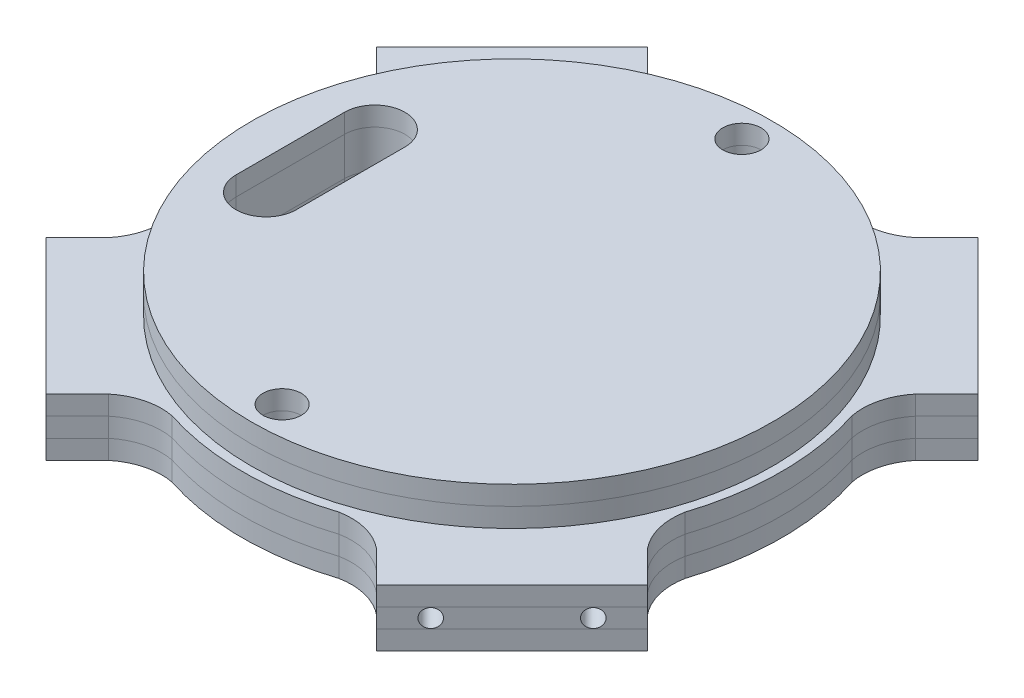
ISO-10303-21;
HEADER;
FILE_DESCRIPTION(('STEP AP214'),'2;1');
FILE_NAME('part.step','',(''),(''),'','','');
FILE_SCHEMA(('AUTOMOTIVE_DESIGN { 1 0 10303 214 1 1 1 1 }'));
ENDSEC;
DATA;
#1=APPLICATION_CONTEXT('core data for automotive mechanical design processes');
#2=APPLICATION_PROTOCOL_DEFINITION('international standard','automotive_design',2000,#1);
#3=PRODUCT_CONTEXT('',#1,'mechanical');
#4=PRODUCT('Part','Part','',(#3));
#5=PRODUCT_RELATED_PRODUCT_CATEGORY('part','',(#4));
#6=PRODUCT_DEFINITION_FORMATION('','',#4);
#7=PRODUCT_DEFINITION_CONTEXT('part definition',#1,'design');
#8=PRODUCT_DEFINITION('design','',#6,#7);
#9=PRODUCT_DEFINITION_SHAPE('','',#8);
#10=(LENGTH_UNIT() NAMED_UNIT(*) SI_UNIT(.MILLI.,.METRE.));
#11=(NAMED_UNIT(*) PLANE_ANGLE_UNIT() SI_UNIT($,.RADIAN.));
#12=(NAMED_UNIT(*) SI_UNIT($,.STERADIAN.) SOLID_ANGLE_UNIT());
#13=UNCERTAINTY_MEASURE_WITH_UNIT(LENGTH_MEASURE(1.E-05),#10,'distance_accuracy_value','');
#14=(GEOMETRIC_REPRESENTATION_CONTEXT(3) GLOBAL_UNCERTAINTY_ASSIGNED_CONTEXT((#13)) GLOBAL_UNIT_ASSIGNED_CONTEXT((#10,
#11,#12)) REPRESENTATION_CONTEXT('',''));
#15=CARTESIAN_POINT('',(0.,0.,0.));
#16=DIRECTION('',(0.,0.,1.));
#17=DIRECTION('',(1.,0.,0.));
#18=AXIS2_PLACEMENT_3D('',#15,#16,#17);
#19=CARTESIAN_POINT('',(0.,-9.525,0.));
#20=DIRECTION('',(0.,-1.,0.));
#21=DIRECTION('',(0.,0.,-1.));
#22=AXIS2_PLACEMENT_3D('',#19,#20,#21);
#23=PLANE('',#22);
#24=CARTESIAN_POINT('',(-31.75,-9.525,-9.));
#25=DIRECTION('',(0.,-1.,0.));
#26=DIRECTION('',(0.,0.,-1.));
#27=AXIS2_PLACEMENT_3D('',#24,#25,#26);
#28=CIRCLE('',#27,4.99999999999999);
#29=CARTESIAN_POINT('',(-36.75,-9.525,-9.));
#30=VERTEX_POINT('',#29);
#31=CARTESIAN_POINT('',(-26.75,-9.525,-9.));
#32=VERTEX_POINT('',#31);
#33=EDGE_CURVE('E71',#30,#32,#28,.T.);
#34=ORIENTED_EDGE('',*,*,#33,.F.);
#35=DIRECTION('',(0.,0.,-1.));
#36=VECTOR('',#35,1.);
#37=CARTESIAN_POINT('',(-36.75,-9.525,-9.));
#38=LINE('',#37,#36);
#39=CARTESIAN_POINT('',(-36.75,-9.525,9.));
#40=VERTEX_POINT('',#39);
#41=EDGE_CURVE('E259',#40,#30,#38,.T.);
#42=ORIENTED_EDGE('',*,*,#41,.F.);
#43=CARTESIAN_POINT('',(-31.75,-9.525,9.));
#44=DIRECTION('',(0.,-1.,0.));
#45=DIRECTION('',(0.,0.,-1.));
#46=AXIS2_PLACEMENT_3D('',#43,#44,#45);
#47=CIRCLE('',#46,4.99999999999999);
#48=CARTESIAN_POINT('',(-26.75,-9.525,9.));
#49=VERTEX_POINT('',#48);
#50=EDGE_CURVE('E244',#49,#40,#47,.T.);
#51=ORIENTED_EDGE('',*,*,#50,.F.);
#52=DIRECTION('',(0.,0.,1.));
#53=VECTOR('',#52,1.);
#54=CARTESIAN_POINT('',(-26.75,-9.525,-9.));
#55=LINE('',#54,#53);
#56=EDGE_CURVE('E253',#32,#49,#55,.T.);
#57=ORIENTED_EDGE('',*,*,#56,.F.);
#58=EDGE_LOOP('',(#34,#42,#51,#57));
#59=FACE_BOUND('',#58,.T.);
#60=DIRECTION('',(0.707106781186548,0.,0.707106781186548));
#61=VECTOR('',#60,1.);
#62=CARTESIAN_POINT('',(50.0461063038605,-9.525,27.5954660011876));
#63=LINE('',#62,#61);
#64=CARTESIAN_POINT('',(44.657952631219,-9.525,22.2073123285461));
#65=VERTEX_POINT('',#64);
#66=CARTESIAN_POINT('',(49.8404214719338,-9.525,27.3897811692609));
#67=VERTEX_POINT('',#66);
#68=EDGE_CURVE('E282',#65,#67,#63,.T.);
#69=ORIENTED_EDGE('',*,*,#68,.T.);
#70=DIRECTION('',(0.707106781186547,0.,-0.707106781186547));
#71=VECTOR('',#70,1.);
#72=CARTESIAN_POINT('',(49.8404214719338,-9.525,27.3897811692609));
#73=LINE('',#72,#71);
#74=CARTESIAN_POINT('',(27.3897811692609,-9.525,49.8404214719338));
#75=VERTEX_POINT('',#74);
#76=EDGE_CURVE('E415',#75,#67,#73,.T.);
#77=ORIENTED_EDGE('',*,*,#76,.F.);
#78=DIRECTION('',(-0.707106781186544,0.,-0.70710678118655));
#79=VECTOR('',#78,1.);
#80=CARTESIAN_POINT('',(27.5954660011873,-9.525,50.0461063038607));
#81=LINE('',#80,#79);
#82=CARTESIAN_POINT('',(22.2073123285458,-9.525,44.6579526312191));
#83=VERTEX_POINT('',#82);
#84=EDGE_CURVE('E273',#75,#83,#81,.T.);
#85=ORIENTED_EDGE('',*,*,#84,.T.);
#86=CARTESIAN_POINT('',(15.738164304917,-9.525,52.4922186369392));
#87=DIRECTION('',(0.,1.,0.));
#88=DIRECTION('',(0.,0.,1.));
#89=AXIS2_PLACEMENT_3D('',#86,#87,#88);
#90=CIRCLE('',#89,10.16);
#91=CARTESIAN_POINT('',(13.8142957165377,-9.525,42.5160305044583));
#92=VERTEX_POINT('',#91);
#93=EDGE_CURVE('E320',#83,#92,#90,.T.);
#94=ORIENTED_EDGE('',*,*,#93,.T.);
#95=CARTESIAN_POINT('',(-8.67361737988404E-13,-9.525,0.));
#96=DIRECTION('',(0.,-1.,0.));
#97=DIRECTION('',(0.,0.,-1.));
#98=AXIS2_PLACEMENT_3D('',#95,#96,#97);
#99=CIRCLE('',#98,44.704);
#100=CARTESIAN_POINT('',(-13.814295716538,-9.525,42.5160305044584));
#101=VERTEX_POINT('',#100);
#102=EDGE_CURVE('E317',#92,#101,#99,.T.);
#103=ORIENTED_EDGE('',*,*,#102,.T.);
#104=CARTESIAN_POINT('',(-15.7381643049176,-9.525,52.492218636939));
#105=DIRECTION('',(0.,1.,0.));
#106=DIRECTION('',(0.,0.,-1.));
#107=AXIS2_PLACEMENT_3D('',#104,#105,#106);
#108=CIRCLE('',#107,10.16);
#109=CARTESIAN_POINT('',(-22.2073123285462,-9.525,44.6579526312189));
#110=VERTEX_POINT('',#109);
#111=EDGE_CURVE('E314',#101,#110,#108,.T.);
#112=ORIENTED_EDGE('',*,*,#111,.T.);
#113=DIRECTION('',(-0.707106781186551,0.,0.707106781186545));
#114=VECTOR('',#113,1.);
#115=CARTESIAN_POINT('',(-27.5954660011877,-9.525,50.0461063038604));
#116=LINE('',#115,#114);
#117=CARTESIAN_POINT('',(-27.3897811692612,-9.525,49.8404214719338));
#118=VERTEX_POINT('',#117);
#119=EDGE_CURVE('E301',#110,#118,#116,.T.);
#120=ORIENTED_EDGE('',*,*,#119,.T.);
#121=DIRECTION('',(0.70710678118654,0.,0.707106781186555));
#122=VECTOR('',#121,1.);
#123=CARTESIAN_POINT('',(-27.3897811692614,-9.525,49.8404214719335));
#124=LINE('',#123,#122);
#125=CARTESIAN_POINT('',(-49.8404214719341,-9.525,27.3897811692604));
#126=VERTEX_POINT('',#125);
#127=EDGE_CURVE('E400',#126,#118,#124,.T.);
#128=ORIENTED_EDGE('',*,*,#127,.F.);
#129=DIRECTION('',(0.707106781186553,0.,-0.707106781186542));
#130=VECTOR('',#129,1.);
#131=CARTESIAN_POINT('',(-50.0461063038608,-9.525,27.5954660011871));
#132=LINE('',#131,#130);
#133=CARTESIAN_POINT('',(-44.6579526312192,-9.525,22.2073123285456));
#134=VERTEX_POINT('',#133);
#135=EDGE_CURVE('E311',#126,#134,#132,.T.);
#136=ORIENTED_EDGE('',*,*,#135,.T.);
#137=CARTESIAN_POINT('',(-52.4922186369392,-9.525,15.7381643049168));
#138=DIRECTION('',(0.,1.,0.));
#139=DIRECTION('',(0.,0.,1.));
#140=AXIS2_PLACEMENT_3D('',#137,#138,#139);
#141=CIRCLE('',#140,10.16);
#142=CARTESIAN_POINT('',(-42.5160305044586,-9.525,13.8142957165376));
#143=VERTEX_POINT('',#142);
#144=EDGE_CURVE('E347',#134,#143,#141,.T.);
#145=ORIENTED_EDGE('',*,*,#144,.T.);
#146=CARTESIAN_POINT('',(-8.67361737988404E-13,-9.525,0.));
#147=DIRECTION('',(0.,-1.,0.));
#148=DIRECTION('',(0.,0.,-1.));
#149=AXIS2_PLACEMENT_3D('',#146,#147,#148);
#150=CIRCLE('',#149,44.7039999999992);
#151=CARTESIAN_POINT('',(-42.5160305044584,-9.525,-13.8142957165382));
#152=VERTEX_POINT('',#151);
#153=EDGE_CURVE('E344',#143,#152,#150,.T.);
#154=ORIENTED_EDGE('',*,*,#153,.T.);
#155=CARTESIAN_POINT('',(-52.492218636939,-9.525,-15.7381643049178));
#156=DIRECTION('',(0.,1.,0.));
#157=DIRECTION('',(0.,0.,-1.));
#158=AXIS2_PLACEMENT_3D('',#155,#156,#157);
#159=CIRCLE('',#158,10.16);
#160=CARTESIAN_POINT('',(-44.6579526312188,-9.525,-22.2073123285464));
#161=VERTEX_POINT('',#160);
#162=EDGE_CURVE('E341',#152,#161,#159,.T.);
#163=ORIENTED_EDGE('',*,*,#162,.T.);
#164=DIRECTION('',(-0.707106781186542,0.,-0.707106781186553));
#165=VECTOR('',#164,1.);
#166=CARTESIAN_POINT('',(-50.0461063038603,-9.525,-27.5954660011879));
#167=LINE('',#166,#165);
#168=CARTESIAN_POINT('',(-49.8404214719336,-9.525,-27.3897811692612));
#169=VERTEX_POINT('',#168);
#170=EDGE_CURVE('E328',#161,#169,#167,.T.);
#171=ORIENTED_EDGE('',*,*,#170,.T.);
#172=DIRECTION('',(-0.707106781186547,0.,0.707106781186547));
#173=VECTOR('',#172,1.);
#174=CARTESIAN_POINT('',(-49.8404214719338,-9.525,-27.3897811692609));
#175=LINE('',#174,#173);
#176=CARTESIAN_POINT('',(-27.3897811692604,-9.525,-49.8404214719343));
#177=VERTEX_POINT('',#176);
#178=EDGE_CURVE('E442',#177,#169,#175,.T.);
#179=ORIENTED_EDGE('',*,*,#178,.F.);
#180=DIRECTION('',(0.70710678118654,0.,0.707106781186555));
#181=VECTOR('',#180,1.);
#182=CARTESIAN_POINT('',(-27.5954660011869,-9.525,-50.0461063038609));
#183=LINE('',#182,#181);
#184=CARTESIAN_POINT('',(-22.2073123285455,-9.525,-44.6579526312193));
#185=VERTEX_POINT('',#184);
#186=EDGE_CURVE('E338',#177,#185,#183,.T.);
#187=ORIENTED_EDGE('',*,*,#186,.T.);
#188=CARTESIAN_POINT('',(-15.7381643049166,-9.525,-52.4922186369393));
#189=DIRECTION('',(0.,1.,0.));
#190=DIRECTION('',(0.,0.,1.));
#191=AXIS2_PLACEMENT_3D('',#188,#189,#190);
#192=CIRCLE('',#191,10.16);
#193=CARTESIAN_POINT('',(-13.8142957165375,-9.525,-42.5160305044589));
#194=VERTEX_POINT('',#193);
#195=EDGE_CURVE('E372',#185,#194,#192,.T.);
#196=ORIENTED_EDGE('',*,*,#195,.T.);
#197=CARTESIAN_POINT('',(-8.67361737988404E-13,-9.525,0.));
#198=DIRECTION('',(0.,-1.,0.));
#199=DIRECTION('',(0.,0.,-1.));
#200=AXIS2_PLACEMENT_3D('',#197,#198,#199);
#201=CIRCLE('',#200,44.704);
#202=CARTESIAN_POINT('',(13.8142957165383,-9.525,-42.5160305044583));
#203=VERTEX_POINT('',#202);
#204=EDGE_CURVE('E369',#194,#203,#201,.T.);
#205=ORIENTED_EDGE('',*,*,#204,.T.);
#206=CARTESIAN_POINT('',(15.738164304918,-9.525,-52.4922186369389));
#207=DIRECTION('',(0.,1.,0.));
#208=DIRECTION('',(0.,0.,-1.));
#209=AXIS2_PLACEMENT_3D('',#206,#207,#208);
#210=CIRCLE('',#209,10.16);
#211=CARTESIAN_POINT('',(22.2073123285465,-9.525,-44.6579526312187));
#212=VERTEX_POINT('',#211);
#213=EDGE_CURVE('E366',#203,#212,#210,.T.);
#214=ORIENTED_EDGE('',*,*,#213,.T.);
#215=DIRECTION('',(0.707106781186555,0.,-0.70710678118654));
#216=VECTOR('',#215,1.);
#217=CARTESIAN_POINT('',(27.5954660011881,-9.525,-50.0461063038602));
#218=LINE('',#217,#216);
#219=CARTESIAN_POINT('',(27.3897811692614,-9.525,-49.8404214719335));
#220=VERTEX_POINT('',#219);
#221=EDGE_CURVE('E355',#212,#220,#218,.T.);
#222=ORIENTED_EDGE('',*,*,#221,.T.);
#223=DIRECTION('',(-0.707106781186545,0.,-0.70710678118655));
#224=VECTOR('',#223,1.);
#225=CARTESIAN_POINT('',(27.3897811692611,-9.525,-49.8404214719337));
#226=LINE('',#225,#224);
#227=CARTESIAN_POINT('',(49.8404214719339,-9.525,-27.3897811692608));
#228=VERTEX_POINT('',#227);
#229=EDGE_CURVE('E401',#228,#220,#226,.T.);
#230=ORIENTED_EDGE('',*,*,#229,.F.);
#231=DIRECTION('',(-0.707106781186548,0.,0.707106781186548));
#232=VECTOR('',#231,1.);
#233=CARTESIAN_POINT('',(50.0461063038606,-9.525,-27.5954660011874));
#234=LINE('',#233,#232);
#235=CARTESIAN_POINT('',(44.6579526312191,-9.525,-22.2073123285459));
#236=VERTEX_POINT('',#235);
#237=EDGE_CURVE('E269',#228,#236,#234,.T.);
#238=ORIENTED_EDGE('',*,*,#237,.T.);
#239=CARTESIAN_POINT('',(52.4922186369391,-9.525,-15.7381643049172));
#240=DIRECTION('',(0.,1.,0.));
#241=DIRECTION('',(0.,0.,1.));
#242=AXIS2_PLACEMENT_3D('',#239,#240,#241);
#243=CIRCLE('',#242,10.16);
#244=CARTESIAN_POINT('',(42.5160305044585,-9.525,-13.8142957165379));
#245=VERTEX_POINT('',#244);
#246=EDGE_CURVE('E272',#236,#245,#243,.T.);
#247=ORIENTED_EDGE('',*,*,#246,.T.);
#248=CARTESIAN_POINT('',(-8.67361737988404E-13,-9.525,0.));
#249=DIRECTION('',(0.,-1.,0.));
#250=DIRECTION('',(0.,0.,-1.));
#251=AXIS2_PLACEMENT_3D('',#248,#249,#250);
#252=CIRCLE('',#251,44.7040000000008);
#253=CARTESIAN_POINT('',(42.5160305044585,-9.525,13.8142957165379));
#254=VERTEX_POINT('',#253);
#255=EDGE_CURVE('E276',#245,#254,#252,.T.);
#256=ORIENTED_EDGE('',*,*,#255,.T.);
#257=CARTESIAN_POINT('',(52.4922186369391,-9.525,15.7381643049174));
#258=DIRECTION('',(0.,1.,0.));
#259=DIRECTION('',(0.,0.,-1.));
#260=AXIS2_PLACEMENT_3D('',#257,#258,#259);
#261=CIRCLE('',#260,10.16);
#262=EDGE_CURVE('E279',#254,#65,#261,.T.);
#263=ORIENTED_EDGE('',*,*,#262,.T.);
#264=EDGE_LOOP('',(#69,#77,#85,#94,#103,#112,#120,#128,#136,#145,#154,#163,#171,#179,#187,#196,
#205,#214,#222,#230,#238,#247,#256,#263));
#265=FACE_BOUND('',#264,.T.);
#266=CARTESIAN_POINT('',(0.,-9.525,38.1));
#267=DIRECTION('',(0.,-1.,0.));
#268=DIRECTION('',(0.,0.,-1.));
#269=AXIS2_PLACEMENT_3D('',#266,#267,#268);
#270=CIRCLE('',#269,3.175);
#271=CARTESIAN_POINT('',(0.,-9.525,34.925));
#272=VERTEX_POINT('',#271);
#273=EDGE_CURVE('E445',#272,#272,#270,.T.);
#274=ORIENTED_EDGE('',*,*,#273,.F.);
#275=EDGE_LOOP('',(#274));
#276=FACE_BOUND('',#275,.T.);
#277=CARTESIAN_POINT('',(0.,-9.525,-38.1));
#278=DIRECTION('',(0.,1.,0.));
#279=DIRECTION('',(0.,0.,1.));
#280=AXIS2_PLACEMENT_3D('',#277,#278,#279);
#281=CIRCLE('',#280,3.175);
#282=CARTESIAN_POINT('',(0.,-9.525,-34.925));
#283=VERTEX_POINT('',#282);
#284=EDGE_CURVE('E451',#283,#283,#281,.T.);
#285=ORIENTED_EDGE('',*,*,#284,.T.);
#286=EDGE_LOOP('',(#285));
#287=FACE_BOUND('',#286,.T.);
#288=ADVANCED_FACE('F56',(#59,#265,#276,#287),#23,.T.);
#289=CARTESIAN_POINT('',(0.,-6.35,0.));
#290=DIRECTION('',(0.,-1.,0.));
#291=DIRECTION('',(0.,0.,-1.));
#292=AXIS2_PLACEMENT_3D('',#289,#290,#291);
#293=PLANE('',#292);
#294=DIRECTION('',(0.,0.,-1.));
#295=VECTOR('',#294,1.);
#296=CARTESIAN_POINT('',(-36.75,-6.35,0.));
#297=LINE('',#296,#295);
#298=CARTESIAN_POINT('',(-36.75,-6.35,9.));
#299=VERTEX_POINT('',#298);
#300=CARTESIAN_POINT('',(-36.75,-6.35,-9.));
#301=VERTEX_POINT('',#300);
#302=EDGE_CURVE('E64',#299,#301,#297,.T.);
#303=ORIENTED_EDGE('',*,*,#302,.T.);
#304=CARTESIAN_POINT('',(-31.75,-6.35,-9.));
#305=DIRECTION('',(0.,-1.,0.));
#306=DIRECTION('',(0.,0.,-1.));
#307=AXIS2_PLACEMENT_3D('',#304,#305,#306);
#308=CIRCLE('',#307,4.99999999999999);
#309=CARTESIAN_POINT('',(-26.75,-6.35,-9.));
#310=VERTEX_POINT('',#309);
#311=EDGE_CURVE('E12',#301,#310,#308,.T.);
#312=ORIENTED_EDGE('',*,*,#311,.T.);
#313=DIRECTION('',(0.,0.,1.));
#314=VECTOR('',#313,1.);
#315=CARTESIAN_POINT('',(-26.75,-6.35,0.));
#316=LINE('',#315,#314);
#317=CARTESIAN_POINT('',(-26.75,-6.35,9.));
#318=VERTEX_POINT('',#317);
#319=EDGE_CURVE('E496',#310,#318,#316,.T.);
#320=ORIENTED_EDGE('',*,*,#319,.T.);
#321=CARTESIAN_POINT('',(-31.75,-6.35,9.));
#322=DIRECTION('',(0.,-1.,0.));
#323=DIRECTION('',(0.,0.,-1.));
#324=AXIS2_PLACEMENT_3D('',#321,#322,#323);
#325=CIRCLE('',#324,4.99999999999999);
#326=EDGE_CURVE('E247',#318,#299,#325,.T.);
#327=ORIENTED_EDGE('',*,*,#326,.T.);
#328=EDGE_LOOP('',(#303,#312,#320,#327));
#329=FACE_BOUND('',#328,.T.);
#330=DIRECTION('',(0.707106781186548,0.,-0.707106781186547));
#331=VECTOR('',#330,1.);
#332=CARTESIAN_POINT('',(38.6151013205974,-6.35,38.6151013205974));
#333=LINE('',#332,#331);
#334=CARTESIAN_POINT('',(27.3897811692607,-6.35,49.8404214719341));
#335=VERTEX_POINT('',#334);
#336=CARTESIAN_POINT('',(49.8404214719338,-6.35,27.3897811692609));
#337=VERTEX_POINT('',#336);
#338=EDGE_CURVE('E405',#335,#337,#333,.T.);
#339=ORIENTED_EDGE('',*,*,#338,.T.);
#340=DIRECTION('',(-0.707106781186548,0.,-0.707106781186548));
#341=VECTOR('',#340,1.);
#342=CARTESIAN_POINT('',(11.2253201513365,-6.35,-11.2253201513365));
#343=LINE('',#342,#341);
#344=CARTESIAN_POINT('',(44.657952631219,-6.35,22.2073123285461));
#345=VERTEX_POINT('',#344);
#346=EDGE_CURVE('E385',#337,#345,#343,.T.);
#347=ORIENTED_EDGE('',*,*,#346,.T.);
#348=CARTESIAN_POINT('',(52.4922186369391,-6.35,15.7381643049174));
#349=DIRECTION('',(0.,-1.,0.));
#350=DIRECTION('',(0.,0.,-1.));
#351=AXIS2_PLACEMENT_3D('',#348,#349,#350);
#352=CIRCLE('',#351,10.16);
#353=CARTESIAN_POINT('',(42.5160305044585,-6.35,13.8142957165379));
#354=VERTEX_POINT('',#353);
#355=EDGE_CURVE('E493',#345,#354,#352,.T.);
#356=ORIENTED_EDGE('',*,*,#355,.T.);
#357=CARTESIAN_POINT('',(-8.67361737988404E-13,-6.35,0.));
#358=DIRECTION('',(0.,-1.,0.));
#359=DIRECTION('',(0.,0.,-1.));
#360=AXIS2_PLACEMENT_3D('',#357,#358,#359);
#361=CIRCLE('',#360,44.7040000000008);
#362=CARTESIAN_POINT('',(42.5160305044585,-6.35,-13.8142957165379));
#363=VERTEX_POINT('',#362);
#364=EDGE_CURVE('E490',#354,#363,#361,.F.);
#365=ORIENTED_EDGE('',*,*,#364,.T.);
#366=CARTESIAN_POINT('',(52.4922186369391,-6.35,-15.7381643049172));
#367=DIRECTION('',(0.,-1.,0.));
#368=DIRECTION('',(0.,0.,-1.));
#369=AXIS2_PLACEMENT_3D('',#366,#367,#368);
#370=CIRCLE('',#369,10.16);
#371=CARTESIAN_POINT('',(44.6579526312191,-6.35,-22.2073123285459));
#372=VERTEX_POINT('',#371);
#373=EDGE_CURVE('E487',#363,#372,#370,.T.);
#374=ORIENTED_EDGE('',*,*,#373,.T.);
#375=DIRECTION('',(0.707106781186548,0.,-0.707106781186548));
#376=VECTOR('',#375,1.);
#377=CARTESIAN_POINT('',(11.2253201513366,-6.35,11.2253201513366));
#378=LINE('',#377,#376);
#379=CARTESIAN_POINT('',(49.8404214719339,-6.35,-27.3897811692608));
#380=VERTEX_POINT('',#379);
#381=EDGE_CURVE('E379',#372,#380,#378,.T.);
#382=ORIENTED_EDGE('',*,*,#381,.T.);
#383=DIRECTION('',(-0.707106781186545,0.,-0.70710678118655));
#384=VECTOR('',#383,1.);
#385=CARTESIAN_POINT('',(38.6151013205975,-6.35,-38.6151013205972));
#386=LINE('',#385,#384);
#387=CARTESIAN_POINT('',(27.3897811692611,-6.35,-49.8404214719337));
#388=VERTEX_POINT('',#387);
#389=EDGE_CURVE('E411',#380,#388,#386,.T.);
#390=ORIENTED_EDGE('',*,*,#389,.T.);
#391=DIRECTION('',(-0.707106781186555,0.,0.70710678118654));
#392=VECTOR('',#391,1.);
#393=CARTESIAN_POINT('',(-11.2253201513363,-6.35,-11.2253201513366));
#394=LINE('',#393,#392);
#395=CARTESIAN_POINT('',(22.2073123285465,-6.35,-44.6579526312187));
#396=VERTEX_POINT('',#395);
#397=EDGE_CURVE('E289',#388,#396,#394,.T.);
#398=ORIENTED_EDGE('',*,*,#397,.T.);
#399=CARTESIAN_POINT('',(15.738164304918,-6.35,-52.4922186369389));
#400=DIRECTION('',(0.,-1.,0.));
#401=DIRECTION('',(0.,0.,-1.));
#402=AXIS2_PLACEMENT_3D('',#399,#400,#401);
#403=CIRCLE('',#402,10.16);
#404=CARTESIAN_POINT('',(13.8142957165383,-6.35,-42.5160305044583));
#405=VERTEX_POINT('',#404);
#406=EDGE_CURVE('E466',#396,#405,#403,.T.);
#407=ORIENTED_EDGE('',*,*,#406,.T.);
#408=CARTESIAN_POINT('',(-8.67361737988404E-13,-6.35,0.));
#409=DIRECTION('',(0.,-1.,0.));
#410=DIRECTION('',(0.,0.,-1.));
#411=AXIS2_PLACEMENT_3D('',#408,#409,#410);
#412=CIRCLE('',#411,44.704);
#413=CARTESIAN_POINT('',(-13.8142957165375,-6.35,-42.5160305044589));
#414=VERTEX_POINT('',#413);
#415=EDGE_CURVE('E463',#405,#414,#412,.F.);
#416=ORIENTED_EDGE('',*,*,#415,.T.);
#417=CARTESIAN_POINT('',(-15.7381643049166,-6.35,-52.4922186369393));
#418=DIRECTION('',(0.,-1.,0.));
#419=DIRECTION('',(0.,0.,-1.));
#420=AXIS2_PLACEMENT_3D('',#417,#418,#419);
#421=CIRCLE('',#420,10.16);
#422=CARTESIAN_POINT('',(-22.2073123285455,-6.35,-44.6579526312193));
#423=VERTEX_POINT('',#422);
#424=EDGE_CURVE('E460',#414,#423,#421,.T.);
#425=ORIENTED_EDGE('',*,*,#424,.T.);
#426=DIRECTION('',(-0.70710678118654,0.,-0.707106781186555));
#427=VECTOR('',#426,1.);
#428=CARTESIAN_POINT('',(11.2253201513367,-6.35,-11.2253201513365));
#429=LINE('',#428,#427);
#430=CARTESIAN_POINT('',(-27.3897811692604,-6.35,-49.8404214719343));
#431=VERTEX_POINT('',#430);
#432=EDGE_CURVE('E394',#423,#431,#429,.T.);
#433=ORIENTED_EDGE('',*,*,#432,.T.);
#434=DIRECTION('',(-0.707106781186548,0.,0.707106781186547));
#435=VECTOR('',#434,1.);
#436=CARTESIAN_POINT('',(-38.6151013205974,-6.35,-38.6151013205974));
#437=LINE('',#436,#435);
#438=CARTESIAN_POINT('',(-49.8404214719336,-6.35,-27.3897811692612));
#439=VERTEX_POINT('',#438);
#440=EDGE_CURVE('E457',#431,#439,#437,.T.);
#441=ORIENTED_EDGE('',*,*,#440,.T.);
#442=DIRECTION('',(0.707106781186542,0.,0.707106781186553));
#443=VECTOR('',#442,1.);
#444=CARTESIAN_POINT('',(-11.2253201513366,-6.35,11.2253201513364));
#445=LINE('',#444,#443);
#446=CARTESIAN_POINT('',(-44.6579526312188,-6.35,-22.2073123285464));
#447=VERTEX_POINT('',#446);
#448=EDGE_CURVE('E397',#439,#447,#445,.T.);
#449=ORIENTED_EDGE('',*,*,#448,.T.);
#450=CARTESIAN_POINT('',(-52.492218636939,-6.35,-15.7381643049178));
#451=DIRECTION('',(0.,-1.,0.));
#452=DIRECTION('',(0.,0.,-1.));
#453=AXIS2_PLACEMENT_3D('',#450,#451,#452);
#454=CIRCLE('',#453,10.16);
#455=CARTESIAN_POINT('',(-42.5160305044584,-6.35,-13.8142957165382));
#456=VERTEX_POINT('',#455);
#457=EDGE_CURVE('E475',#447,#456,#454,.T.);
#458=ORIENTED_EDGE('',*,*,#457,.T.);
#459=CARTESIAN_POINT('',(-8.67361737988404E-13,-6.35,0.));
#460=DIRECTION('',(0.,-1.,0.));
#461=DIRECTION('',(0.,0.,-1.));
#462=AXIS2_PLACEMENT_3D('',#459,#460,#461);
#463=CIRCLE('',#462,44.7039999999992);
#464=CARTESIAN_POINT('',(-42.5160305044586,-6.35,13.8142957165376));
#465=VERTEX_POINT('',#464);
#466=EDGE_CURVE('E472',#456,#465,#463,.F.);
#467=ORIENTED_EDGE('',*,*,#466,.T.);
#468=CARTESIAN_POINT('',(-52.4922186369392,-6.35,15.7381643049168));
#469=DIRECTION('',(0.,-1.,0.));
#470=DIRECTION('',(0.,0.,-1.));
#471=AXIS2_PLACEMENT_3D('',#468,#469,#470);
#472=CIRCLE('',#471,10.16);
#473=CARTESIAN_POINT('',(-44.6579526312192,-6.35,22.2073123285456));
#474=VERTEX_POINT('',#473);
#475=EDGE_CURVE('E469',#465,#474,#472,.T.);
#476=ORIENTED_EDGE('',*,*,#475,.T.);
#477=DIRECTION('',(-0.707106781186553,0.,0.707106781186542));
#478=VECTOR('',#477,1.);
#479=CARTESIAN_POINT('',(-11.2253201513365,-6.35,-11.2253201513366));
#480=LINE('',#479,#478);
#481=CARTESIAN_POINT('',(-49.8404214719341,-6.35,27.3897811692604));
#482=VERTEX_POINT('',#481);
#483=EDGE_CURVE('E388',#474,#482,#480,.T.);
#484=ORIENTED_EDGE('',*,*,#483,.T.);
#485=DIRECTION('',(0.70710678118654,0.,0.707106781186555));
#486=VECTOR('',#485,1.);
#487=CARTESIAN_POINT('',(-38.6151013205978,-6.35,38.615101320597));
#488=LINE('',#487,#486);
#489=CARTESIAN_POINT('',(-27.3897811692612,-6.35,49.8404214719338));
#490=VERTEX_POINT('',#489);
#491=EDGE_CURVE('E419',#482,#490,#488,.T.);
#492=ORIENTED_EDGE('',*,*,#491,.T.);
#493=DIRECTION('',(0.70710678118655,0.,-0.707106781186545));
#494=VECTOR('',#493,1.);
#495=CARTESIAN_POINT('',(11.2253201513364,-6.35,11.2253201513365));
#496=LINE('',#495,#494);
#497=CARTESIAN_POINT('',(-22.2073123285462,-6.35,44.6579526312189));
#498=VERTEX_POINT('',#497);
#499=EDGE_CURVE('E391',#490,#498,#496,.T.);
#500=ORIENTED_EDGE('',*,*,#499,.T.);
#501=CARTESIAN_POINT('',(-15.7381643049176,-6.35,52.492218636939));
#502=DIRECTION('',(0.,-1.,0.));
#503=DIRECTION('',(0.,0.,-1.));
#504=AXIS2_PLACEMENT_3D('',#501,#502,#503);
#505=CIRCLE('',#504,10.16);
#506=CARTESIAN_POINT('',(-13.814295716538,-6.35,42.5160305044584));
#507=VERTEX_POINT('',#506);
#508=EDGE_CURVE('E484',#498,#507,#505,.T.);
#509=ORIENTED_EDGE('',*,*,#508,.T.);
#510=CARTESIAN_POINT('',(-8.67361737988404E-13,-6.35,0.));
#511=DIRECTION('',(0.,-1.,0.));
#512=DIRECTION('',(0.,0.,-1.));
#513=AXIS2_PLACEMENT_3D('',#510,#511,#512);
#514=CIRCLE('',#513,44.704);
#515=CARTESIAN_POINT('',(13.8142957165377,-6.35,42.5160305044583));
#516=VERTEX_POINT('',#515);
#517=EDGE_CURVE('E481',#507,#516,#514,.F.);
#518=ORIENTED_EDGE('',*,*,#517,.T.);
#519=CARTESIAN_POINT('',(15.738164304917,-6.35,52.4922186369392));
#520=DIRECTION('',(0.,-1.,0.));
#521=DIRECTION('',(0.,0.,-1.));
#522=AXIS2_PLACEMENT_3D('',#519,#520,#521);
#523=CIRCLE('',#522,10.16);
#524=CARTESIAN_POINT('',(22.2073123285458,-6.35,44.6579526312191));
#525=VERTEX_POINT('',#524);
#526=EDGE_CURVE('E478',#516,#525,#523,.T.);
#527=ORIENTED_EDGE('',*,*,#526,.T.);
#528=DIRECTION('',(0.707106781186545,0.,0.70710678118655));
#529=VECTOR('',#528,1.);
#530=CARTESIAN_POINT('',(-11.2253201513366,-6.35,11.2253201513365));
#531=LINE('',#530,#529);
#532=EDGE_CURVE('E382',#525,#335,#531,.T.);
#533=ORIENTED_EDGE('',*,*,#532,.T.);
#534=EDGE_LOOP('',(#339,#347,#356,#365,#374,#382,#390,#398,#407,#416,#425,#433,#441,#449,#458,
#467,#476,#484,#492,#500,#509,#518,#527,#533));
#535=FACE_BOUND('',#534,.T.);
#536=CARTESIAN_POINT('',(0.,-6.35,38.1));
#537=DIRECTION('',(0.,1.,0.));
#538=DIRECTION('',(0.,0.,1.));
#539=AXIS2_PLACEMENT_3D('',#536,#537,#538);
#540=CIRCLE('',#539,3.175);
#541=CARTESIAN_POINT('',(0.,-6.35,41.275));
#542=VERTEX_POINT('',#541);
#543=EDGE_CURVE('E448',#542,#542,#540,.T.);
#544=ORIENTED_EDGE('',*,*,#543,.F.);
#545=EDGE_LOOP('',(#544));
#546=FACE_BOUND('',#545,.T.);
#547=CARTESIAN_POINT('',(0.,-6.35,-38.1));
#548=DIRECTION('',(0.,-1.,0.));
#549=DIRECTION('',(0.,0.,-1.));
#550=AXIS2_PLACEMENT_3D('',#547,#548,#549);
#551=CIRCLE('',#550,3.175);
#552=CARTESIAN_POINT('',(0.,-6.35,-41.275));
#553=VERTEX_POINT('',#552);
#554=EDGE_CURVE('E454',#553,#553,#551,.T.);
#555=ORIENTED_EDGE('',*,*,#554,.T.);
#556=EDGE_LOOP('',(#555));
#557=FACE_BOUND('',#556,.T.);
#558=ADVANCED_FACE('F58',(#329,#535,#546,#557),#293,.F.);
#559=CARTESIAN_POINT('',(0.,-9.525,-38.1));
#560=DIRECTION('',(0.,1.,0.));
#561=DIRECTION('',(0.,0.,1.));
#562=AXIS2_PLACEMENT_3D('',#559,#560,#561);
#563=CYLINDRICAL_SURFACE('',#562,3.175);
#564=ORIENTED_EDGE('',*,*,#284,.F.);
#565=EDGE_LOOP('',(#564));
#566=FACE_BOUND('',#565,.T.);
#567=ORIENTED_EDGE('',*,*,#554,.F.);
#568=EDGE_LOOP('',(#567));
#569=FACE_BOUND('',#568,.T.);
#570=ADVANCED_FACE('F522',(#566,#569),#563,.F.);
#571=CARTESIAN_POINT('',(0.,-9.525,38.1));
#572=DIRECTION('',(0.,1.,0.));
#573=DIRECTION('',(0.,0.,-1.));
#574=AXIS2_PLACEMENT_3D('',#571,#572,#573);
#575=CYLINDRICAL_SURFACE('',#574,3.175);
#576=ORIENTED_EDGE('',*,*,#273,.T.);
#577=EDGE_LOOP('',(#576));
#578=FACE_BOUND('',#577,.T.);
#579=ORIENTED_EDGE('',*,*,#543,.T.);
#580=EDGE_LOOP('',(#579));
#581=FACE_BOUND('',#580,.T.);
#582=ADVANCED_FACE('F526',(#578,#581),#575,.F.);
#583=CARTESIAN_POINT('',(-38.6151013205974,0.,-38.6151013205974));
#584=DIRECTION('',(0.707106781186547,0.,0.707106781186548));
#585=DIRECTION('',(0.707106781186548,0.,-0.707106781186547));
#586=AXIS2_PLACEMENT_3D('',#583,#584,#585);
#587=PLANE('',#586);
#588=DIRECTION('',(0.,-1.,0.));
#589=VECTOR('',#588,1.);
#590=CARTESIAN_POINT('',(-27.3897811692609,-9.525,-49.8404214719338));
#591=LINE('',#590,#589);
#592=EDGE_CURVE('E439',#431,#177,#591,.T.);
#593=ORIENTED_EDGE('',*,*,#592,.T.);
#594=ORIENTED_EDGE('',*,*,#178,.T.);
#595=DIRECTION('',(0.,1.,0.));
#596=VECTOR('',#595,1.);
#597=CARTESIAN_POINT('',(-49.8404214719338,0.,-27.3897811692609));
#598=LINE('',#597,#596);
#599=EDGE_CURVE('E414',#169,#439,#598,.T.);
#600=ORIENTED_EDGE('',*,*,#599,.T.);
#601=ORIENTED_EDGE('',*,*,#440,.F.);
#602=EDGE_LOOP('',(#593,#594,#600,#601));
#603=FACE_BOUND('',#602,.T.);
#604=ADVANCED_FACE('F530',(#603),#587,.F.);
#605=CARTESIAN_POINT('',(-38.6151013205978,0.,38.615101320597));
#606=DIRECTION('',(0.707106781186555,0.,-0.70710678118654));
#607=DIRECTION('',(-0.70710678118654,0.,-0.707106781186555));
#608=AXIS2_PLACEMENT_3D('',#605,#606,#607);
#609=PLANE('',#608);
#610=DIRECTION('',(0.,-1.,0.));
#611=VECTOR('',#610,1.);
#612=CARTESIAN_POINT('',(-49.8404214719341,-9.525,27.3897811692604));
#613=LINE('',#612,#611);
#614=EDGE_CURVE('E429',#482,#126,#613,.T.);
#615=ORIENTED_EDGE('',*,*,#614,.T.);
#616=ORIENTED_EDGE('',*,*,#127,.T.);
#617=DIRECTION('',(0.,1.,0.));
#618=VECTOR('',#617,1.);
#619=CARTESIAN_POINT('',(-27.3897811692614,0.,49.8404214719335));
#620=LINE('',#619,#618);
#621=EDGE_CURVE('E432',#118,#490,#620,.T.);
#622=ORIENTED_EDGE('',*,*,#621,.T.);
#623=ORIENTED_EDGE('',*,*,#491,.F.);
#624=EDGE_LOOP('',(#615,#616,#622,#623));
#625=FACE_BOUND('',#624,.T.);
#626=ADVANCED_FACE('F534',(#625),#609,.F.);
#627=CARTESIAN_POINT('',(38.6151013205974,0.,38.6151013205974));
#628=DIRECTION('',(-0.707106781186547,0.,-0.707106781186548));
#629=DIRECTION('',(-0.707106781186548,0.,0.707106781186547));
#630=AXIS2_PLACEMENT_3D('',#627,#628,#629);
#631=PLANE('',#630);
#632=DIRECTION('',(0.,-1.,0.));
#633=VECTOR('',#632,1.);
#634=CARTESIAN_POINT('',(27.3897811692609,-9.525,49.8404214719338));
#635=LINE('',#634,#633);
#636=EDGE_CURVE('E418',#335,#75,#635,.T.);
#637=ORIENTED_EDGE('',*,*,#636,.T.);
#638=ORIENTED_EDGE('',*,*,#76,.T.);
#639=DIRECTION('',(0.,1.,0.));
#640=VECTOR('',#639,1.);
#641=CARTESIAN_POINT('',(49.8404214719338,0.,27.3897811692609));
#642=LINE('',#641,#640);
#643=EDGE_CURVE('E422',#67,#337,#642,.T.);
#644=ORIENTED_EDGE('',*,*,#643,.T.);
#645=ORIENTED_EDGE('',*,*,#338,.F.);
#646=EDGE_LOOP('',(#637,#638,#644,#645));
#647=FACE_BOUND('',#646,.T.);
#648=ADVANCED_FACE('F538',(#647),#631,.F.);
#649=CARTESIAN_POINT('',(38.6151013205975,0.,-38.6151013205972));
#650=DIRECTION('',(-0.70710678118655,0.,0.707106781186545));
#651=DIRECTION('',(0.707106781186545,0.,0.70710678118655));
#652=AXIS2_PLACEMENT_3D('',#649,#650,#651);
#653=PLANE('',#652);
#654=DIRECTION('',(0.,-1.,0.));
#655=VECTOR('',#654,1.);
#656=CARTESIAN_POINT('',(49.8404214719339,-9.525,-27.3897811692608));
#657=LINE('',#656,#655);
#658=EDGE_CURVE('E404',#380,#228,#657,.T.);
#659=ORIENTED_EDGE('',*,*,#658,.T.);
#660=ORIENTED_EDGE('',*,*,#229,.T.);
#661=DIRECTION('',(0.,1.,0.));
#662=VECTOR('',#661,1.);
#663=CARTESIAN_POINT('',(27.3897811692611,0.,-49.8404214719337));
#664=LINE('',#663,#662);
#665=EDGE_CURVE('E408',#220,#388,#664,.T.);
#666=ORIENTED_EDGE('',*,*,#665,.T.);
#667=ORIENTED_EDGE('',*,*,#389,.F.);
#668=EDGE_LOOP('',(#659,#660,#666,#667));
#669=FACE_BOUND('',#668,.T.);
#670=ADVANCED_FACE('F542',(#669),#653,.F.);
#671=CARTESIAN_POINT('',(15.738164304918,-9.525,-52.4922186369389));
#672=DIRECTION('',(0.,1.,0.));
#673=DIRECTION('',(0.,0.,1.));
#674=AXIS2_PLACEMENT_3D('',#671,#672,#673);
#675=CYLINDRICAL_SURFACE('',#674,10.16);
#676=DIRECTION('',(0.,1.,0.));
#677=VECTOR('',#676,1.);
#678=CARTESIAN_POINT('',(22.2073123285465,-9.525,-44.6579526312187));
#679=LINE('',#678,#677);
#680=EDGE_CURVE('E266',#212,#396,#679,.T.);
#681=ORIENTED_EDGE('',*,*,#680,.F.);
#682=ORIENTED_EDGE('',*,*,#213,.F.);
#683=DIRECTION('',(0.,1.,0.));
#684=VECTOR('',#683,1.);
#685=CARTESIAN_POINT('',(13.8142957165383,-9.525,-42.5160305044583));
#686=LINE('',#685,#684);
#687=EDGE_CURVE('E359',#203,#405,#686,.T.);
#688=ORIENTED_EDGE('',*,*,#687,.T.);
#689=ORIENTED_EDGE('',*,*,#406,.F.);
#690=EDGE_LOOP('',(#681,#682,#688,#689));
#691=FACE_BOUND('',#690,.T.);
#692=ADVANCED_FACE('F546',(#691),#675,.F.);
#693=CARTESIAN_POINT('',(-8.67361737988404E-13,-9.525,0.));
#694=DIRECTION('',(0.,1.,0.));
#695=DIRECTION('',(0.,0.,1.));
#696=AXIS2_PLACEMENT_3D('',#693,#694,#695);
#697=CYLINDRICAL_SURFACE('',#696,44.704);
#698=ORIENTED_EDGE('',*,*,#687,.F.);
#699=ORIENTED_EDGE('',*,*,#204,.F.);
#700=DIRECTION('',(0.,1.,0.));
#701=VECTOR('',#700,1.);
#702=CARTESIAN_POINT('',(-13.8142957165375,-9.525,-42.5160305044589));
#703=LINE('',#702,#701);
#704=EDGE_CURVE('E356',#194,#414,#703,.T.);
#705=ORIENTED_EDGE('',*,*,#704,.T.);
#706=ORIENTED_EDGE('',*,*,#415,.F.);
#707=EDGE_LOOP('',(#698,#699,#705,#706));
#708=FACE_BOUND('',#707,.T.);
#709=ADVANCED_FACE('F556',(#708),#697,.T.);
#710=CARTESIAN_POINT('',(-15.7381643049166,-9.525,-52.4922186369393));
#711=DIRECTION('',(0.,1.,0.));
#712=DIRECTION('',(0.,0.,1.));
#713=AXIS2_PLACEMENT_3D('',#710,#711,#712);
#714=CYLINDRICAL_SURFACE('',#713,10.16);
#715=ORIENTED_EDGE('',*,*,#704,.F.);
#716=ORIENTED_EDGE('',*,*,#195,.F.);
#717=DIRECTION('',(0.,1.,0.));
#718=VECTOR('',#717,1.);
#719=CARTESIAN_POINT('',(-22.2073123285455,-9.525,-44.6579526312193));
#720=LINE('',#719,#718);
#721=EDGE_CURVE('E352',#185,#423,#720,.T.);
#722=ORIENTED_EDGE('',*,*,#721,.T.);
#723=ORIENTED_EDGE('',*,*,#424,.F.);
#724=EDGE_LOOP('',(#715,#716,#722,#723));
#725=FACE_BOUND('',#724,.T.);
#726=ADVANCED_FACE('F560',(#725),#714,.F.);
#727=CARTESIAN_POINT('',(-27.5954660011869,-9.525,-50.0461063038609));
#728=DIRECTION('',(-0.707106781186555,0.,0.70710678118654));
#729=DIRECTION('',(0.70710678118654,0.,0.707106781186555));
#730=AXIS2_PLACEMENT_3D('',#727,#728,#729);
#731=PLANE('',#730);
#732=ORIENTED_EDGE('',*,*,#721,.F.);
#733=ORIENTED_EDGE('',*,*,#186,.F.);
#734=ORIENTED_EDGE('',*,*,#592,.F.);
#735=ORIENTED_EDGE('',*,*,#432,.F.);
#736=EDGE_LOOP('',(#732,#733,#734,#735));
#737=FACE_BOUND('',#736,.T.);
#738=ADVANCED_FACE('F552',(#737),#731,.F.);
#739=CARTESIAN_POINT('',(27.5954660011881,-9.525,-50.0461063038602));
#740=DIRECTION('',(0.70710678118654,0.,0.707106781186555));
#741=DIRECTION('',(0.707106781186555,0.,-0.70710678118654));
#742=AXIS2_PLACEMENT_3D('',#739,#740,#741);
#743=PLANE('',#742);
#744=ORIENTED_EDGE('',*,*,#665,.F.);
#745=ORIENTED_EDGE('',*,*,#221,.F.);
#746=ORIENTED_EDGE('',*,*,#680,.T.);
#747=ORIENTED_EDGE('',*,*,#397,.F.);
#748=EDGE_LOOP('',(#744,#745,#746,#747));
#749=FACE_BOUND('',#748,.T.);
#750=ADVANCED_FACE('F548',(#749),#743,.F.);
#751=CARTESIAN_POINT('',(52.4922186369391,-9.525,15.7381643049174));
#752=DIRECTION('',(0.,1.,0.));
#753=DIRECTION('',(0.,0.,1.));
#754=AXIS2_PLACEMENT_3D('',#751,#752,#753);
#755=CYLINDRICAL_SURFACE('',#754,10.16);
#756=DIRECTION('',(0.,1.,0.));
#757=VECTOR('',#756,1.);
#758=CARTESIAN_POINT('',(44.657952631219,-9.525,22.2073123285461));
#759=LINE('',#758,#757);
#760=EDGE_CURVE('E286',#65,#345,#759,.T.);
#761=ORIENTED_EDGE('',*,*,#760,.F.);
#762=ORIENTED_EDGE('',*,*,#262,.F.);
#763=DIRECTION('',(0.,1.,0.));
#764=VECTOR('',#763,1.);
#765=CARTESIAN_POINT('',(42.5160305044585,-9.525,13.8142957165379));
#766=LINE('',#765,#764);
#767=EDGE_CURVE('E290',#254,#354,#766,.T.);
#768=ORIENTED_EDGE('',*,*,#767,.T.);
#769=ORIENTED_EDGE('',*,*,#355,.F.);
#770=EDGE_LOOP('',(#761,#762,#768,#769));
#771=FACE_BOUND('',#770,.T.);
#772=ADVANCED_FACE('F551',(#771),#755,.F.);
#773=CARTESIAN_POINT('',(-8.67361737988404E-13,-9.525,0.));
#774=DIRECTION('',(0.,1.,0.));
#775=DIRECTION('',(0.,0.,1.));
#776=AXIS2_PLACEMENT_3D('',#773,#774,#775);
#777=CYLINDRICAL_SURFACE('',#776,44.7040000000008);
#778=ORIENTED_EDGE('',*,*,#767,.F.);
#779=ORIENTED_EDGE('',*,*,#255,.F.);
#780=DIRECTION('',(0.,1.,0.));
#781=VECTOR('',#780,1.);
#782=CARTESIAN_POINT('',(42.5160305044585,-9.525,-13.8142957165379));
#783=LINE('',#782,#781);
#784=EDGE_CURVE('E293',#245,#363,#783,.T.);
#785=ORIENTED_EDGE('',*,*,#784,.T.);
#786=ORIENTED_EDGE('',*,*,#364,.F.);
#787=EDGE_LOOP('',(#778,#779,#785,#786));
#788=FACE_BOUND('',#787,.T.);
#789=ADVANCED_FACE('F611',(#788),#777,.T.);
#790=CARTESIAN_POINT('',(52.4922186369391,-9.525,-15.7381643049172));
#791=DIRECTION('',(0.,1.,0.));
#792=DIRECTION('',(0.,0.,1.));
#793=AXIS2_PLACEMENT_3D('',#790,#791,#792);
#794=CYLINDRICAL_SURFACE('',#793,10.16);
#795=ORIENTED_EDGE('',*,*,#784,.F.);
#796=ORIENTED_EDGE('',*,*,#246,.F.);
#797=DIRECTION('',(0.,1.,0.));
#798=VECTOR('',#797,1.);
#799=CARTESIAN_POINT('',(44.6579526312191,-9.525,-22.2073123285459));
#800=LINE('',#799,#798);
#801=EDGE_CURVE('E285',#236,#372,#800,.T.);
#802=ORIENTED_EDGE('',*,*,#801,.T.);
#803=ORIENTED_EDGE('',*,*,#373,.F.);
#804=EDGE_LOOP('',(#795,#796,#802,#803));
#805=FACE_BOUND('',#804,.T.);
#806=ADVANCED_FACE('F608',(#805),#794,.F.);
#807=CARTESIAN_POINT('',(50.0461063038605,-9.525,27.5954660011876));
#808=DIRECTION('',(-0.707106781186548,0.,0.707106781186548));
#809=DIRECTION('',(0.707106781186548,0.,0.707106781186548));
#810=AXIS2_PLACEMENT_3D('',#807,#808,#809);
#811=PLANE('',#810);
#812=ORIENTED_EDGE('',*,*,#643,.F.);
#813=ORIENTED_EDGE('',*,*,#68,.F.);
#814=ORIENTED_EDGE('',*,*,#760,.T.);
#815=ORIENTED_EDGE('',*,*,#346,.F.);
#816=EDGE_LOOP('',(#812,#813,#814,#815));
#817=FACE_BOUND('',#816,.T.);
#818=ADVANCED_FACE('F606',(#817),#811,.F.);
#819=CARTESIAN_POINT('',(50.0461063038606,-9.525,-27.5954660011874));
#820=DIRECTION('',(-0.707106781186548,0.,-0.707106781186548));
#821=DIRECTION('',(-0.707106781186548,0.,0.707106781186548));
#822=AXIS2_PLACEMENT_3D('',#819,#820,#821);
#823=PLANE('',#822);
#824=ORIENTED_EDGE('',*,*,#801,.F.);
#825=ORIENTED_EDGE('',*,*,#237,.F.);
#826=ORIENTED_EDGE('',*,*,#658,.F.);
#827=ORIENTED_EDGE('',*,*,#381,.F.);
#828=EDGE_LOOP('',(#824,#825,#826,#827));
#829=FACE_BOUND('',#828,.T.);
#830=ADVANCED_FACE('F593',(#829),#823,.F.);
#831=CARTESIAN_POINT('',(-15.7381643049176,-9.525,52.492218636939));
#832=DIRECTION('',(0.,1.,0.));
#833=DIRECTION('',(0.,0.,1.));
#834=AXIS2_PLACEMENT_3D('',#831,#832,#833);
#835=CYLINDRICAL_SURFACE('',#834,10.16);
#836=DIRECTION('',(0.,1.,0.));
#837=VECTOR('',#836,1.);
#838=CARTESIAN_POINT('',(-22.2073123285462,-9.525,44.6579526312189));
#839=LINE('',#838,#837);
#840=EDGE_CURVE('E308',#110,#498,#839,.T.);
#841=ORIENTED_EDGE('',*,*,#840,.F.);
#842=ORIENTED_EDGE('',*,*,#111,.F.);
#843=DIRECTION('',(0.,1.,0.));
#844=VECTOR('',#843,1.);
#845=CARTESIAN_POINT('',(-13.814295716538,-9.525,42.5160305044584));
#846=LINE('',#845,#844);
#847=EDGE_CURVE('E305',#101,#507,#846,.T.);
#848=ORIENTED_EDGE('',*,*,#847,.T.);
#849=ORIENTED_EDGE('',*,*,#508,.F.);
#850=EDGE_LOOP('',(#841,#842,#848,#849));
#851=FACE_BOUND('',#850,.T.);
#852=ADVANCED_FACE('F589',(#851),#835,.F.);
#853=CARTESIAN_POINT('',(-8.67361737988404E-13,-9.525,0.));
#854=DIRECTION('',(0.,1.,0.));
#855=DIRECTION('',(0.,0.,1.));
#856=AXIS2_PLACEMENT_3D('',#853,#854,#855);
#857=CYLINDRICAL_SURFACE('',#856,44.704);
#858=ORIENTED_EDGE('',*,*,#847,.F.);
#859=ORIENTED_EDGE('',*,*,#102,.F.);
#860=DIRECTION('',(0.,1.,0.));
#861=VECTOR('',#860,1.);
#862=CARTESIAN_POINT('',(13.8142957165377,-9.525,42.5160305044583));
#863=LINE('',#862,#861);
#864=EDGE_CURVE('E302',#92,#516,#863,.T.);
#865=ORIENTED_EDGE('',*,*,#864,.T.);
#866=ORIENTED_EDGE('',*,*,#517,.F.);
#867=EDGE_LOOP('',(#858,#859,#865,#866));
#868=FACE_BOUND('',#867,.T.);
#869=ADVANCED_FACE('F592',(#868),#857,.T.);
#870=CARTESIAN_POINT('',(15.738164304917,-9.525,52.4922186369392));
#871=DIRECTION('',(0.,1.,0.));
#872=DIRECTION('',(0.,0.,1.));
#873=AXIS2_PLACEMENT_3D('',#870,#871,#872);
#874=CYLINDRICAL_SURFACE('',#873,10.16);
#875=ORIENTED_EDGE('',*,*,#864,.F.);
#876=ORIENTED_EDGE('',*,*,#93,.F.);
#877=DIRECTION('',(0.,1.,0.));
#878=VECTOR('',#877,1.);
#879=CARTESIAN_POINT('',(22.2073123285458,-9.525,44.6579526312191));
#880=LINE('',#879,#878);
#881=EDGE_CURVE('E298',#83,#525,#880,.T.);
#882=ORIENTED_EDGE('',*,*,#881,.T.);
#883=ORIENTED_EDGE('',*,*,#526,.F.);
#884=EDGE_LOOP('',(#875,#876,#882,#883));
#885=FACE_BOUND('',#884,.T.);
#886=ADVANCED_FACE('F587',(#885),#874,.F.);
#887=CARTESIAN_POINT('',(-27.5954660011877,-9.525,50.0461063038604));
#888=DIRECTION('',(-0.707106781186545,0.,-0.70710678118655));
#889=DIRECTION('',(-0.70710678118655,0.,0.707106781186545));
#890=AXIS2_PLACEMENT_3D('',#887,#888,#889);
#891=PLANE('',#890);
#892=ORIENTED_EDGE('',*,*,#621,.F.);
#893=ORIENTED_EDGE('',*,*,#119,.F.);
#894=ORIENTED_EDGE('',*,*,#840,.T.);
#895=ORIENTED_EDGE('',*,*,#499,.F.);
#896=EDGE_LOOP('',(#892,#893,#894,#895));
#897=FACE_BOUND('',#896,.T.);
#898=ADVANCED_FACE('F584',(#897),#891,.F.);
#899=CARTESIAN_POINT('',(27.5954660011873,-9.525,50.0461063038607));
#900=DIRECTION('',(0.70710678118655,0.,-0.707106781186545));
#901=DIRECTION('',(-0.707106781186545,0.,-0.70710678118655));
#902=AXIS2_PLACEMENT_3D('',#899,#900,#901);
#903=PLANE('',#902);
#904=ORIENTED_EDGE('',*,*,#881,.F.);
#905=ORIENTED_EDGE('',*,*,#84,.F.);
#906=ORIENTED_EDGE('',*,*,#636,.F.);
#907=ORIENTED_EDGE('',*,*,#532,.F.);
#908=EDGE_LOOP('',(#904,#905,#906,#907));
#909=FACE_BOUND('',#908,.T.);
#910=ADVANCED_FACE('F576',(#909),#903,.F.);
#911=CARTESIAN_POINT('',(-52.492218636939,-9.525,-15.7381643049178));
#912=DIRECTION('',(0.,1.,0.));
#913=DIRECTION('',(0.,0.,1.));
#914=AXIS2_PLACEMENT_3D('',#911,#912,#913);
#915=CYLINDRICAL_SURFACE('',#914,10.16);
#916=DIRECTION('',(0.,1.,0.));
#917=VECTOR('',#916,1.);
#918=CARTESIAN_POINT('',(-44.6579526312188,-9.525,-22.2073123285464));
#919=LINE('',#918,#917);
#920=EDGE_CURVE('E335',#161,#447,#919,.T.);
#921=ORIENTED_EDGE('',*,*,#920,.F.);
#922=ORIENTED_EDGE('',*,*,#162,.F.);
#923=DIRECTION('',(0.,1.,0.));
#924=VECTOR('',#923,1.);
#925=CARTESIAN_POINT('',(-42.5160305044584,-9.525,-13.8142957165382));
#926=LINE('',#925,#924);
#927=EDGE_CURVE('E332',#152,#456,#926,.T.);
#928=ORIENTED_EDGE('',*,*,#927,.T.);
#929=ORIENTED_EDGE('',*,*,#457,.F.);
#930=EDGE_LOOP('',(#921,#922,#928,#929));
#931=FACE_BOUND('',#930,.T.);
#932=ADVANCED_FACE('F572',(#931),#915,.F.);
#933=CARTESIAN_POINT('',(-8.67361737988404E-13,-9.525,0.));
#934=DIRECTION('',(0.,1.,0.));
#935=DIRECTION('',(0.,0.,1.));
#936=AXIS2_PLACEMENT_3D('',#933,#934,#935);
#937=CYLINDRICAL_SURFACE('',#936,44.7039999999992);
#938=ORIENTED_EDGE('',*,*,#927,.F.);
#939=ORIENTED_EDGE('',*,*,#153,.F.);
#940=DIRECTION('',(0.,1.,0.));
#941=VECTOR('',#940,1.);
#942=CARTESIAN_POINT('',(-42.5160305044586,-9.525,13.8142957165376));
#943=LINE('',#942,#941);
#944=EDGE_CURVE('E329',#143,#465,#943,.T.);
#945=ORIENTED_EDGE('',*,*,#944,.T.);
#946=ORIENTED_EDGE('',*,*,#466,.F.);
#947=EDGE_LOOP('',(#938,#939,#945,#946));
#948=FACE_BOUND('',#947,.T.);
#949=ADVANCED_FACE('F575',(#948),#937,.T.);
#950=CARTESIAN_POINT('',(-52.4922186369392,-9.525,15.7381643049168));
#951=DIRECTION('',(0.,1.,0.));
#952=DIRECTION('',(0.,0.,1.));
#953=AXIS2_PLACEMENT_3D('',#950,#951,#952);
#954=CYLINDRICAL_SURFACE('',#953,10.16);
#955=ORIENTED_EDGE('',*,*,#944,.F.);
#956=ORIENTED_EDGE('',*,*,#144,.F.);
#957=DIRECTION('',(0.,1.,0.));
#958=VECTOR('',#957,1.);
#959=CARTESIAN_POINT('',(-44.6579526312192,-9.525,22.2073123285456));
#960=LINE('',#959,#958);
#961=EDGE_CURVE('E325',#134,#474,#960,.T.);
#962=ORIENTED_EDGE('',*,*,#961,.T.);
#963=ORIENTED_EDGE('',*,*,#475,.F.);
#964=EDGE_LOOP('',(#955,#956,#962,#963));
#965=FACE_BOUND('',#964,.T.);
#966=ADVANCED_FACE('F570',(#965),#954,.F.);
#967=CARTESIAN_POINT('',(-50.0461063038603,-9.525,-27.5954660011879));
#968=DIRECTION('',(0.707106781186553,0.,-0.707106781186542));
#969=DIRECTION('',(-0.707106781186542,0.,-0.707106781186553));
#970=AXIS2_PLACEMENT_3D('',#967,#968,#969);
#971=PLANE('',#970);
#972=ORIENTED_EDGE('',*,*,#599,.F.);
#973=ORIENTED_EDGE('',*,*,#170,.F.);
#974=ORIENTED_EDGE('',*,*,#920,.T.);
#975=ORIENTED_EDGE('',*,*,#448,.F.);
#976=EDGE_LOOP('',(#972,#973,#974,#975));
#977=FACE_BOUND('',#976,.T.);
#978=ADVANCED_FACE('F513',(#977),#971,.F.);
#979=CARTESIAN_POINT('',(-50.0461063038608,-9.525,27.5954660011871));
#980=DIRECTION('',(0.707106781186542,0.,0.707106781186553));
#981=DIRECTION('',(0.707106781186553,0.,-0.707106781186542));
#982=AXIS2_PLACEMENT_3D('',#979,#980,#981);
#983=PLANE('',#982);
#984=ORIENTED_EDGE('',*,*,#961,.F.);
#985=ORIENTED_EDGE('',*,*,#135,.F.);
#986=ORIENTED_EDGE('',*,*,#614,.F.);
#987=ORIENTED_EDGE('',*,*,#483,.F.);
#988=EDGE_LOOP('',(#984,#985,#986,#987));
#989=FACE_BOUND('',#988,.T.);
#990=ADVANCED_FACE('F506',(#989),#983,.F.);
#991=CARTESIAN_POINT('',(-31.75,6.35,-9.));
#992=DIRECTION('',(0.,-1.,0.));
#993=DIRECTION('',(0.,0.,-1.));
#994=AXIS2_PLACEMENT_3D('',#991,#992,#993);
#995=CYLINDRICAL_SURFACE('',#994,4.99999999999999);
#996=DIRECTION('',(0.,-1.,0.));
#997=VECTOR('',#996,1.);
#998=CARTESIAN_POINT('',(-36.75,6.35,-9.));
#999=LINE('',#998,#997);
#1000=EDGE_CURVE('E264',#301,#30,#999,.T.);
#1001=ORIENTED_EDGE('',*,*,#1000,.T.);
#1002=ORIENTED_EDGE('',*,*,#33,.T.);
#1003=DIRECTION('',(0.,-1.,0.));
#1004=VECTOR('',#1003,1.);
#1005=CARTESIAN_POINT('',(-26.75,6.35,-9.));
#1006=LINE('',#1005,#1004);
#1007=EDGE_CURVE('E250',#310,#32,#1006,.T.);
#1008=ORIENTED_EDGE('',*,*,#1007,.F.);
#1009=ORIENTED_EDGE('',*,*,#311,.F.);
#1010=EDGE_LOOP('',(#1001,#1002,#1008,#1009));
#1011=FACE_BOUND('',#1010,.T.);
#1012=ADVANCED_FACE('F504',(#1011),#995,.F.);
#1013=CARTESIAN_POINT('',(-36.75,6.35,-9.));
#1014=DIRECTION('',(-1.,0.,0.));
#1015=DIRECTION('',(0.,0.,1.));
#1016=AXIS2_PLACEMENT_3D('',#1013,#1014,#1015);
#1017=PLANE('',#1016);
#1018=DIRECTION('',(0.,-1.,0.));
#1019=VECTOR('',#1018,1.);
#1020=CARTESIAN_POINT('',(-36.75,6.35,9.));
#1021=LINE('',#1020,#1019);
#1022=EDGE_CURVE('E249',#299,#40,#1021,.T.);
#1023=ORIENTED_EDGE('',*,*,#1022,.T.);
#1024=ORIENTED_EDGE('',*,*,#41,.T.);
#1025=ORIENTED_EDGE('',*,*,#1000,.F.);
#1026=ORIENTED_EDGE('',*,*,#302,.F.);
#1027=EDGE_LOOP('',(#1023,#1024,#1025,#1026));
#1028=FACE_BOUND('',#1027,.T.);
#1029=ADVANCED_FACE('F503',(#1028),#1017,.F.);
#1030=CARTESIAN_POINT('',(-31.75,6.35,9.));
#1031=DIRECTION('',(0.,-1.,0.));
#1032=DIRECTION('',(0.,0.,-1.));
#1033=AXIS2_PLACEMENT_3D('',#1030,#1031,#1032);
#1034=CYLINDRICAL_SURFACE('',#1033,4.99999999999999);
#1035=DIRECTION('',(0.,-1.,0.));
#1036=VECTOR('',#1035,1.);
#1037=CARTESIAN_POINT('',(-26.75,6.35,9.));
#1038=LINE('',#1037,#1036);
#1039=EDGE_CURVE('E79',#318,#49,#1038,.T.);
#1040=ORIENTED_EDGE('',*,*,#1039,.T.);
#1041=ORIENTED_EDGE('',*,*,#50,.T.);
#1042=ORIENTED_EDGE('',*,*,#1022,.F.);
#1043=ORIENTED_EDGE('',*,*,#326,.F.);
#1044=EDGE_LOOP('',(#1040,#1041,#1042,#1043));
#1045=FACE_BOUND('',#1044,.T.);
#1046=ADVANCED_FACE('F241',(#1045),#1034,.F.);
#1047=CARTESIAN_POINT('',(-26.75,6.35,-9.));
#1048=DIRECTION('',(1.,0.,0.));
#1049=DIRECTION('',(0.,0.,-1.));
#1050=AXIS2_PLACEMENT_3D('',#1047,#1048,#1049);
#1051=PLANE('',#1050);
#1052=ORIENTED_EDGE('',*,*,#1007,.T.);
#1053=ORIENTED_EDGE('',*,*,#56,.T.);
#1054=ORIENTED_EDGE('',*,*,#1039,.F.);
#1055=ORIENTED_EDGE('',*,*,#319,.F.);
#1056=EDGE_LOOP('',(#1052,#1053,#1054,#1055));
#1057=FACE_BOUND('',#1056,.T.);
#1058=ADVANCED_FACE('F254',(#1057),#1051,.F.);
#1059=CLOSED_SHELL('',(#288,#558,#570,#582,#604,#626,#648,#670,#692,#709,#726,#738,#750,#772,
#789,#806,#818,#830,#852,#869,#886,#898,#910,#932,#949,#966,#978,#990,#1012,#1029,#1046,#1058));
#1060=MANIFOLD_SOLID_BREP('B2',#1059);
#1061=CARTESIAN_POINT('',(0.,-6.35,0.));
#1062=DIRECTION('',(0.,-1.,0.));
#1063=DIRECTION('',(0.,0.,-1.));
#1064=AXIS2_PLACEMENT_3D('',#1061,#1062,#1063);
#1065=PLANE('',#1064);
#1066=CARTESIAN_POINT('',(-31.75,-6.35,-9.));
#1067=DIRECTION('',(0.,-1.,0.));
#1068=DIRECTION('',(0.,0.,-1.));
#1069=AXIS2_PLACEMENT_3D('',#1066,#1067,#1068);
#1070=CIRCLE('',#1069,4.99999999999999);
#1071=CARTESIAN_POINT('',(-36.75,-6.35,-9.));
#1072=VERTEX_POINT('',#1071);
#1073=CARTESIAN_POINT('',(-26.75,-6.35,-9.));
#1074=VERTEX_POINT('',#1073);
#1075=EDGE_CURVE('E1116',#1072,#1074,#1070,.T.);
#1076=ORIENTED_EDGE('',*,*,#1075,.F.);
#1077=DIRECTION('',(0.,0.,-1.));
#1078=VECTOR('',#1077,1.);
#1079=CARTESIAN_POINT('',(-36.75,-6.35,0.));
#1080=LINE('',#1079,#1078);
#1081=CARTESIAN_POINT('',(-36.75,-6.35,9.));
#1082=VERTEX_POINT('',#1081);
#1083=EDGE_CURVE('E1382',#1082,#1072,#1080,.T.);
#1084=ORIENTED_EDGE('',*,*,#1083,.F.);
#1085=CARTESIAN_POINT('',(-31.75,-6.35,9.));
#1086=DIRECTION('',(0.,-1.,0.));
#1087=DIRECTION('',(0.,0.,-1.));
#1088=AXIS2_PLACEMENT_3D('',#1085,#1086,#1087);
#1089=CIRCLE('',#1088,4.99999999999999);
#1090=CARTESIAN_POINT('',(-26.75,-6.35,9.));
#1091=VERTEX_POINT('',#1090);
#1092=EDGE_CURVE('E1384',#1091,#1082,#1089,.T.);
#1093=ORIENTED_EDGE('',*,*,#1092,.F.);
#1094=DIRECTION('',(0.,0.,1.));
#1095=VECTOR('',#1094,1.);
#1096=CARTESIAN_POINT('',(-26.75,-6.35,0.));
#1097=LINE('',#1096,#1095);
#1098=EDGE_CURVE('E1386',#1074,#1091,#1097,.T.);
#1099=ORIENTED_EDGE('',*,*,#1098,.F.);
#1100=EDGE_LOOP('',(#1076,#1084,#1093,#1099));
#1101=FACE_BOUND('',#1100,.T.);
#1102=DIRECTION('',(-0.707106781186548,0.,-0.707106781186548));
#1103=VECTOR('',#1102,1.);
#1104=CARTESIAN_POINT('',(11.2253201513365,-6.35,-11.2253201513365));
#1105=LINE('',#1104,#1103);
#1106=CARTESIAN_POINT('',(49.8404214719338,-6.35,27.3897811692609));
#1107=VERTEX_POINT('',#1106);
#1108=CARTESIAN_POINT('',(44.657952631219,-6.35,22.2073123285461));
#1109=VERTEX_POINT('',#1108);
#1110=EDGE_CURVE('E1277',#1107,#1109,#1105,.T.);
#1111=ORIENTED_EDGE('',*,*,#1110,.F.);
#1112=DIRECTION('',(0.707106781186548,0.,-0.707106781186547));
#1113=VECTOR('',#1112,1.);
#1114=CARTESIAN_POINT('',(38.6151013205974,-6.35,38.6151013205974));
#1115=LINE('',#1114,#1113);
#1116=CARTESIAN_POINT('',(27.3897811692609,-6.35,49.8404214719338));
#1117=VERTEX_POINT('',#1116);
#1118=EDGE_CURVE('E1207',#1117,#1107,#1115,.T.);
#1119=ORIENTED_EDGE('',*,*,#1118,.F.);
#1120=DIRECTION('',(0.707106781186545,0.,0.70710678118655));
#1121=VECTOR('',#1120,1.);
#1122=CARTESIAN_POINT('',(-11.2253201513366,-6.35,11.2253201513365));
#1123=LINE('',#1122,#1121);
#1124=CARTESIAN_POINT('',(22.2073123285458,-6.35,44.6579526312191));
#1125=VERTEX_POINT('',#1124);
#1126=EDGE_CURVE('E1282',#1125,#1117,#1123,.T.);
#1127=ORIENTED_EDGE('',*,*,#1126,.F.);
#1128=CARTESIAN_POINT('',(15.738164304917,-6.35,52.4922186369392));
#1129=DIRECTION('',(0.,-1.,0.));
#1130=DIRECTION('',(0.,0.,-1.));
#1131=AXIS2_PLACEMENT_3D('',#1128,#1129,#1130);
#1132=CIRCLE('',#1131,10.16);
#1133=CARTESIAN_POINT('',(13.8142957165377,-6.35,42.5160305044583));
#1134=VERTEX_POINT('',#1133);
#1135=EDGE_CURVE('E1243',#1134,#1125,#1132,.T.);
#1136=ORIENTED_EDGE('',*,*,#1135,.F.);
#1137=CARTESIAN_POINT('',(-8.67361737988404E-13,-6.35,0.));
#1138=DIRECTION('',(0.,-1.,0.));
#1139=DIRECTION('',(0.,0.,-1.));
#1140=AXIS2_PLACEMENT_3D('',#1137,#1138,#1139);
#1141=CIRCLE('',#1140,44.704);
#1142=CARTESIAN_POINT('',(-13.814295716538,-6.35,42.5160305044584));
#1143=VERTEX_POINT('',#1142);
#1144=EDGE_CURVE('E1241',#1143,#1134,#1141,.F.);
#1145=ORIENTED_EDGE('',*,*,#1144,.F.);
#1146=CARTESIAN_POINT('',(-15.7381643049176,-6.35,52.492218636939));
#1147=DIRECTION('',(0.,-1.,0.));
#1148=DIRECTION('',(0.,0.,-1.));
#1149=AXIS2_PLACEMENT_3D('',#1146,#1147,#1148);
#1150=CIRCLE('',#1149,10.16);
#1151=CARTESIAN_POINT('',(-22.2073123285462,-6.35,44.6579526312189));
#1152=VERTEX_POINT('',#1151);
#1153=EDGE_CURVE('E1239',#1152,#1143,#1150,.T.);
#1154=ORIENTED_EDGE('',*,*,#1153,.F.);
#1155=DIRECTION('',(0.70710678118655,0.,-0.707106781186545));
#1156=VECTOR('',#1155,1.);
#1157=CARTESIAN_POINT('',(11.2253201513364,-6.35,11.2253201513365));
#1158=LINE('',#1157,#1156);
#1159=CARTESIAN_POINT('',(-27.3897811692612,-6.35,49.8404214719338));
#1160=VERTEX_POINT('',#1159);
#1161=EDGE_CURVE('E1267',#1160,#1152,#1158,.T.);
#1162=ORIENTED_EDGE('',*,*,#1161,.F.);
#1163=DIRECTION('',(0.70710678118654,0.,0.707106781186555));
#1164=VECTOR('',#1163,1.);
#1165=CARTESIAN_POINT('',(-38.6151013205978,-6.35,38.615101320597));
#1166=LINE('',#1165,#1164);
#1167=CARTESIAN_POINT('',(-49.8404214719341,-6.35,27.3897811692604));
#1168=VERTEX_POINT('',#1167);
#1169=EDGE_CURVE('E1193',#1168,#1160,#1166,.T.);
#1170=ORIENTED_EDGE('',*,*,#1169,.F.);
#1171=DIRECTION('',(-0.707106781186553,0.,0.707106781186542));
#1172=VECTOR('',#1171,1.);
#1173=CARTESIAN_POINT('',(-11.2253201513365,-6.35,-11.2253201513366));
#1174=LINE('',#1173,#1172);
#1175=CARTESIAN_POINT('',(-44.6579526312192,-6.35,22.2073123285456));
#1176=VERTEX_POINT('',#1175);
#1177=EDGE_CURVE('E1272',#1176,#1168,#1174,.T.);
#1178=ORIENTED_EDGE('',*,*,#1177,.F.);
#1179=CARTESIAN_POINT('',(-52.4922186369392,-6.35,15.7381643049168));
#1180=DIRECTION('',(0.,-1.,0.));
#1181=DIRECTION('',(0.,0.,-1.));
#1182=AXIS2_PLACEMENT_3D('',#1179,#1180,#1181);
#1183=CIRCLE('',#1182,10.16);
#1184=CARTESIAN_POINT('',(-42.5160305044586,-6.35,13.8142957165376));
#1185=VERTEX_POINT('',#1184);
#1186=EDGE_CURVE('E1249',#1185,#1176,#1183,.T.);
#1187=ORIENTED_EDGE('',*,*,#1186,.F.);
#1188=CARTESIAN_POINT('',(-8.67361737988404E-13,-6.35,0.));
#1189=DIRECTION('',(0.,-1.,0.));
#1190=DIRECTION('',(0.,0.,-1.));
#1191=AXIS2_PLACEMENT_3D('',#1188,#1189,#1190);
#1192=CIRCLE('',#1191,44.7039999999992);
#1193=CARTESIAN_POINT('',(-42.5160305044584,-6.35,-13.8142957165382));
#1194=VERTEX_POINT('',#1193);
#1195=EDGE_CURVE('E1247',#1194,#1185,#1192,.F.);
#1196=ORIENTED_EDGE('',*,*,#1195,.F.);
#1197=CARTESIAN_POINT('',(-52.492218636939,-6.35,-15.7381643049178));
#1198=DIRECTION('',(0.,-1.,0.));
#1199=DIRECTION('',(0.,0.,-1.));
#1200=AXIS2_PLACEMENT_3D('',#1197,#1198,#1199);
#1201=CIRCLE('',#1200,10.16);
#1202=CARTESIAN_POINT('',(-44.6579526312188,-6.35,-22.2073123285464));
#1203=VERTEX_POINT('',#1202);
#1204=EDGE_CURVE('E1245',#1203,#1194,#1201,.T.);
#1205=ORIENTED_EDGE('',*,*,#1204,.F.);
#1206=DIRECTION('',(0.707106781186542,0.,0.707106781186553));
#1207=VECTOR('',#1206,1.);
#1208=CARTESIAN_POINT('',(-11.2253201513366,-6.35,11.2253201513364));
#1209=LINE('',#1208,#1207);
#1210=CARTESIAN_POINT('',(-49.8404214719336,-6.35,-27.3897811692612));
#1211=VERTEX_POINT('',#1210);
#1212=EDGE_CURVE('E1257',#1211,#1203,#1209,.T.);
#1213=ORIENTED_EDGE('',*,*,#1212,.F.);
#1214=DIRECTION('',(-0.707106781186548,0.,0.707106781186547));
#1215=VECTOR('',#1214,1.);
#1216=CARTESIAN_POINT('',(-38.6151013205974,-6.35,-38.6151013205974));
#1217=LINE('',#1216,#1215);
#1218=CARTESIAN_POINT('',(-27.3897811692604,-6.35,-49.8404214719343));
#1219=VERTEX_POINT('',#1218);
#1220=EDGE_CURVE('E1176',#1219,#1211,#1217,.T.);
#1221=ORIENTED_EDGE('',*,*,#1220,.F.);
#1222=DIRECTION('',(-0.70710678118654,0.,-0.707106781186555));
#1223=VECTOR('',#1222,1.);
#1224=CARTESIAN_POINT('',(11.2253201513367,-6.35,-11.2253201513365));
#1225=LINE('',#1224,#1223);
#1226=CARTESIAN_POINT('',(-22.2073123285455,-6.35,-44.6579526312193));
#1227=VERTEX_POINT('',#1226);
#1228=EDGE_CURVE('E1262',#1227,#1219,#1225,.T.);
#1229=ORIENTED_EDGE('',*,*,#1228,.F.);
#1230=CARTESIAN_POINT('',(-15.7381643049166,-6.35,-52.4922186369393));
#1231=DIRECTION('',(0.,-1.,0.));
#1232=DIRECTION('',(0.,0.,-1.));
#1233=AXIS2_PLACEMENT_3D('',#1230,#1231,#1232);
#1234=CIRCLE('',#1233,10.16);
#1235=CARTESIAN_POINT('',(-13.8142957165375,-6.35,-42.5160305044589));
#1236=VERTEX_POINT('',#1235);
#1237=EDGE_CURVE('E1255',#1236,#1227,#1234,.T.);
#1238=ORIENTED_EDGE('',*,*,#1237,.F.);
#1239=CARTESIAN_POINT('',(-8.67361737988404E-13,-6.35,0.));
#1240=DIRECTION('',(0.,-1.,0.));
#1241=DIRECTION('',(0.,0.,-1.));
#1242=AXIS2_PLACEMENT_3D('',#1239,#1240,#1241);
#1243=CIRCLE('',#1242,44.704);
#1244=CARTESIAN_POINT('',(13.8142957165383,-6.35,-42.5160305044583));
#1245=VERTEX_POINT('',#1244);
#1246=EDGE_CURVE('E1253',#1245,#1236,#1243,.F.);
#1247=ORIENTED_EDGE('',*,*,#1246,.F.);
#1248=CARTESIAN_POINT('',(15.738164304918,-6.35,-52.4922186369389));
#1249=DIRECTION('',(0.,-1.,0.));
#1250=DIRECTION('',(0.,0.,-1.));
#1251=AXIS2_PLACEMENT_3D('',#1248,#1249,#1250);
#1252=CIRCLE('',#1251,10.16);
#1253=CARTESIAN_POINT('',(22.2073123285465,-6.35,-44.6579526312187));
#1254=VERTEX_POINT('',#1253);
#1255=EDGE_CURVE('E1251',#1254,#1245,#1252,.T.);
#1256=ORIENTED_EDGE('',*,*,#1255,.F.);
#1257=DIRECTION('',(-0.707106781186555,0.,0.70710678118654));
#1258=VECTOR('',#1257,1.);
#1259=CARTESIAN_POINT('',(-11.2253201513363,-6.35,-11.2253201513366));
#1260=LINE('',#1259,#1258);
#1261=CARTESIAN_POINT('',(27.3897811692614,-6.35,-49.8404214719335));
#1262=VERTEX_POINT('',#1261);
#1263=EDGE_CURVE('E1292',#1262,#1254,#1260,.T.);
#1264=ORIENTED_EDGE('',*,*,#1263,.F.);
#1265=DIRECTION('',(-0.707106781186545,0.,-0.70710678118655));
#1266=VECTOR('',#1265,1.);
#1267=CARTESIAN_POINT('',(38.6151013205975,-6.35,-38.6151013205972));
#1268=LINE('',#1267,#1266);
#1269=CARTESIAN_POINT('',(49.8404214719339,-6.35,-27.3897811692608));
#1270=VERTEX_POINT('',#1269);
#1271=EDGE_CURVE('E1217',#1270,#1262,#1268,.T.);
#1272=ORIENTED_EDGE('',*,*,#1271,.F.);
#1273=DIRECTION('',(0.707106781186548,0.,-0.707106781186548));
#1274=VECTOR('',#1273,1.);
#1275=CARTESIAN_POINT('',(11.2253201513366,-6.35,11.2253201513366));
#1276=LINE('',#1275,#1274);
#1277=CARTESIAN_POINT('',(44.6579526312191,-6.35,-22.2073123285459));
#1278=VERTEX_POINT('',#1277);
#1279=EDGE_CURVE('E1287',#1278,#1270,#1276,.T.);
#1280=ORIENTED_EDGE('',*,*,#1279,.F.);
#1281=CARTESIAN_POINT('',(52.4922186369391,-6.35,-15.7381643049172));
#1282=DIRECTION('',(0.,-1.,0.));
#1283=DIRECTION('',(0.,0.,-1.));
#1284=AXIS2_PLACEMENT_3D('',#1281,#1282,#1283);
#1285=CIRCLE('',#1284,10.16);
#1286=CARTESIAN_POINT('',(42.5160305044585,-6.35,-13.8142957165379));
#1287=VERTEX_POINT('',#1286);
#1288=EDGE_CURVE('E1237',#1287,#1278,#1285,.T.);
#1289=ORIENTED_EDGE('',*,*,#1288,.F.);
#1290=CARTESIAN_POINT('',(-8.67361737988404E-13,-6.35,0.));
#1291=DIRECTION('',(0.,-1.,0.));
#1292=DIRECTION('',(0.,0.,-1.));
#1293=AXIS2_PLACEMENT_3D('',#1290,#1291,#1292);
#1294=CIRCLE('',#1293,44.7040000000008);
#1295=CARTESIAN_POINT('',(42.5160305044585,-6.35,13.8142957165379));
#1296=VERTEX_POINT('',#1295);
#1297=EDGE_CURVE('E1235',#1296,#1287,#1294,.F.);
#1298=ORIENTED_EDGE('',*,*,#1297,.F.);
#1299=CARTESIAN_POINT('',(52.4922186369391,-6.35,15.7381643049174));
#1300=DIRECTION('',(0.,-1.,0.));
#1301=DIRECTION('',(0.,0.,-1.));
#1302=AXIS2_PLACEMENT_3D('',#1299,#1300,#1301);
#1303=CIRCLE('',#1302,10.16);
#1304=EDGE_CURVE('E1226',#1109,#1296,#1303,.T.);
#1305=ORIENTED_EDGE('',*,*,#1304,.F.);
#1306=EDGE_LOOP('',(#1111,#1119,#1127,#1136,#1145,#1154,#1162,#1170,#1178,#1187,#1196,#1205,
#1213,#1221,#1229,#1238,#1247,#1256,#1264,#1272,#1280,#1289,#1298,#1305));
#1307=FACE_BOUND('',#1306,.T.);
#1308=CARTESIAN_POINT('',(0.,-6.35,38.1));
#1309=DIRECTION('',(0.,1.,0.));
#1310=DIRECTION('',(0.,0.,1.));
#1311=AXIS2_PLACEMENT_3D('',#1308,#1309,#1310);
#1312=CIRCLE('',#1311,3.175);
#1313=CARTESIAN_POINT('',(0.,-6.35,41.275));
#1314=VERTEX_POINT('',#1313);
#1315=EDGE_CURVE('E1173',#1314,#1314,#1312,.T.);
#1316=ORIENTED_EDGE('',*,*,#1315,.T.);
#1317=EDGE_LOOP('',(#1316));
#1318=FACE_BOUND('',#1317,.T.);
#1319=CARTESIAN_POINT('',(0.,-6.35,-38.1));
#1320=DIRECTION('',(0.,-1.,0.));
#1321=DIRECTION('',(0.,0.,-1.));
#1322=AXIS2_PLACEMENT_3D('',#1319,#1320,#1321);
#1323=CIRCLE('',#1322,3.175);
#1324=CARTESIAN_POINT('',(0.,-6.35,-41.275));
#1325=VERTEX_POINT('',#1324);
#1326=EDGE_CURVE('E1164',#1325,#1325,#1323,.T.);
#1327=ORIENTED_EDGE('',*,*,#1326,.F.);
#1328=EDGE_LOOP('',(#1327));
#1329=FACE_BOUND('',#1328,.T.);
#1330=ADVANCED_FACE('F922',(#1101,#1307,#1318,#1329),#1065,.T.);
#1331=CARTESIAN_POINT('',(0.,-3.175,0.));
#1332=DIRECTION('',(0.,-1.,0.));
#1333=DIRECTION('',(0.,0.,-1.));
#1334=AXIS2_PLACEMENT_3D('',#1331,#1332,#1333);
#1335=PLANE('',#1334);
#1336=DIRECTION('',(0.,0.,-1.));
#1337=VECTOR('',#1336,1.);
#1338=CARTESIAN_POINT('',(-36.75,-3.175,0.));
#1339=LINE('',#1338,#1337);
#1340=CARTESIAN_POINT('',(-36.75,-3.175,9.));
#1341=VERTEX_POINT('',#1340);
#1342=CARTESIAN_POINT('',(-36.75,-3.175,-9.));
#1343=VERTEX_POINT('',#1342);
#1344=EDGE_CURVE('E930',#1341,#1343,#1339,.T.);
#1345=ORIENTED_EDGE('',*,*,#1344,.T.);
#1346=CARTESIAN_POINT('',(-31.75,-3.175,-9.));
#1347=DIRECTION('',(0.,-1.,0.));
#1348=DIRECTION('',(0.,0.,-1.));
#1349=AXIS2_PLACEMENT_3D('',#1346,#1347,#1348);
#1350=CIRCLE('',#1349,4.99999999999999);
#1351=CARTESIAN_POINT('',(-26.75,-3.175,-9.));
#1352=VERTEX_POINT('',#1351);
#1353=EDGE_CURVE('E54',#1343,#1352,#1350,.T.);
#1354=ORIENTED_EDGE('',*,*,#1353,.T.);
#1355=DIRECTION('',(0.,0.,1.));
#1356=VECTOR('',#1355,1.);
#1357=CARTESIAN_POINT('',(-26.75,-3.175,0.));
#1358=LINE('',#1357,#1356);
#1359=CARTESIAN_POINT('',(-26.75,-3.175,9.));
#1360=VERTEX_POINT('',#1359);
#1361=EDGE_CURVE('E1104',#1352,#1360,#1358,.T.);
#1362=ORIENTED_EDGE('',*,*,#1361,.T.);
#1363=CARTESIAN_POINT('',(-31.75,-3.175,9.));
#1364=DIRECTION('',(0.,-1.,0.));
#1365=DIRECTION('',(0.,0.,-1.));
#1366=AXIS2_PLACEMENT_3D('',#1363,#1364,#1365);
#1367=CIRCLE('',#1366,4.99999999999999);
#1368=EDGE_CURVE('E1108',#1360,#1341,#1367,.T.);
#1369=ORIENTED_EDGE('',*,*,#1368,.T.);
#1370=EDGE_LOOP('',(#1345,#1354,#1362,#1369));
#1371=FACE_BOUND('',#1370,.T.);
#1372=DIRECTION('',(0.707106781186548,0.,-0.707106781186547));
#1373=VECTOR('',#1372,1.);
#1374=CARTESIAN_POINT('',(38.6151013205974,-3.175,38.6151013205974));
#1375=LINE('',#1374,#1373);
#1376=CARTESIAN_POINT('',(27.3897811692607,-3.175,49.8404214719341));
#1377=VERTEX_POINT('',#1376);
#1378=CARTESIAN_POINT('',(49.8404214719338,-3.175,27.3897811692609));
#1379=VERTEX_POINT('',#1378);
#1380=EDGE_CURVE('E1200',#1377,#1379,#1375,.T.);
#1381=ORIENTED_EDGE('',*,*,#1380,.T.);
#1382=DIRECTION('',(-0.707106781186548,0.,-0.707106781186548));
#1383=VECTOR('',#1382,1.);
#1384=CARTESIAN_POINT('',(11.2253201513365,-3.175,-11.2253201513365));
#1385=LINE('',#1384,#1383);
#1386=CARTESIAN_POINT('',(44.657952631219,-3.175,22.2073123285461));
#1387=VERTEX_POINT('',#1386);
#1388=EDGE_CURVE('E1279',#1379,#1387,#1385,.T.);
#1389=ORIENTED_EDGE('',*,*,#1388,.T.);
#1390=CARTESIAN_POINT('',(52.4922186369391,-3.175,15.7381643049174));
#1391=DIRECTION('',(0.,-1.,0.));
#1392=DIRECTION('',(0.,0.,-1.));
#1393=AXIS2_PLACEMENT_3D('',#1390,#1391,#1392);
#1394=CIRCLE('',#1393,10.16);
#1395=CARTESIAN_POINT('',(42.5160305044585,-3.175,13.8142957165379));
#1396=VERTEX_POINT('',#1395);
#1397=EDGE_CURVE('E1109',#1387,#1396,#1394,.T.);
#1398=ORIENTED_EDGE('',*,*,#1397,.T.);
#1399=CARTESIAN_POINT('',(-8.67361737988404E-13,-3.175,0.));
#1400=DIRECTION('',(0.,-1.,0.));
#1401=DIRECTION('',(0.,0.,-1.));
#1402=AXIS2_PLACEMENT_3D('',#1399,#1400,#1401);
#1403=CIRCLE('',#1402,44.7040000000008);
#1404=CARTESIAN_POINT('',(42.5160305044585,-3.175,-13.8142957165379));
#1405=VERTEX_POINT('',#1404);
#1406=EDGE_CURVE('E1128',#1396,#1405,#1403,.F.);
#1407=ORIENTED_EDGE('',*,*,#1406,.T.);
#1408=CARTESIAN_POINT('',(52.4922186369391,-3.175,-15.7381643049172));
#1409=DIRECTION('',(0.,-1.,0.));
#1410=DIRECTION('',(0.,0.,-1.));
#1411=AXIS2_PLACEMENT_3D('',#1408,#1409,#1410);
#1412=CIRCLE('',#1411,10.16);
#1413=CARTESIAN_POINT('',(44.6579526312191,-3.175,-22.2073123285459));
#1414=VERTEX_POINT('',#1413);
#1415=EDGE_CURVE('E1131',#1405,#1414,#1412,.T.);
#1416=ORIENTED_EDGE('',*,*,#1415,.T.);
#1417=DIRECTION('',(0.707106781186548,0.,-0.707106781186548));
#1418=VECTOR('',#1417,1.);
#1419=CARTESIAN_POINT('',(11.2253201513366,-3.175,11.2253201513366));
#1420=LINE('',#1419,#1418);
#1421=CARTESIAN_POINT('',(49.8404214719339,-3.175,-27.3897811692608));
#1422=VERTEX_POINT('',#1421);
#1423=EDGE_CURVE('E1289',#1414,#1422,#1420,.T.);
#1424=ORIENTED_EDGE('',*,*,#1423,.T.);
#1425=DIRECTION('',(-0.707106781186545,0.,-0.70710678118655));
#1426=VECTOR('',#1425,1.);
#1427=CARTESIAN_POINT('',(38.6151013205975,-3.175,-38.6151013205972));
#1428=LINE('',#1427,#1426);
#1429=CARTESIAN_POINT('',(27.3897811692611,-3.175,-49.8404214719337));
#1430=VERTEX_POINT('',#1429);
#1431=EDGE_CURVE('E1185',#1422,#1430,#1428,.T.);
#1432=ORIENTED_EDGE('',*,*,#1431,.T.);
#1433=DIRECTION('',(-0.707106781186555,0.,0.70710678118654));
#1434=VECTOR('',#1433,1.);
#1435=CARTESIAN_POINT('',(-11.2253201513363,-3.175,-11.2253201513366));
#1436=LINE('',#1435,#1434);
#1437=CARTESIAN_POINT('',(22.2073123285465,-3.175,-44.6579526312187));
#1438=VERTEX_POINT('',#1437);
#1439=EDGE_CURVE('E1294',#1430,#1438,#1436,.T.);
#1440=ORIENTED_EDGE('',*,*,#1439,.T.);
#1441=CARTESIAN_POINT('',(15.738164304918,-3.175,-52.4922186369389));
#1442=DIRECTION('',(0.,-1.,0.));
#1443=DIRECTION('',(0.,0.,-1.));
#1444=AXIS2_PLACEMENT_3D('',#1441,#1442,#1443);
#1445=CIRCLE('',#1444,10.16);
#1446=CARTESIAN_POINT('',(13.8142957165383,-3.175,-42.5160305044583));
#1447=VERTEX_POINT('',#1446);
#1448=EDGE_CURVE('E1152',#1438,#1447,#1445,.T.);
#1449=ORIENTED_EDGE('',*,*,#1448,.T.);
#1450=CARTESIAN_POINT('',(-8.67361737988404E-13,-3.175,0.));
#1451=DIRECTION('',(0.,-1.,0.));
#1452=DIRECTION('',(0.,0.,-1.));
#1453=AXIS2_PLACEMENT_3D('',#1450,#1451,#1452);
#1454=CIRCLE('',#1453,44.704);
#1455=CARTESIAN_POINT('',(-13.8142957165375,-3.175,-42.5160305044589));
#1456=VERTEX_POINT('',#1455);
#1457=EDGE_CURVE('E1155',#1447,#1456,#1454,.F.);
#1458=ORIENTED_EDGE('',*,*,#1457,.T.);
#1459=CARTESIAN_POINT('',(-15.7381643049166,-3.175,-52.4922186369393));
#1460=DIRECTION('',(0.,-1.,0.));
#1461=DIRECTION('',(0.,0.,-1.));
#1462=AXIS2_PLACEMENT_3D('',#1459,#1460,#1461);
#1463=CIRCLE('',#1462,10.16);
#1464=CARTESIAN_POINT('',(-22.2073123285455,-3.175,-44.6579526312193));
#1465=VERTEX_POINT('',#1464);
#1466=EDGE_CURVE('E1158',#1456,#1465,#1463,.T.);
#1467=ORIENTED_EDGE('',*,*,#1466,.T.);
#1468=DIRECTION('',(-0.70710678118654,0.,-0.707106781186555));
#1469=VECTOR('',#1468,1.);
#1470=CARTESIAN_POINT('',(11.2253201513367,-3.175,-11.2253201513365));
#1471=LINE('',#1470,#1469);
#1472=CARTESIAN_POINT('',(-27.3897811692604,-3.175,-49.8404214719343));
#1473=VERTEX_POINT('',#1472);
#1474=EDGE_CURVE('E1264',#1465,#1473,#1471,.T.);
#1475=ORIENTED_EDGE('',*,*,#1474,.T.);
#1476=DIRECTION('',(-0.707106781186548,0.,0.707106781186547));
#1477=VECTOR('',#1476,1.);
#1478=CARTESIAN_POINT('',(-38.6151013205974,-3.175,-38.6151013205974));
#1479=LINE('',#1478,#1477);
#1480=CARTESIAN_POINT('',(-49.8404214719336,-3.175,-27.3897811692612));
#1481=VERTEX_POINT('',#1480);
#1482=EDGE_CURVE('E1161',#1473,#1481,#1479,.T.);
#1483=ORIENTED_EDGE('',*,*,#1482,.T.);
#1484=DIRECTION('',(0.707106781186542,0.,0.707106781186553));
#1485=VECTOR('',#1484,1.);
#1486=CARTESIAN_POINT('',(-11.2253201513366,-3.175,11.2253201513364));
#1487=LINE('',#1486,#1485);
#1488=CARTESIAN_POINT('',(-44.6579526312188,-3.175,-22.2073123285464));
#1489=VERTEX_POINT('',#1488);
#1490=EDGE_CURVE('E1259',#1481,#1489,#1487,.T.);
#1491=ORIENTED_EDGE('',*,*,#1490,.T.);
#1492=CARTESIAN_POINT('',(-52.492218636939,-3.175,-15.7381643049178));
#1493=DIRECTION('',(0.,-1.,0.));
#1494=DIRECTION('',(0.,0.,-1.));
#1495=AXIS2_PLACEMENT_3D('',#1492,#1493,#1494);
#1496=CIRCLE('',#1495,10.16);
#1497=CARTESIAN_POINT('',(-42.5160305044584,-3.175,-13.8142957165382));
#1498=VERTEX_POINT('',#1497);
#1499=EDGE_CURVE('E1143',#1489,#1498,#1496,.T.);
#1500=ORIENTED_EDGE('',*,*,#1499,.T.);
#1501=CARTESIAN_POINT('',(-8.67361737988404E-13,-3.175,0.));
#1502=DIRECTION('',(0.,-1.,0.));
#1503=DIRECTION('',(0.,0.,-1.));
#1504=AXIS2_PLACEMENT_3D('',#1501,#1502,#1503);
#1505=CIRCLE('',#1504,44.7039999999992);
#1506=CARTESIAN_POINT('',(-42.5160305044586,-3.175,13.8142957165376));
#1507=VERTEX_POINT('',#1506);
#1508=EDGE_CURVE('E1146',#1498,#1507,#1505,.F.);
#1509=ORIENTED_EDGE('',*,*,#1508,.T.);
#1510=CARTESIAN_POINT('',(-52.4922186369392,-3.175,15.7381643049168));
#1511=DIRECTION('',(0.,-1.,0.));
#1512=DIRECTION('',(0.,0.,-1.));
#1513=AXIS2_PLACEMENT_3D('',#1510,#1511,#1512);
#1514=CIRCLE('',#1513,10.16);
#1515=CARTESIAN_POINT('',(-44.6579526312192,-3.175,22.2073123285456));
#1516=VERTEX_POINT('',#1515);
#1517=EDGE_CURVE('E1149',#1507,#1516,#1514,.T.);
#1518=ORIENTED_EDGE('',*,*,#1517,.T.);
#1519=DIRECTION('',(-0.707106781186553,0.,0.707106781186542));
#1520=VECTOR('',#1519,1.);
#1521=CARTESIAN_POINT('',(-11.2253201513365,-3.175,-11.2253201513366));
#1522=LINE('',#1521,#1520);
#1523=CARTESIAN_POINT('',(-49.8404214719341,-3.175,27.3897811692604));
#1524=VERTEX_POINT('',#1523);
#1525=EDGE_CURVE('E1274',#1516,#1524,#1522,.T.);
#1526=ORIENTED_EDGE('',*,*,#1525,.T.);
#1527=DIRECTION('',(0.70710678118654,0.,0.707106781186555));
#1528=VECTOR('',#1527,1.);
#1529=CARTESIAN_POINT('',(-38.6151013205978,-3.175,38.615101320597));
#1530=LINE('',#1529,#1528);
#1531=CARTESIAN_POINT('',(-27.3897811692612,-3.175,49.8404214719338));
#1532=VERTEX_POINT('',#1531);
#1533=EDGE_CURVE('E1186',#1524,#1532,#1530,.T.);
#1534=ORIENTED_EDGE('',*,*,#1533,.T.);
#1535=DIRECTION('',(0.70710678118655,0.,-0.707106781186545));
#1536=VECTOR('',#1535,1.);
#1537=CARTESIAN_POINT('',(11.2253201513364,-3.175,11.2253201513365));
#1538=LINE('',#1537,#1536);
#1539=CARTESIAN_POINT('',(-22.2073123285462,-3.175,44.6579526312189));
#1540=VERTEX_POINT('',#1539);
#1541=EDGE_CURVE('E1269',#1532,#1540,#1538,.T.);
#1542=ORIENTED_EDGE('',*,*,#1541,.T.);
#1543=CARTESIAN_POINT('',(-15.7381643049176,-3.175,52.492218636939));
#1544=DIRECTION('',(0.,-1.,0.));
#1545=DIRECTION('',(0.,0.,-1.));
#1546=AXIS2_PLACEMENT_3D('',#1543,#1544,#1545);
#1547=CIRCLE('',#1546,10.16);
#1548=CARTESIAN_POINT('',(-13.814295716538,-3.175,42.5160305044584));
#1549=VERTEX_POINT('',#1548);
#1550=EDGE_CURVE('E1134',#1540,#1549,#1547,.T.);
#1551=ORIENTED_EDGE('',*,*,#1550,.T.);
#1552=CARTESIAN_POINT('',(-8.67361737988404E-13,-3.175,0.));
#1553=DIRECTION('',(0.,-1.,0.));
#1554=DIRECTION('',(0.,0.,-1.));
#1555=AXIS2_PLACEMENT_3D('',#1552,#1553,#1554);
#1556=CIRCLE('',#1555,44.704);
#1557=CARTESIAN_POINT('',(13.8142957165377,-3.175,42.5160305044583));
#1558=VERTEX_POINT('',#1557);
#1559=EDGE_CURVE('E1137',#1549,#1558,#1556,.F.);
#1560=ORIENTED_EDGE('',*,*,#1559,.T.);
#1561=CARTESIAN_POINT('',(15.738164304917,-3.175,52.4922186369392));
#1562=DIRECTION('',(0.,-1.,0.));
#1563=DIRECTION('',(0.,0.,-1.));
#1564=AXIS2_PLACEMENT_3D('',#1561,#1562,#1563);
#1565=CIRCLE('',#1564,10.16);
#1566=CARTESIAN_POINT('',(22.2073123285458,-3.175,44.6579526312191));
#1567=VERTEX_POINT('',#1566);
#1568=EDGE_CURVE('E1140',#1558,#1567,#1565,.T.);
#1569=ORIENTED_EDGE('',*,*,#1568,.T.);
#1570=DIRECTION('',(0.707106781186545,0.,0.70710678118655));
#1571=VECTOR('',#1570,1.);
#1572=CARTESIAN_POINT('',(-11.2253201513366,-3.175,11.2253201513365));
#1573=LINE('',#1572,#1571);
#1574=EDGE_CURVE('E1284',#1567,#1377,#1573,.T.);
#1575=ORIENTED_EDGE('',*,*,#1574,.T.);
#1576=EDGE_LOOP('',(#1381,#1389,#1398,#1407,#1416,#1424,#1432,#1440,#1449,#1458,#1467,#1475,
#1483,#1491,#1500,#1509,#1518,#1526,#1534,#1542,#1551,#1560,#1569,#1575));
#1577=FACE_BOUND('',#1576,.T.);
#1578=CARTESIAN_POINT('',(0.,-3.175,38.1));
#1579=DIRECTION('',(0.,1.,0.));
#1580=DIRECTION('',(0.,0.,1.));
#1581=AXIS2_PLACEMENT_3D('',#1578,#1579,#1580);
#1582=CIRCLE('',#1581,3.175);
#1583=CARTESIAN_POINT('',(0.,-3.175,41.275));
#1584=VERTEX_POINT('',#1583);
#1585=EDGE_CURVE('E1168',#1584,#1584,#1582,.T.);
#1586=ORIENTED_EDGE('',*,*,#1585,.F.);
#1587=EDGE_LOOP('',(#1586));
#1588=FACE_BOUND('',#1587,.T.);
#1589=CARTESIAN_POINT('',(0.,-3.175,-38.1));
#1590=DIRECTION('',(0.,-1.,0.));
#1591=DIRECTION('',(0.,0.,-1.));
#1592=AXIS2_PLACEMENT_3D('',#1589,#1590,#1591);
#1593=CIRCLE('',#1592,3.175);
#1594=CARTESIAN_POINT('',(0.,-3.175,-41.275));
#1595=VERTEX_POINT('',#1594);
#1596=EDGE_CURVE('E1165',#1595,#1595,#1593,.T.);
#1597=ORIENTED_EDGE('',*,*,#1596,.T.);
#1598=EDGE_LOOP('',(#1597));
#1599=FACE_BOUND('',#1598,.T.);
#1600=ADVANCED_FACE('F924',(#1371,#1577,#1588,#1599),#1335,.F.);
#1601=CARTESIAN_POINT('',(0.,-9.525,-38.1));
#1602=DIRECTION('',(0.,1.,0.));
#1603=DIRECTION('',(0.,0.,1.));
#1604=AXIS2_PLACEMENT_3D('',#1601,#1602,#1603);
#1605=CYLINDRICAL_SURFACE('',#1604,3.175);
#1606=ORIENTED_EDGE('',*,*,#1326,.T.);
#1607=EDGE_LOOP('',(#1606));
#1608=FACE_BOUND('',#1607,.T.);
#1609=ORIENTED_EDGE('',*,*,#1596,.F.);
#1610=EDGE_LOOP('',(#1609));
#1611=FACE_BOUND('',#1610,.T.);
#1612=ADVANCED_FACE('F1412',(#1608,#1611),#1605,.F.);
#1613=CARTESIAN_POINT('',(0.,-9.525,38.1));
#1614=DIRECTION('',(0.,1.,0.));
#1615=DIRECTION('',(0.,0.,-1.));
#1616=AXIS2_PLACEMENT_3D('',#1613,#1614,#1615);
#1617=CYLINDRICAL_SURFACE('',#1616,3.175);
#1618=ORIENTED_EDGE('',*,*,#1315,.F.);
#1619=EDGE_LOOP('',(#1618));
#1620=FACE_BOUND('',#1619,.T.);
#1621=ORIENTED_EDGE('',*,*,#1585,.T.);
#1622=EDGE_LOOP('',(#1621));
#1623=FACE_BOUND('',#1622,.T.);
#1624=ADVANCED_FACE('F1416',(#1620,#1623),#1617,.F.);
#1625=CARTESIAN_POINT('',(-38.6151013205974,0.,-38.6151013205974));
#1626=DIRECTION('',(0.707106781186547,0.,0.707106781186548));
#1627=DIRECTION('',(0.707106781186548,0.,-0.707106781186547));
#1628=AXIS2_PLACEMENT_3D('',#1625,#1626,#1627);
#1629=PLANE('',#1628);
#1630=CARTESIAN_POINT('',(-45.3502934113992,-4.76250000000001,-31.8799092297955));
#1631=DIRECTION('',(-0.707106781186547,0.,-0.707106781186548));
#1632=DIRECTION('',(-0.707106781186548,0.,0.707106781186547));
#1633=AXIS2_PLACEMENT_3D('',#1630,#1631,#1632);
#1634=CIRCLE('',#1633,1.5);
#1635=CARTESIAN_POINT('',(-46.4109535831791,-4.76250000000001,-30.8192490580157));
#1636=VERTEX_POINT('',#1635);
#1637=EDGE_CURVE('E1229',#1636,#1636,#1634,.T.);
#1638=ORIENTED_EDGE('',*,*,#1637,.F.);
#1639=EDGE_LOOP('',(#1638));
#1640=FACE_BOUND('',#1639,.T.);
#1641=CARTESIAN_POINT('',(-31.8799092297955,-4.7625,-45.3502934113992));
#1642=DIRECTION('',(-0.707106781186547,0.,-0.707106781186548));
#1643=DIRECTION('',(-0.707106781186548,0.,0.707106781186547));
#1644=AXIS2_PLACEMENT_3D('',#1641,#1642,#1643);
#1645=CIRCLE('',#1644,1.5);
#1646=CARTESIAN_POINT('',(-32.9405694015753,-4.7625,-44.2896332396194));
#1647=VERTEX_POINT('',#1646);
#1648=EDGE_CURVE('E1225',#1647,#1647,#1645,.T.);
#1649=ORIENTED_EDGE('',*,*,#1648,.F.);
#1650=EDGE_LOOP('',(#1649));
#1651=FACE_BOUND('',#1650,.T.);
#1652=ORIENTED_EDGE('',*,*,#1220,.T.);
#1653=DIRECTION('',(0.,1.,0.));
#1654=VECTOR('',#1653,1.);
#1655=CARTESIAN_POINT('',(-49.8404214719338,0.,-27.3897811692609));
#1656=LINE('',#1655,#1654);
#1657=EDGE_CURVE('E1182',#1211,#1481,#1656,.T.);
#1658=ORIENTED_EDGE('',*,*,#1657,.T.);
#1659=ORIENTED_EDGE('',*,*,#1482,.F.);
#1660=DIRECTION('',(0.,-1.,0.));
#1661=VECTOR('',#1660,1.);
#1662=CARTESIAN_POINT('',(-27.3897811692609,-9.525,-49.8404214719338));
#1663=LINE('',#1662,#1661);
#1664=EDGE_CURVE('E1179',#1473,#1219,#1663,.T.);
#1665=ORIENTED_EDGE('',*,*,#1664,.T.);
#1666=EDGE_LOOP('',(#1652,#1658,#1659,#1665));
#1667=FACE_BOUND('',#1666,.T.);
#1668=ADVANCED_FACE('F1420',(#1640,#1651,#1667),#1629,.F.);
#1669=CARTESIAN_POINT('',(-38.6151013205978,0.,38.615101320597));
#1670=DIRECTION('',(0.707106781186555,0.,-0.70710678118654));
#1671=DIRECTION('',(-0.70710678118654,0.,-0.707106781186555));
#1672=AXIS2_PLACEMENT_3D('',#1669,#1670,#1671);
#1673=PLANE('',#1672);
#1674=CARTESIAN_POINT('',(-45.3502934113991,-4.7625,31.8799092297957));
#1675=DIRECTION('',(-0.707106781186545,0.,0.70710678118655));
#1676=DIRECTION('',(0.70710678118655,0.,0.707106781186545));
#1677=AXIS2_PLACEMENT_3D('',#1674,#1675,#1676);
#1678=CIRCLE('',#1677,1.5);
#1679=CARTESIAN_POINT('',(-44.2896332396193,-4.7625,32.9405694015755));
#1680=VERTEX_POINT('',#1679);
#1681=EDGE_CURVE('E1374',#1680,#1680,#1678,.T.);
#1682=ORIENTED_EDGE('',*,*,#1681,.F.);
#1683=EDGE_LOOP('',(#1682));
#1684=FACE_BOUND('',#1683,.T.);
#1685=CARTESIAN_POINT('',(-31.8799092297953,-4.76250000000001,45.3502934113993));
#1686=DIRECTION('',(-0.707106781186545,0.,0.70710678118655));
#1687=DIRECTION('',(0.70710678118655,0.,0.707106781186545));
#1688=AXIS2_PLACEMENT_3D('',#1685,#1686,#1687);
#1689=CIRCLE('',#1688,1.5);
#1690=CARTESIAN_POINT('',(-30.8192490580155,-4.76250000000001,46.4109535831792));
#1691=VERTEX_POINT('',#1690);
#1692=EDGE_CURVE('E1357',#1691,#1691,#1689,.T.);
#1693=ORIENTED_EDGE('',*,*,#1692,.F.);
#1694=EDGE_LOOP('',(#1693));
#1695=FACE_BOUND('',#1694,.T.);
#1696=ORIENTED_EDGE('',*,*,#1169,.T.);
#1697=DIRECTION('',(0.,1.,0.));
#1698=VECTOR('',#1697,1.);
#1699=CARTESIAN_POINT('',(-27.3897811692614,0.,49.8404214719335));
#1700=LINE('',#1699,#1698);
#1701=EDGE_CURVE('E1190',#1160,#1532,#1700,.T.);
#1702=ORIENTED_EDGE('',*,*,#1701,.T.);
#1703=ORIENTED_EDGE('',*,*,#1533,.F.);
#1704=DIRECTION('',(0.,-1.,0.));
#1705=VECTOR('',#1704,1.);
#1706=CARTESIAN_POINT('',(-49.8404214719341,-9.525,27.3897811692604));
#1707=LINE('',#1706,#1705);
#1708=EDGE_CURVE('E1196',#1524,#1168,#1707,.T.);
#1709=ORIENTED_EDGE('',*,*,#1708,.T.);
#1710=EDGE_LOOP('',(#1696,#1702,#1703,#1709));
#1711=FACE_BOUND('',#1710,.T.);
#1712=ADVANCED_FACE('F1424',(#1684,#1695,#1711),#1673,.F.);
#1713=CARTESIAN_POINT('',(38.6151013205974,0.,38.6151013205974));
#1714=DIRECTION('',(-0.707106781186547,0.,-0.707106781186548));
#1715=DIRECTION('',(-0.707106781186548,0.,0.707106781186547));
#1716=AXIS2_PLACEMENT_3D('',#1713,#1714,#1715);
#1717=PLANE('',#1716);
#1718=CARTESIAN_POINT('',(31.8799092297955,-4.7625,45.3502934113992));
#1719=DIRECTION('',(0.707106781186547,0.,0.707106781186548));
#1720=DIRECTION('',(0.707106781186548,0.,-0.707106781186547));
#1721=AXIS2_PLACEMENT_3D('',#1718,#1719,#1720);
#1722=CIRCLE('',#1721,1.5);
#1723=CARTESIAN_POINT('',(32.9405694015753,-4.7625,44.2896332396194));
#1724=VERTEX_POINT('',#1723);
#1725=EDGE_CURVE('E1367',#1724,#1724,#1722,.T.);
#1726=ORIENTED_EDGE('',*,*,#1725,.F.);
#1727=EDGE_LOOP('',(#1726));
#1728=FACE_BOUND('',#1727,.T.);
#1729=CARTESIAN_POINT('',(45.3502934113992,-4.76250000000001,31.8799092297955));
#1730=DIRECTION('',(0.707106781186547,0.,0.707106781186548));
#1731=DIRECTION('',(0.707106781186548,0.,-0.707106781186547));
#1732=AXIS2_PLACEMENT_3D('',#1729,#1730,#1731);
#1733=CIRCLE('',#1732,1.5);
#1734=CARTESIAN_POINT('',(46.4109535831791,-4.76250000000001,30.8192490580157));
#1735=VERTEX_POINT('',#1734);
#1736=EDGE_CURVE('E1349',#1735,#1735,#1733,.T.);
#1737=ORIENTED_EDGE('',*,*,#1736,.F.);
#1738=EDGE_LOOP('',(#1737));
#1739=FACE_BOUND('',#1738,.T.);
#1740=ORIENTED_EDGE('',*,*,#1118,.T.);
#1741=DIRECTION('',(0.,1.,0.));
#1742=VECTOR('',#1741,1.);
#1743=CARTESIAN_POINT('',(49.8404214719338,0.,27.3897811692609));
#1744=LINE('',#1743,#1742);
#1745=EDGE_CURVE('E1204',#1107,#1379,#1744,.T.);
#1746=ORIENTED_EDGE('',*,*,#1745,.T.);
#1747=ORIENTED_EDGE('',*,*,#1380,.F.);
#1748=DIRECTION('',(0.,-1.,0.));
#1749=VECTOR('',#1748,1.);
#1750=CARTESIAN_POINT('',(27.3897811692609,-9.525,49.8404214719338));
#1751=LINE('',#1750,#1749);
#1752=EDGE_CURVE('E1189',#1377,#1117,#1751,.T.);
#1753=ORIENTED_EDGE('',*,*,#1752,.T.);
#1754=EDGE_LOOP('',(#1740,#1746,#1747,#1753));
#1755=FACE_BOUND('',#1754,.T.);
#1756=ADVANCED_FACE('F1428',(#1728,#1739,#1755),#1717,.F.);
#1757=CARTESIAN_POINT('',(38.6151013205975,0.,-38.6151013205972));
#1758=DIRECTION('',(-0.70710678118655,0.,0.707106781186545));
#1759=DIRECTION('',(0.707106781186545,0.,0.70710678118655));
#1760=AXIS2_PLACEMENT_3D('',#1757,#1758,#1759);
#1761=PLANE('',#1760);
#1762=CARTESIAN_POINT('',(45.3502934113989,-4.7625,-31.879909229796));
#1763=DIRECTION('',(0.70710678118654,0.,-0.707106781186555));
#1764=DIRECTION('',(-0.707106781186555,0.,-0.70710678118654));
#1765=AXIS2_PLACEMENT_3D('',#1762,#1763,#1764);
#1766=CIRCLE('',#1765,1.5);
#1767=CARTESIAN_POINT('',(44.2896332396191,-4.7625,-32.9405694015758));
#1768=VERTEX_POINT('',#1767);
#1769=EDGE_CURVE('E1368',#1768,#1768,#1766,.T.);
#1770=ORIENTED_EDGE('',*,*,#1769,.F.);
#1771=EDGE_LOOP('',(#1770));
#1772=FACE_BOUND('',#1771,.T.);
#1773=CARTESIAN_POINT('',(31.879909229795,-4.76250000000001,-45.3502934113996));
#1774=DIRECTION('',(0.70710678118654,0.,-0.707106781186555));
#1775=DIRECTION('',(-0.707106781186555,0.,-0.70710678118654));
#1776=AXIS2_PLACEMENT_3D('',#1773,#1774,#1775);
#1777=CIRCLE('',#1776,1.5);
#1778=CARTESIAN_POINT('',(30.8192490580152,-4.76250000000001,-46.4109535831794));
#1779=VERTEX_POINT('',#1778);
#1780=EDGE_CURVE('E1350',#1779,#1779,#1777,.T.);
#1781=ORIENTED_EDGE('',*,*,#1780,.F.);
#1782=EDGE_LOOP('',(#1781));
#1783=FACE_BOUND('',#1782,.T.);
#1784=ORIENTED_EDGE('',*,*,#1271,.T.);
#1785=DIRECTION('',(0.,1.,0.));
#1786=VECTOR('',#1785,1.);
#1787=CARTESIAN_POINT('',(27.3897811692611,0.,-49.8404214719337));
#1788=LINE('',#1787,#1786);
#1789=EDGE_CURVE('E1214',#1262,#1430,#1788,.T.);
#1790=ORIENTED_EDGE('',*,*,#1789,.T.);
#1791=ORIENTED_EDGE('',*,*,#1431,.F.);
#1792=DIRECTION('',(0.,-1.,0.));
#1793=VECTOR('',#1792,1.);
#1794=CARTESIAN_POINT('',(49.8404214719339,-9.525,-27.3897811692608));
#1795=LINE('',#1794,#1793);
#1796=EDGE_CURVE('E1203',#1422,#1270,#1795,.T.);
#1797=ORIENTED_EDGE('',*,*,#1796,.T.);
#1798=EDGE_LOOP('',(#1784,#1790,#1791,#1797));
#1799=FACE_BOUND('',#1798,.T.);
#1800=ADVANCED_FACE('F1432',(#1772,#1783,#1799),#1761,.F.);
#1801=CARTESIAN_POINT('',(-23.3946278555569,-4.7625,-36.8650120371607));
#1802=DIRECTION('',(-0.707106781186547,0.,-0.707106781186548));
#1803=DIRECTION('',(-0.707106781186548,0.,0.707106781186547));
#1804=AXIS2_PLACEMENT_3D('',#1801,#1802,#1803);
#1805=CYLINDRICAL_SURFACE('',#1804,1.5);
#1806=CARTESIAN_POINT('',(-23.3946278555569,-4.7625,-36.8650120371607));
#1807=DIRECTION('',(-0.707106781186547,0.,-0.707106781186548));
#1808=DIRECTION('',(-0.707106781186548,0.,0.707106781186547));
#1809=AXIS2_PLACEMENT_3D('',#1806,#1807,#1808);
#1810=CIRCLE('',#1809,1.5);
#1811=CARTESIAN_POINT('',(-24.4552880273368,-4.7625,-35.8043518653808));
#1812=VERTEX_POINT('',#1811);
#1813=EDGE_CURVE('E1222',#1812,#1812,#1810,.T.);
#1814=ORIENTED_EDGE('',*,*,#1813,.F.);
#1815=EDGE_LOOP('',(#1814));
#1816=FACE_BOUND('',#1815,.T.);
#1817=ORIENTED_EDGE('',*,*,#1648,.T.);
#1818=EDGE_LOOP('',(#1817));
#1819=FACE_BOUND('',#1818,.T.);
#1820=ADVANCED_FACE('F1436',(#1816,#1819),#1805,.F.);
#1821=CARTESIAN_POINT('',(-23.3946278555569,-4.7625,-36.8650120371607));
#1822=DIRECTION('',(-0.707106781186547,0.,-0.707106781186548));
#1823=DIRECTION('',(-0.707106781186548,0.,0.707106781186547));
#1824=AXIS2_PLACEMENT_3D('',#1821,#1822,#1823);
#1825=PLANE('',#1824);
#1826=ORIENTED_EDGE('',*,*,#1813,.T.);
#1827=EDGE_LOOP('',(#1826));
#1828=FACE_BOUND('',#1827,.T.);
#1829=ADVANCED_FACE('F1438',(#1828),#1825,.T.);
#1830=CARTESIAN_POINT('',(-36.8650120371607,-4.76250000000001,-23.3946278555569));
#1831=DIRECTION('',(-0.707106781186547,0.,-0.707106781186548));
#1832=DIRECTION('',(-0.707106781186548,0.,0.707106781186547));
#1833=AXIS2_PLACEMENT_3D('',#1830,#1831,#1832);
#1834=CYLINDRICAL_SURFACE('',#1833,1.5);
#1835=CARTESIAN_POINT('',(-36.8650120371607,-4.76250000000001,-23.3946278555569));
#1836=DIRECTION('',(-0.707106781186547,0.,-0.707106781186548));
#1837=DIRECTION('',(-0.707106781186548,0.,0.707106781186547));
#1838=AXIS2_PLACEMENT_3D('',#1835,#1836,#1837);
#1839=CIRCLE('',#1838,1.5);
#1840=CARTESIAN_POINT('',(-37.9256722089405,-4.76250000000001,-22.3339676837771));
#1841=VERTEX_POINT('',#1840);
#1842=EDGE_CURVE('E1199',#1841,#1841,#1839,.T.);
#1843=ORIENTED_EDGE('',*,*,#1842,.F.);
#1844=EDGE_LOOP('',(#1843));
#1845=FACE_BOUND('',#1844,.T.);
#1846=ORIENTED_EDGE('',*,*,#1637,.T.);
#1847=EDGE_LOOP('',(#1846));
#1848=FACE_BOUND('',#1847,.T.);
#1849=ADVANCED_FACE('F1441',(#1845,#1848),#1834,.F.);
#1850=CARTESIAN_POINT('',(-36.8650120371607,-4.76250000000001,-23.3946278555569));
#1851=DIRECTION('',(-0.707106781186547,0.,-0.707106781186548));
#1852=DIRECTION('',(-0.707106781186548,0.,0.707106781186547));
#1853=AXIS2_PLACEMENT_3D('',#1850,#1851,#1852);
#1854=PLANE('',#1853);
#1855=ORIENTED_EDGE('',*,*,#1842,.T.);
#1856=EDGE_LOOP('',(#1855));
#1857=FACE_BOUND('',#1856,.T.);
#1858=ADVANCED_FACE('F1448',(#1857),#1854,.T.);
#1859=CARTESIAN_POINT('',(15.738164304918,-9.525,-52.4922186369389));
#1860=DIRECTION('',(0.,1.,0.));
#1861=DIRECTION('',(0.,0.,1.));
#1862=AXIS2_PLACEMENT_3D('',#1859,#1860,#1861);
#1863=CYLINDRICAL_SURFACE('',#1862,10.16);
#1864=ORIENTED_EDGE('',*,*,#1255,.T.);
#1865=DIRECTION('',(0.,1.,0.));
#1866=VECTOR('',#1865,1.);
#1867=CARTESIAN_POINT('',(13.8142957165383,-9.525,-42.5160305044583));
#1868=LINE('',#1867,#1866);
#1869=EDGE_CURVE('E1301',#1245,#1447,#1868,.T.);
#1870=ORIENTED_EDGE('',*,*,#1869,.T.);
#1871=ORIENTED_EDGE('',*,*,#1448,.F.);
#1872=DIRECTION('',(0.,1.,0.));
#1873=VECTOR('',#1872,1.);
#1874=CARTESIAN_POINT('',(22.2073123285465,-9.525,-44.6579526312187));
#1875=LINE('',#1874,#1873);
#1876=EDGE_CURVE('E1298',#1254,#1438,#1875,.T.);
#1877=ORIENTED_EDGE('',*,*,#1876,.F.);
#1878=EDGE_LOOP('',(#1864,#1870,#1871,#1877));
#1879=FACE_BOUND('',#1878,.T.);
#1880=ADVANCED_FACE('F1452',(#1879),#1863,.F.);
#1881=CARTESIAN_POINT('',(-8.67361737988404E-13,-9.525,0.));
#1882=DIRECTION('',(0.,1.,0.));
#1883=DIRECTION('',(0.,0.,1.));
#1884=AXIS2_PLACEMENT_3D('',#1881,#1882,#1883);
#1885=CYLINDRICAL_SURFACE('',#1884,44.704);
#1886=ORIENTED_EDGE('',*,*,#1246,.T.);
#1887=DIRECTION('',(0.,1.,0.));
#1888=VECTOR('',#1887,1.);
#1889=CARTESIAN_POINT('',(-13.8142957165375,-9.525,-42.5160305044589));
#1890=LINE('',#1889,#1888);
#1891=EDGE_CURVE('E1305',#1236,#1456,#1890,.T.);
#1892=ORIENTED_EDGE('',*,*,#1891,.T.);
#1893=ORIENTED_EDGE('',*,*,#1457,.F.);
#1894=ORIENTED_EDGE('',*,*,#1869,.F.);
#1895=EDGE_LOOP('',(#1886,#1892,#1893,#1894));
#1896=FACE_BOUND('',#1895,.T.);
#1897=ADVANCED_FACE('F1462',(#1896),#1885,.T.);
#1898=CARTESIAN_POINT('',(-15.7381643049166,-9.525,-52.4922186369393));
#1899=DIRECTION('',(0.,1.,0.));
#1900=DIRECTION('',(0.,0.,1.));
#1901=AXIS2_PLACEMENT_3D('',#1898,#1899,#1900);
#1902=CYLINDRICAL_SURFACE('',#1901,10.16);
#1903=ORIENTED_EDGE('',*,*,#1237,.T.);
#1904=DIRECTION('',(0.,1.,0.));
#1905=VECTOR('',#1904,1.);
#1906=CARTESIAN_POINT('',(-22.2073123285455,-9.525,-44.6579526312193));
#1907=LINE('',#1906,#1905);
#1908=EDGE_CURVE('E1308',#1227,#1465,#1907,.T.);
#1909=ORIENTED_EDGE('',*,*,#1908,.T.);
#1910=ORIENTED_EDGE('',*,*,#1466,.F.);
#1911=ORIENTED_EDGE('',*,*,#1891,.F.);
#1912=EDGE_LOOP('',(#1903,#1909,#1910,#1911));
#1913=FACE_BOUND('',#1912,.T.);
#1914=ADVANCED_FACE('F1466',(#1913),#1902,.F.);
#1915=CARTESIAN_POINT('',(-27.5954660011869,-9.525,-50.0461063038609));
#1916=DIRECTION('',(-0.707106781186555,0.,0.70710678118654));
#1917=DIRECTION('',(0.70710678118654,0.,0.707106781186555));
#1918=AXIS2_PLACEMENT_3D('',#1915,#1916,#1917);
#1919=PLANE('',#1918);
#1920=ORIENTED_EDGE('',*,*,#1228,.T.);
#1921=ORIENTED_EDGE('',*,*,#1664,.F.);
#1922=ORIENTED_EDGE('',*,*,#1474,.F.);
#1923=ORIENTED_EDGE('',*,*,#1908,.F.);
#1924=EDGE_LOOP('',(#1920,#1921,#1922,#1923));
#1925=FACE_BOUND('',#1924,.T.);
#1926=ADVANCED_FACE('F1458',(#1925),#1919,.F.);
#1927=CARTESIAN_POINT('',(27.5954660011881,-9.525,-50.0461063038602));
#1928=DIRECTION('',(0.70710678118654,0.,0.707106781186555));
#1929=DIRECTION('',(0.707106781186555,0.,-0.70710678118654));
#1930=AXIS2_PLACEMENT_3D('',#1927,#1928,#1929);
#1931=PLANE('',#1930);
#1932=ORIENTED_EDGE('',*,*,#1263,.T.);
#1933=ORIENTED_EDGE('',*,*,#1876,.T.);
#1934=ORIENTED_EDGE('',*,*,#1439,.F.);
#1935=ORIENTED_EDGE('',*,*,#1789,.F.);
#1936=EDGE_LOOP('',(#1932,#1933,#1934,#1935));
#1937=FACE_BOUND('',#1936,.T.);
#1938=ADVANCED_FACE('F1454',(#1937),#1931,.F.);
#1939=CARTESIAN_POINT('',(52.4922186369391,-9.525,15.7381643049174));
#1940=DIRECTION('',(0.,1.,0.));
#1941=DIRECTION('',(0.,0.,1.));
#1942=AXIS2_PLACEMENT_3D('',#1939,#1940,#1941);
#1943=CYLINDRICAL_SURFACE('',#1942,10.16);
#1944=ORIENTED_EDGE('',*,*,#1304,.T.);
#1945=DIRECTION('',(0.,1.,0.));
#1946=VECTOR('',#1945,1.);
#1947=CARTESIAN_POINT('',(42.5160305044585,-9.525,13.8142957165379));
#1948=LINE('',#1947,#1946);
#1949=EDGE_CURVE('E1341',#1296,#1396,#1948,.T.);
#1950=ORIENTED_EDGE('',*,*,#1949,.T.);
#1951=ORIENTED_EDGE('',*,*,#1397,.F.);
#1952=DIRECTION('',(0.,1.,0.));
#1953=VECTOR('',#1952,1.);
#1954=CARTESIAN_POINT('',(44.657952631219,-9.525,22.2073123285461));
#1955=LINE('',#1954,#1953);
#1956=EDGE_CURVE('E1297',#1109,#1387,#1955,.T.);
#1957=ORIENTED_EDGE('',*,*,#1956,.F.);
#1958=EDGE_LOOP('',(#1944,#1950,#1951,#1957));
#1959=FACE_BOUND('',#1958,.T.);
#1960=ADVANCED_FACE('F1457',(#1959),#1943,.F.);
#1961=CARTESIAN_POINT('',(-8.67361737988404E-13,-9.525,0.));
#1962=DIRECTION('',(0.,1.,0.));
#1963=DIRECTION('',(0.,0.,1.));
#1964=AXIS2_PLACEMENT_3D('',#1961,#1962,#1963);
#1965=CYLINDRICAL_SURFACE('',#1964,44.7040000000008);
#1966=ORIENTED_EDGE('',*,*,#1297,.T.);
#1967=DIRECTION('',(0.,1.,0.));
#1968=VECTOR('',#1967,1.);
#1969=CARTESIAN_POINT('',(42.5160305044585,-9.525,-13.8142957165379));
#1970=LINE('',#1969,#1968);
#1971=EDGE_CURVE('E1338',#1287,#1405,#1970,.T.);
#1972=ORIENTED_EDGE('',*,*,#1971,.T.);
#1973=ORIENTED_EDGE('',*,*,#1406,.F.);
#1974=ORIENTED_EDGE('',*,*,#1949,.F.);
#1975=EDGE_LOOP('',(#1966,#1972,#1973,#1974));
#1976=FACE_BOUND('',#1975,.T.);
#1977=ADVANCED_FACE('F1523',(#1976),#1965,.T.);
#1978=CARTESIAN_POINT('',(52.4922186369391,-9.525,-15.7381643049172));
#1979=DIRECTION('',(0.,1.,0.));
#1980=DIRECTION('',(0.,0.,1.));
#1981=AXIS2_PLACEMENT_3D('',#1978,#1979,#1980);
#1982=CYLINDRICAL_SURFACE('',#1981,10.16);
#1983=ORIENTED_EDGE('',*,*,#1288,.T.);
#1984=DIRECTION('',(0.,1.,0.));
#1985=VECTOR('',#1984,1.);
#1986=CARTESIAN_POINT('',(44.6579526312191,-9.525,-22.2073123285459));
#1987=LINE('',#1986,#1985);
#1988=EDGE_CURVE('E1335',#1278,#1414,#1987,.T.);
#1989=ORIENTED_EDGE('',*,*,#1988,.T.);
#1990=ORIENTED_EDGE('',*,*,#1415,.F.);
#1991=ORIENTED_EDGE('',*,*,#1971,.F.);
#1992=EDGE_LOOP('',(#1983,#1989,#1990,#1991));
#1993=FACE_BOUND('',#1992,.T.);
#1994=ADVANCED_FACE('F1519',(#1993),#1982,.F.);
#1995=CARTESIAN_POINT('',(50.0461063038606,-9.525,-27.5954660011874));
#1996=DIRECTION('',(-0.707106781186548,0.,-0.707106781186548));
#1997=DIRECTION('',(-0.707106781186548,0.,0.707106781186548));
#1998=AXIS2_PLACEMENT_3D('',#1995,#1996,#1997);
#1999=PLANE('',#1998);
#2000=ORIENTED_EDGE('',*,*,#1279,.T.);
#2001=ORIENTED_EDGE('',*,*,#1796,.F.);
#2002=ORIENTED_EDGE('',*,*,#1423,.F.);
#2003=ORIENTED_EDGE('',*,*,#1988,.F.);
#2004=EDGE_LOOP('',(#2000,#2001,#2002,#2003));
#2005=FACE_BOUND('',#2004,.T.);
#2006=ADVANCED_FACE('F1516',(#2005),#1999,.F.);
#2007=CARTESIAN_POINT('',(50.0461063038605,-9.525,27.5954660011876));
#2008=DIRECTION('',(-0.707106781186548,0.,0.707106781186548));
#2009=DIRECTION('',(0.707106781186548,0.,0.707106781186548));
#2010=AXIS2_PLACEMENT_3D('',#2007,#2008,#2009);
#2011=PLANE('',#2010);
#2012=ORIENTED_EDGE('',*,*,#1110,.T.);
#2013=ORIENTED_EDGE('',*,*,#1956,.T.);
#2014=ORIENTED_EDGE('',*,*,#1388,.F.);
#2015=ORIENTED_EDGE('',*,*,#1745,.F.);
#2016=EDGE_LOOP('',(#2012,#2013,#2014,#2015));
#2017=FACE_BOUND('',#2016,.T.);
#2018=ADVANCED_FACE('F1504',(#2017),#2011,.F.);
#2019=CARTESIAN_POINT('',(-15.7381643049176,-9.525,52.492218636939));
#2020=DIRECTION('',(0.,1.,0.));
#2021=DIRECTION('',(0.,0.,1.));
#2022=AXIS2_PLACEMENT_3D('',#2019,#2020,#2021);
#2023=CYLINDRICAL_SURFACE('',#2022,10.16);
#2024=ORIENTED_EDGE('',*,*,#1153,.T.);
#2025=DIRECTION('',(0.,1.,0.));
#2026=VECTOR('',#2025,1.);
#2027=CARTESIAN_POINT('',(-13.814295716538,-9.525,42.5160305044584));
#2028=LINE('',#2027,#2026);
#2029=EDGE_CURVE('E1326',#1143,#1549,#2028,.T.);
#2030=ORIENTED_EDGE('',*,*,#2029,.T.);
#2031=ORIENTED_EDGE('',*,*,#1550,.F.);
#2032=DIRECTION('',(0.,1.,0.));
#2033=VECTOR('',#2032,1.);
#2034=CARTESIAN_POINT('',(-22.2073123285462,-9.525,44.6579526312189));
#2035=LINE('',#2034,#2033);
#2036=EDGE_CURVE('E1323',#1152,#1540,#2035,.T.);
#2037=ORIENTED_EDGE('',*,*,#2036,.F.);
#2038=EDGE_LOOP('',(#2024,#2030,#2031,#2037));
#2039=FACE_BOUND('',#2038,.T.);
#2040=ADVANCED_FACE('F1500',(#2039),#2023,.F.);
#2041=CARTESIAN_POINT('',(-8.67361737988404E-13,-9.525,0.));
#2042=DIRECTION('',(0.,1.,0.));
#2043=DIRECTION('',(0.,0.,1.));
#2044=AXIS2_PLACEMENT_3D('',#2041,#2042,#2043);
#2045=CYLINDRICAL_SURFACE('',#2044,44.704);
#2046=ORIENTED_EDGE('',*,*,#1144,.T.);
#2047=DIRECTION('',(0.,1.,0.));
#2048=VECTOR('',#2047,1.);
#2049=CARTESIAN_POINT('',(13.8142957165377,-9.525,42.5160305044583));
#2050=LINE('',#2049,#2048);
#2051=EDGE_CURVE('E1329',#1134,#1558,#2050,.T.);
#2052=ORIENTED_EDGE('',*,*,#2051,.T.);
#2053=ORIENTED_EDGE('',*,*,#1559,.F.);
#2054=ORIENTED_EDGE('',*,*,#2029,.F.);
#2055=EDGE_LOOP('',(#2046,#2052,#2053,#2054));
#2056=FACE_BOUND('',#2055,.T.);
#2057=ADVANCED_FACE('F1503',(#2056),#2045,.T.);
#2058=CARTESIAN_POINT('',(15.738164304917,-9.525,52.4922186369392));
#2059=DIRECTION('',(0.,1.,0.));
#2060=DIRECTION('',(0.,0.,1.));
#2061=AXIS2_PLACEMENT_3D('',#2058,#2059,#2060);
#2062=CYLINDRICAL_SURFACE('',#2061,10.16);
#2063=ORIENTED_EDGE('',*,*,#1135,.T.);
#2064=DIRECTION('',(0.,1.,0.));
#2065=VECTOR('',#2064,1.);
#2066=CARTESIAN_POINT('',(22.2073123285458,-9.525,44.6579526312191));
#2067=LINE('',#2066,#2065);
#2068=EDGE_CURVE('E1332',#1125,#1567,#2067,.T.);
#2069=ORIENTED_EDGE('',*,*,#2068,.T.);
#2070=ORIENTED_EDGE('',*,*,#1568,.F.);
#2071=ORIENTED_EDGE('',*,*,#2051,.F.);
#2072=EDGE_LOOP('',(#2063,#2069,#2070,#2071));
#2073=FACE_BOUND('',#2072,.T.);
#2074=ADVANCED_FACE('F1508',(#2073),#2062,.F.);
#2075=CARTESIAN_POINT('',(27.5954660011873,-9.525,50.0461063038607));
#2076=DIRECTION('',(0.70710678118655,0.,-0.707106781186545));
#2077=DIRECTION('',(-0.707106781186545,0.,-0.70710678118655));
#2078=AXIS2_PLACEMENT_3D('',#2075,#2076,#2077);
#2079=PLANE('',#2078);
#2080=ORIENTED_EDGE('',*,*,#1126,.T.);
#2081=ORIENTED_EDGE('',*,*,#1752,.F.);
#2082=ORIENTED_EDGE('',*,*,#1574,.F.);
#2083=ORIENTED_EDGE('',*,*,#2068,.F.);
#2084=EDGE_LOOP('',(#2080,#2081,#2082,#2083));
#2085=FACE_BOUND('',#2084,.T.);
#2086=ADVANCED_FACE('F1498',(#2085),#2079,.F.);
#2087=CARTESIAN_POINT('',(-27.5954660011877,-9.525,50.0461063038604));
#2088=DIRECTION('',(-0.707106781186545,0.,-0.70710678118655));
#2089=DIRECTION('',(-0.70710678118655,0.,0.707106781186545));
#2090=AXIS2_PLACEMENT_3D('',#2087,#2088,#2089);
#2091=PLANE('',#2090);
#2092=ORIENTED_EDGE('',*,*,#1161,.T.);
#2093=ORIENTED_EDGE('',*,*,#2036,.T.);
#2094=ORIENTED_EDGE('',*,*,#1541,.F.);
#2095=ORIENTED_EDGE('',*,*,#1701,.F.);
#2096=EDGE_LOOP('',(#2092,#2093,#2094,#2095));
#2097=FACE_BOUND('',#2096,.T.);
#2098=ADVANCED_FACE('F1484',(#2097),#2091,.F.);
#2099=CARTESIAN_POINT('',(-52.492218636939,-9.525,-15.7381643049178));
#2100=DIRECTION('',(0.,1.,0.));
#2101=DIRECTION('',(0.,0.,1.));
#2102=AXIS2_PLACEMENT_3D('',#2099,#2100,#2101);
#2103=CYLINDRICAL_SURFACE('',#2102,10.16);
#2104=ORIENTED_EDGE('',*,*,#1204,.T.);
#2105=DIRECTION('',(0.,1.,0.));
#2106=VECTOR('',#2105,1.);
#2107=CARTESIAN_POINT('',(-42.5160305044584,-9.525,-13.8142957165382));
#2108=LINE('',#2107,#2106);
#2109=EDGE_CURVE('E1314',#1194,#1498,#2108,.T.);
#2110=ORIENTED_EDGE('',*,*,#2109,.T.);
#2111=ORIENTED_EDGE('',*,*,#1499,.F.);
#2112=DIRECTION('',(0.,1.,0.));
#2113=VECTOR('',#2112,1.);
#2114=CARTESIAN_POINT('',(-44.6579526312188,-9.525,-22.2073123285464));
#2115=LINE('',#2114,#2113);
#2116=EDGE_CURVE('E1311',#1203,#1489,#2115,.T.);
#2117=ORIENTED_EDGE('',*,*,#2116,.F.);
#2118=EDGE_LOOP('',(#2104,#2110,#2111,#2117));
#2119=FACE_BOUND('',#2118,.T.);
#2120=ADVANCED_FACE('F1480',(#2119),#2103,.F.);
#2121=CARTESIAN_POINT('',(-8.67361737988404E-13,-9.525,0.));
#2122=DIRECTION('',(0.,1.,0.));
#2123=DIRECTION('',(0.,0.,1.));
#2124=AXIS2_PLACEMENT_3D('',#2121,#2122,#2123);
#2125=CYLINDRICAL_SURFACE('',#2124,44.7039999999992);
#2126=ORIENTED_EDGE('',*,*,#1195,.T.);
#2127=DIRECTION('',(0.,1.,0.));
#2128=VECTOR('',#2127,1.);
#2129=CARTESIAN_POINT('',(-42.5160305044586,-9.525,13.8142957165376));
#2130=LINE('',#2129,#2128);
#2131=EDGE_CURVE('E1317',#1185,#1507,#2130,.T.);
#2132=ORIENTED_EDGE('',*,*,#2131,.T.);
#2133=ORIENTED_EDGE('',*,*,#1508,.F.);
#2134=ORIENTED_EDGE('',*,*,#2109,.F.);
#2135=EDGE_LOOP('',(#2126,#2132,#2133,#2134));
#2136=FACE_BOUND('',#2135,.T.);
#2137=ADVANCED_FACE('F1483',(#2136),#2125,.T.);
#2138=CARTESIAN_POINT('',(-52.4922186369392,-9.525,15.7381643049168));
#2139=DIRECTION('',(0.,1.,0.));
#2140=DIRECTION('',(0.,0.,1.));
#2141=AXIS2_PLACEMENT_3D('',#2138,#2139,#2140);
#2142=CYLINDRICAL_SURFACE('',#2141,10.16);
#2143=ORIENTED_EDGE('',*,*,#1186,.T.);
#2144=DIRECTION('',(0.,1.,0.));
#2145=VECTOR('',#2144,1.);
#2146=CARTESIAN_POINT('',(-44.6579526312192,-9.525,22.2073123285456));
#2147=LINE('',#2146,#2145);
#2148=EDGE_CURVE('E1320',#1176,#1516,#2147,.T.);
#2149=ORIENTED_EDGE('',*,*,#2148,.T.);
#2150=ORIENTED_EDGE('',*,*,#1517,.F.);
#2151=ORIENTED_EDGE('',*,*,#2131,.F.);
#2152=EDGE_LOOP('',(#2143,#2149,#2150,#2151));
#2153=FACE_BOUND('',#2152,.T.);
#2154=ADVANCED_FACE('F1488',(#2153),#2142,.F.);
#2155=CARTESIAN_POINT('',(-50.0461063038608,-9.525,27.5954660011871));
#2156=DIRECTION('',(0.707106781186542,0.,0.707106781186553));
#2157=DIRECTION('',(0.707106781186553,0.,-0.707106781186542));
#2158=AXIS2_PLACEMENT_3D('',#2155,#2156,#2157);
#2159=PLANE('',#2158);
#2160=ORIENTED_EDGE('',*,*,#1177,.T.);
#2161=ORIENTED_EDGE('',*,*,#1708,.F.);
#2162=ORIENTED_EDGE('',*,*,#1525,.F.);
#2163=ORIENTED_EDGE('',*,*,#2148,.F.);
#2164=EDGE_LOOP('',(#2160,#2161,#2162,#2163));
#2165=FACE_BOUND('',#2164,.T.);
#2166=ADVANCED_FACE('F1478',(#2165),#2159,.F.);
#2167=CARTESIAN_POINT('',(-50.0461063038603,-9.525,-27.5954660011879));
#2168=DIRECTION('',(0.707106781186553,0.,-0.707106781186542));
#2169=DIRECTION('',(-0.707106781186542,0.,-0.707106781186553));
#2170=AXIS2_PLACEMENT_3D('',#2167,#2168,#2169);
#2171=PLANE('',#2170);
#2172=ORIENTED_EDGE('',*,*,#1212,.T.);
#2173=ORIENTED_EDGE('',*,*,#2116,.T.);
#2174=ORIENTED_EDGE('',*,*,#1490,.F.);
#2175=ORIENTED_EDGE('',*,*,#1657,.F.);
#2176=EDGE_LOOP('',(#2172,#2173,#2174,#2175));
#2177=FACE_BOUND('',#2176,.T.);
#2178=ADVANCED_FACE('F1474',(#2177),#2171,.F.);
#2179=CARTESIAN_POINT('',(23.3946278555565,-4.76250000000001,-36.8650120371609));
#2180=DIRECTION('',(0.70710678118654,0.,-0.707106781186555));
#2181=DIRECTION('',(-0.707106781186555,0.,-0.70710678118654));
#2182=AXIS2_PLACEMENT_3D('',#2179,#2180,#2181);
#2183=CYLINDRICAL_SURFACE('',#2182,1.5);
#2184=CARTESIAN_POINT('',(23.3946278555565,-4.76250000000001,-36.8650120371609));
#2185=DIRECTION('',(0.70710678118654,0.,-0.707106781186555));
#2186=DIRECTION('',(-0.707106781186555,0.,-0.70710678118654));
#2187=AXIS2_PLACEMENT_3D('',#2184,#2185,#2186);
#2188=CIRCLE('',#2187,1.5);
#2189=CARTESIAN_POINT('',(22.3339676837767,-4.76250000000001,-37.9256722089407));
#2190=VERTEX_POINT('',#2189);
#2191=EDGE_CURVE('E1346',#2190,#2190,#2188,.T.);
#2192=ORIENTED_EDGE('',*,*,#2191,.F.);
#2193=EDGE_LOOP('',(#2192));
#2194=FACE_BOUND('',#2193,.T.);
#2195=ORIENTED_EDGE('',*,*,#1780,.T.);
#2196=EDGE_LOOP('',(#2195));
#2197=FACE_BOUND('',#2196,.T.);
#2198=ADVANCED_FACE('F1477',(#2194,#2197),#2183,.F.);
#2199=CARTESIAN_POINT('',(23.3946278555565,-4.76250000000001,-36.8650120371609));
#2200=DIRECTION('',(0.70710678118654,0.,-0.707106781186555));
#2201=DIRECTION('',(-0.707106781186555,0.,-0.70710678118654));
#2202=AXIS2_PLACEMENT_3D('',#2199,#2200,#2201);
#2203=PLANE('',#2202);
#2204=ORIENTED_EDGE('',*,*,#2191,.T.);
#2205=EDGE_LOOP('',(#2204));
#2206=FACE_BOUND('',#2205,.T.);
#2207=ADVANCED_FACE('F1536',(#2206),#2203,.T.);
#2208=CARTESIAN_POINT('',(36.8650120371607,-4.76250000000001,23.3946278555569));
#2209=DIRECTION('',(0.707106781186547,0.,0.707106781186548));
#2210=DIRECTION('',(0.707106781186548,0.,-0.707106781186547));
#2211=AXIS2_PLACEMENT_3D('',#2208,#2209,#2210);
#2212=CYLINDRICAL_SURFACE('',#2211,1.5);
#2213=CARTESIAN_POINT('',(36.8650120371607,-4.76250000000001,23.3946278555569));
#2214=DIRECTION('',(0.707106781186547,0.,0.707106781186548));
#2215=DIRECTION('',(0.707106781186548,0.,-0.707106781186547));
#2216=AXIS2_PLACEMENT_3D('',#2213,#2214,#2215);
#2217=CIRCLE('',#2216,1.5);
#2218=CARTESIAN_POINT('',(37.9256722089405,-4.76250000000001,22.3339676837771));
#2219=VERTEX_POINT('',#2218);
#2220=EDGE_CURVE('E1354',#2219,#2219,#2217,.T.);
#2221=ORIENTED_EDGE('',*,*,#2220,.F.);
#2222=EDGE_LOOP('',(#2221));
#2223=FACE_BOUND('',#2222,.T.);
#2224=ORIENTED_EDGE('',*,*,#1736,.T.);
#2225=EDGE_LOOP('',(#2224));
#2226=FACE_BOUND('',#2225,.T.);
#2227=ADVANCED_FACE('F1540',(#2223,#2226),#2212,.F.);
#2228=CARTESIAN_POINT('',(36.8650120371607,-4.76250000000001,23.3946278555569));
#2229=DIRECTION('',(0.707106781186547,0.,0.707106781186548));
#2230=DIRECTION('',(0.707106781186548,0.,-0.707106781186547));
#2231=AXIS2_PLACEMENT_3D('',#2228,#2229,#2230);
#2232=PLANE('',#2231);
#2233=ORIENTED_EDGE('',*,*,#2220,.T.);
#2234=EDGE_LOOP('',(#2233));
#2235=FACE_BOUND('',#2234,.T.);
#2236=ADVANCED_FACE('F1544',(#2235),#2232,.T.);
#2237=CARTESIAN_POINT('',(-23.3946278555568,-4.76250000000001,36.8650120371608));
#2238=DIRECTION('',(-0.707106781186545,0.,0.70710678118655));
#2239=DIRECTION('',(0.70710678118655,0.,0.707106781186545));
#2240=AXIS2_PLACEMENT_3D('',#2237,#2238,#2239);
#2241=CYLINDRICAL_SURFACE('',#2240,1.5);
#2242=CARTESIAN_POINT('',(-23.3946278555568,-4.76250000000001,36.8650120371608));
#2243=DIRECTION('',(-0.707106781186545,0.,0.70710678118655));
#2244=DIRECTION('',(0.70710678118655,0.,0.707106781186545));
#2245=AXIS2_PLACEMENT_3D('',#2242,#2243,#2244);
#2246=CIRCLE('',#2245,1.5);
#2247=CARTESIAN_POINT('',(-22.333967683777,-4.76250000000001,37.9256722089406));
#2248=VERTEX_POINT('',#2247);
#2249=EDGE_CURVE('E1302',#2248,#2248,#2246,.T.);
#2250=ORIENTED_EDGE('',*,*,#2249,.F.);
#2251=EDGE_LOOP('',(#2250));
#2252=FACE_BOUND('',#2251,.T.);
#2253=ORIENTED_EDGE('',*,*,#1692,.T.);
#2254=EDGE_LOOP('',(#2253));
#2255=FACE_BOUND('',#2254,.T.);
#2256=ADVANCED_FACE('F1548',(#2252,#2255),#2241,.F.);
#2257=CARTESIAN_POINT('',(-23.3946278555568,-4.76250000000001,36.8650120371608));
#2258=DIRECTION('',(-0.707106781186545,0.,0.70710678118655));
#2259=DIRECTION('',(0.70710678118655,0.,0.707106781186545));
#2260=AXIS2_PLACEMENT_3D('',#2257,#2258,#2259);
#2261=PLANE('',#2260);
#2262=ORIENTED_EDGE('',*,*,#2249,.T.);
#2263=EDGE_LOOP('',(#2262));
#2264=FACE_BOUND('',#2263,.T.);
#2265=ADVANCED_FACE('F1552',(#2264),#2261,.T.);
#2266=CARTESIAN_POINT('',(36.8650120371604,-4.7625,-23.3946278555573));
#2267=DIRECTION('',(0.70710678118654,0.,-0.707106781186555));
#2268=DIRECTION('',(-0.707106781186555,0.,-0.70710678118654));
#2269=AXIS2_PLACEMENT_3D('',#2266,#2267,#2268);
#2270=CYLINDRICAL_SURFACE('',#2269,1.5);
#2271=CARTESIAN_POINT('',(36.8650120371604,-4.7625,-23.3946278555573));
#2272=DIRECTION('',(0.70710678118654,0.,-0.707106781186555));
#2273=DIRECTION('',(-0.707106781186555,0.,-0.70710678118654));
#2274=AXIS2_PLACEMENT_3D('',#2271,#2272,#2273);
#2275=CIRCLE('',#2274,1.5);
#2276=CARTESIAN_POINT('',(35.8043518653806,-4.7625,-24.4552880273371));
#2277=VERTEX_POINT('',#2276);
#2278=EDGE_CURVE('E1364',#2277,#2277,#2275,.T.);
#2279=ORIENTED_EDGE('',*,*,#2278,.F.);
#2280=EDGE_LOOP('',(#2279));
#2281=FACE_BOUND('',#2280,.T.);
#2282=ORIENTED_EDGE('',*,*,#1769,.T.);
#2283=EDGE_LOOP('',(#2282));
#2284=FACE_BOUND('',#2283,.T.);
#2285=ADVANCED_FACE('F1556',(#2281,#2284),#2270,.F.);
#2286=CARTESIAN_POINT('',(36.8650120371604,-4.7625,-23.3946278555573));
#2287=DIRECTION('',(0.70710678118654,0.,-0.707106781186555));
#2288=DIRECTION('',(-0.707106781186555,0.,-0.70710678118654));
#2289=AXIS2_PLACEMENT_3D('',#2286,#2287,#2288);
#2290=PLANE('',#2289);
#2291=ORIENTED_EDGE('',*,*,#2278,.T.);
#2292=EDGE_LOOP('',(#2291));
#2293=FACE_BOUND('',#2292,.T.);
#2294=ADVANCED_FACE('F1560',(#2293),#2290,.T.);
#2295=CARTESIAN_POINT('',(23.3946278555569,-4.7625,36.8650120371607));
#2296=DIRECTION('',(0.707106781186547,0.,0.707106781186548));
#2297=DIRECTION('',(0.707106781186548,0.,-0.707106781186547));
#2298=AXIS2_PLACEMENT_3D('',#2295,#2296,#2297);
#2299=CYLINDRICAL_SURFACE('',#2298,1.5);
#2300=CARTESIAN_POINT('',(23.3946278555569,-4.7625,36.8650120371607));
#2301=DIRECTION('',(0.707106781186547,0.,0.707106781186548));
#2302=DIRECTION('',(0.707106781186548,0.,-0.707106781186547));
#2303=AXIS2_PLACEMENT_3D('',#2300,#2301,#2302);
#2304=CIRCLE('',#2303,1.5);
#2305=CARTESIAN_POINT('',(24.4552880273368,-4.7625,35.8043518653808));
#2306=VERTEX_POINT('',#2305);
#2307=EDGE_CURVE('E1371',#2306,#2306,#2304,.T.);
#2308=ORIENTED_EDGE('',*,*,#2307,.F.);
#2309=EDGE_LOOP('',(#2308));
#2310=FACE_BOUND('',#2309,.T.);
#2311=ORIENTED_EDGE('',*,*,#1725,.T.);
#2312=EDGE_LOOP('',(#2311));
#2313=FACE_BOUND('',#2312,.T.);
#2314=ADVANCED_FACE('F1564',(#2310,#2313),#2299,.F.);
#2315=CARTESIAN_POINT('',(23.3946278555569,-4.7625,36.8650120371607));
#2316=DIRECTION('',(0.707106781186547,0.,0.707106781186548));
#2317=DIRECTION('',(0.707106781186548,0.,-0.707106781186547));
#2318=AXIS2_PLACEMENT_3D('',#2315,#2316,#2317);
#2319=PLANE('',#2318);
#2320=ORIENTED_EDGE('',*,*,#2307,.T.);
#2321=EDGE_LOOP('',(#2320));
#2322=FACE_BOUND('',#2321,.T.);
#2323=ADVANCED_FACE('F1568',(#2322),#2319,.T.);
#2324=CARTESIAN_POINT('',(-36.8650120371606,-4.7625,23.3946278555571));
#2325=DIRECTION('',(-0.707106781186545,0.,0.70710678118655));
#2326=DIRECTION('',(0.70710678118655,0.,0.707106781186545));
#2327=AXIS2_PLACEMENT_3D('',#2324,#2325,#2326);
#2328=CYLINDRICAL_SURFACE('',#2327,1.5);
#2329=CARTESIAN_POINT('',(-36.8650120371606,-4.7625,23.3946278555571));
#2330=DIRECTION('',(-0.707106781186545,0.,0.70710678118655));
#2331=DIRECTION('',(0.70710678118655,0.,0.707106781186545));
#2332=AXIS2_PLACEMENT_3D('',#2329,#2330,#2331);
#2333=CIRCLE('',#2332,1.5);
#2334=CARTESIAN_POINT('',(-35.8043518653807,-4.7625,24.4552880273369));
#2335=VERTEX_POINT('',#2334);
#2336=EDGE_CURVE('E1353',#2335,#2335,#2333,.T.);
#2337=ORIENTED_EDGE('',*,*,#2336,.F.);
#2338=EDGE_LOOP('',(#2337));
#2339=FACE_BOUND('',#2338,.T.);
#2340=ORIENTED_EDGE('',*,*,#1681,.T.);
#2341=EDGE_LOOP('',(#2340));
#2342=FACE_BOUND('',#2341,.T.);
#2343=ADVANCED_FACE('F1572',(#2339,#2342),#2328,.F.);
#2344=CARTESIAN_POINT('',(-36.8650120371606,-4.7625,23.3946278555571));
#2345=DIRECTION('',(-0.707106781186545,0.,0.70710678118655));
#2346=DIRECTION('',(0.70710678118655,0.,0.707106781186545));
#2347=AXIS2_PLACEMENT_3D('',#2344,#2345,#2346);
#2348=PLANE('',#2347);
#2349=ORIENTED_EDGE('',*,*,#2336,.T.);
#2350=EDGE_LOOP('',(#2349));
#2351=FACE_BOUND('',#2350,.T.);
#2352=ADVANCED_FACE('F1406',(#2351),#2348,.T.);
#2353=CARTESIAN_POINT('',(-31.75,6.35,-9.));
#2354=DIRECTION('',(0.,-1.,0.));
#2355=DIRECTION('',(0.,0.,-1.));
#2356=AXIS2_PLACEMENT_3D('',#2353,#2354,#2355);
#2357=CYLINDRICAL_SURFACE('',#2356,4.99999999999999);
#2358=ORIENTED_EDGE('',*,*,#1075,.T.);
#2359=DIRECTION('',(0.,-1.,0.));
#2360=VECTOR('',#2359,1.);
#2361=CARTESIAN_POINT('',(-26.75,6.35,-9.));
#2362=LINE('',#2361,#2360);
#2363=EDGE_CURVE('E937',#1352,#1074,#2362,.T.);
#2364=ORIENTED_EDGE('',*,*,#2363,.F.);
#2365=ORIENTED_EDGE('',*,*,#1353,.F.);
#2366=DIRECTION('',(0.,-1.,0.));
#2367=VECTOR('',#2366,1.);
#2368=CARTESIAN_POINT('',(-36.75,6.35,-9.));
#2369=LINE('',#2368,#2367);
#2370=EDGE_CURVE('E1387',#1343,#1072,#2369,.T.);
#2371=ORIENTED_EDGE('',*,*,#2370,.T.);
#2372=EDGE_LOOP('',(#2358,#2364,#2365,#2371));
#2373=FACE_BOUND('',#2372,.T.);
#2374=ADVANCED_FACE('F1112',(#2373),#2357,.F.);
#2375=CARTESIAN_POINT('',(-36.75,6.35,-9.));
#2376=DIRECTION('',(-1.,0.,0.));
#2377=DIRECTION('',(0.,0.,1.));
#2378=AXIS2_PLACEMENT_3D('',#2375,#2376,#2377);
#2379=PLANE('',#2378);
#2380=ORIENTED_EDGE('',*,*,#1083,.T.);
#2381=ORIENTED_EDGE('',*,*,#2370,.F.);
#2382=ORIENTED_EDGE('',*,*,#1344,.F.);
#2383=DIRECTION('',(0.,-1.,0.));
#2384=VECTOR('',#2383,1.);
#2385=CARTESIAN_POINT('',(-36.75,6.35,9.));
#2386=LINE('',#2385,#2384);
#2387=EDGE_CURVE('E1390',#1341,#1082,#2386,.T.);
#2388=ORIENTED_EDGE('',*,*,#2387,.T.);
#2389=EDGE_LOOP('',(#2380,#2381,#2382,#2388));
#2390=FACE_BOUND('',#2389,.T.);
#2391=ADVANCED_FACE('F1398',(#2390),#2379,.F.);
#2392=CARTESIAN_POINT('',(-31.75,6.35,9.));
#2393=DIRECTION('',(0.,-1.,0.));
#2394=DIRECTION('',(0.,0.,-1.));
#2395=AXIS2_PLACEMENT_3D('',#2392,#2393,#2394);
#2396=CYLINDRICAL_SURFACE('',#2395,4.99999999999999);
#2397=ORIENTED_EDGE('',*,*,#1092,.T.);
#2398=ORIENTED_EDGE('',*,*,#2387,.F.);
#2399=ORIENTED_EDGE('',*,*,#1368,.F.);
#2400=DIRECTION('',(0.,-1.,0.));
#2401=VECTOR('',#2400,1.);
#2402=CARTESIAN_POINT('',(-26.75,6.35,9.));
#2403=LINE('',#2402,#2401);
#2404=EDGE_CURVE('E942',#1360,#1091,#2403,.T.);
#2405=ORIENTED_EDGE('',*,*,#2404,.T.);
#2406=EDGE_LOOP('',(#2397,#2398,#2399,#2405));
#2407=FACE_BOUND('',#2406,.T.);
#2408=ADVANCED_FACE('F1397',(#2407),#2396,.F.);
#2409=CARTESIAN_POINT('',(-26.75,6.35,-9.));
#2410=DIRECTION('',(1.,0.,0.));
#2411=DIRECTION('',(0.,0.,-1.));
#2412=AXIS2_PLACEMENT_3D('',#2409,#2410,#2411);
#2413=PLANE('',#2412);
#2414=ORIENTED_EDGE('',*,*,#1098,.T.);
#2415=ORIENTED_EDGE('',*,*,#2404,.F.);
#2416=ORIENTED_EDGE('',*,*,#1361,.F.);
#2417=ORIENTED_EDGE('',*,*,#2363,.T.);
#2418=EDGE_LOOP('',(#2414,#2415,#2416,#2417));
#2419=FACE_BOUND('',#2418,.T.);
#2420=ADVANCED_FACE('F1105',(#2419),#2413,.F.);
#2421=CLOSED_SHELL('',(#1330,#1600,#1612,#1624,#1668,#1712,#1756,#1800,#1820,#1829,#1849,#1858,
#1880,#1897,#1914,#1926,#1938,#1960,#1977,#1994,#2006,#2018,#2040,#2057,#2074,#2086,#2098,#2120,
#2137,#2154,#2166,#2178,#2198,#2207,#2227,#2236,#2256,#2265,#2285,#2294,#2314,#2323,#2343,#2352,
#2374,#2391,#2408,#2420));
#2422=MANIFOLD_SOLID_BREP('B6',#2421);
#2423=CARTESIAN_POINT('',(0.,6.35,0.));
#2424=DIRECTION('',(0.,-1.,0.));
#2425=DIRECTION('',(0.,0.,-1.));
#2426=AXIS2_PLACEMENT_3D('',#2423,#2424,#2425);
#2427=CYLINDRICAL_SURFACE('',#2426,43.18);
#2428=CARTESIAN_POINT('',(0.,6.35,0.));
#2429=DIRECTION('',(0.,1.,0.));
#2430=DIRECTION('',(0.,0.,1.));
#2431=AXIS2_PLACEMENT_3D('',#2428,#2429,#2430);
#2432=CIRCLE('',#2431,43.18);
#2433=CARTESIAN_POINT('',(0.,6.35,43.18));
#2434=VERTEX_POINT('',#2433);
#2435=EDGE_CURVE('E2175',#2434,#2434,#2432,.T.);
#2436=ORIENTED_EDGE('',*,*,#2435,.F.);
#2437=EDGE_LOOP('',(#2436));
#2438=FACE_BOUND('',#2437,.T.);
#2439=CARTESIAN_POINT('',(0.,3.175,0.));
#2440=DIRECTION('',(0.,1.,0.));
#2441=DIRECTION('',(0.,0.,1.));
#2442=AXIS2_PLACEMENT_3D('',#2439,#2440,#2441);
#2443=CIRCLE('',#2442,43.18);
#2444=CARTESIAN_POINT('',(0.,3.175,43.18));
#2445=VERTEX_POINT('',#2444);
#2446=EDGE_CURVE('E2179',#2445,#2445,#2443,.T.);
#2447=ORIENTED_EDGE('',*,*,#2446,.T.);
#2448=EDGE_LOOP('',(#2447));
#2449=FACE_BOUND('',#2448,.T.);
#2450=ADVANCED_FACE('F2098',(#2438,#2449),#2427,.T.);
#2451=CARTESIAN_POINT('',(0.,6.35,0.));
#2452=DIRECTION('',(0.,1.,0.));
#2453=DIRECTION('',(0.,0.,1.));
#2454=AXIS2_PLACEMENT_3D('',#2451,#2452,#2453);
#2455=PLANE('',#2454);
#2456=CARTESIAN_POINT('',(-31.75,6.35,-9.));
#2457=DIRECTION('',(0.,-1.,0.));
#2458=DIRECTION('',(0.,0.,-1.));
#2459=AXIS2_PLACEMENT_3D('',#2456,#2457,#2458);
#2460=CIRCLE('',#2459,4.99999999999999);
#2461=CARTESIAN_POINT('',(-36.75,6.35,-9.));
#2462=VERTEX_POINT('',#2461);
#2463=CARTESIAN_POINT('',(-26.75,6.35,-9.));
#2464=VERTEX_POINT('',#2463);
#2465=EDGE_CURVE('E2141',#2462,#2464,#2460,.T.);
#2466=ORIENTED_EDGE('',*,*,#2465,.T.);
#2467=DIRECTION('',(0.,0.,1.));
#2468=VECTOR('',#2467,1.);
#2469=CARTESIAN_POINT('',(-26.75,6.35,-9.));
#2470=LINE('',#2469,#2468);
#2471=CARTESIAN_POINT('',(-26.75,6.35,9.));
#2472=VERTEX_POINT('',#2471);
#2473=EDGE_CURVE('E2148',#2464,#2472,#2470,.T.);
#2474=ORIENTED_EDGE('',*,*,#2473,.T.);
#2475=CARTESIAN_POINT('',(-31.75,6.35,9.));
#2476=DIRECTION('',(0.,-1.,0.));
#2477=DIRECTION('',(0.,0.,-1.));
#2478=AXIS2_PLACEMENT_3D('',#2475,#2476,#2477);
#2479=CIRCLE('',#2478,4.99999999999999);
#2480=CARTESIAN_POINT('',(-36.75,6.35,9.));
#2481=VERTEX_POINT('',#2480);
#2482=EDGE_CURVE('E2112',#2472,#2481,#2479,.T.);
#2483=ORIENTED_EDGE('',*,*,#2482,.T.);
#2484=DIRECTION('',(0.,0.,-1.));
#2485=VECTOR('',#2484,1.);
#2486=CARTESIAN_POINT('',(-36.75,6.35,-9.));
#2487=LINE('',#2486,#2485);
#2488=EDGE_CURVE('E2145',#2481,#2462,#2487,.T.);
#2489=ORIENTED_EDGE('',*,*,#2488,.T.);
#2490=EDGE_LOOP('',(#2466,#2474,#2483,#2489));
#2491=FACE_BOUND('',#2490,.T.);
#2492=CARTESIAN_POINT('',(0.,6.35,38.1));
#2493=DIRECTION('',(0.,-1.,0.));
#2494=DIRECTION('',(0.,0.,-1.));
#2495=AXIS2_PLACEMENT_3D('',#2492,#2493,#2494);
#2496=CIRCLE('',#2495,3.175);
#2497=CARTESIAN_POINT('',(0.,6.35,34.925));
#2498=VERTEX_POINT('',#2497);
#2499=EDGE_CURVE('E2161',#2498,#2498,#2496,.T.);
#2500=ORIENTED_EDGE('',*,*,#2499,.T.);
#2501=EDGE_LOOP('',(#2500));
#2502=FACE_BOUND('',#2501,.T.);
#2503=CARTESIAN_POINT('',(0.,6.35,-38.1));
#2504=DIRECTION('',(0.,1.,0.));
#2505=DIRECTION('',(0.,0.,1.));
#2506=AXIS2_PLACEMENT_3D('',#2503,#2504,#2505);
#2507=CIRCLE('',#2506,3.175);
#2508=CARTESIAN_POINT('',(0.,6.35,-34.925));
#2509=VERTEX_POINT('',#2508);
#2510=EDGE_CURVE('E2171',#2509,#2509,#2507,.T.);
#2511=ORIENTED_EDGE('',*,*,#2510,.F.);
#2512=EDGE_LOOP('',(#2511));
#2513=FACE_BOUND('',#2512,.T.);
#2514=ORIENTED_EDGE('',*,*,#2435,.T.);
#2515=EDGE_LOOP('',(#2514));
#2516=FACE_BOUND('',#2515,.T.);
#2517=ADVANCED_FACE('F2152',(#2491,#2502,#2513,#2516),#2455,.T.);
#2518=CARTESIAN_POINT('',(0.,3.175,0.));
#2519=DIRECTION('',(0.,1.,0.));
#2520=DIRECTION('',(0.,0.,1.));
#2521=AXIS2_PLACEMENT_3D('',#2518,#2519,#2520);
#2522=PLANE('',#2521);
#2523=DIRECTION('',(0.,0.,-1.));
#2524=VECTOR('',#2523,1.);
#2525=CARTESIAN_POINT('',(-26.75,3.175,0.));
#2526=LINE('',#2525,#2524);
#2527=CARTESIAN_POINT('',(-26.75,3.175,9.));
#2528=VERTEX_POINT('',#2527);
#2529=CARTESIAN_POINT('',(-26.75,3.175,-9.));
#2530=VERTEX_POINT('',#2529);
#2531=EDGE_CURVE('E2178',#2528,#2530,#2526,.T.);
#2532=ORIENTED_EDGE('',*,*,#2531,.T.);
#2533=CARTESIAN_POINT('',(-31.75,3.175,-9.));
#2534=DIRECTION('',(0.,1.,0.));
#2535=DIRECTION('',(0.,0.,1.));
#2536=AXIS2_PLACEMENT_3D('',#2533,#2534,#2535);
#2537=CIRCLE('',#2536,4.99999999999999);
#2538=CARTESIAN_POINT('',(-36.75,3.175,-9.));
#2539=VERTEX_POINT('',#2538);
#2540=EDGE_CURVE('E920',#2530,#2539,#2537,.T.);
#2541=ORIENTED_EDGE('',*,*,#2540,.T.);
#2542=DIRECTION('',(0.,0.,1.));
#2543=VECTOR('',#2542,1.);
#2544=CARTESIAN_POINT('',(-36.75,3.175,0.));
#2545=LINE('',#2544,#2543);
#2546=CARTESIAN_POINT('',(-36.75,3.175,9.));
#2547=VERTEX_POINT('',#2546);
#2548=EDGE_CURVE('E2105',#2539,#2547,#2545,.T.);
#2549=ORIENTED_EDGE('',*,*,#2548,.T.);
#2550=CARTESIAN_POINT('',(-31.75,3.175,9.));
#2551=DIRECTION('',(0.,1.,0.));
#2552=DIRECTION('',(0.,0.,1.));
#2553=AXIS2_PLACEMENT_3D('',#2550,#2551,#2552);
#2554=CIRCLE('',#2553,4.99999999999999);
#2555=EDGE_CURVE('E2185',#2547,#2528,#2554,.T.);
#2556=ORIENTED_EDGE('',*,*,#2555,.T.);
#2557=EDGE_LOOP('',(#2532,#2541,#2549,#2556));
#2558=FACE_BOUND('',#2557,.T.);
#2559=CARTESIAN_POINT('',(0.,3.175,38.1));
#2560=DIRECTION('',(0.,-1.,0.));
#2561=DIRECTION('',(0.,0.,-1.));
#2562=AXIS2_PLACEMENT_3D('',#2559,#2560,#2561);
#2563=CIRCLE('',#2562,3.175);
#2564=CARTESIAN_POINT('',(0.,3.175,34.925));
#2565=VERTEX_POINT('',#2564);
#2566=EDGE_CURVE('E2168',#2565,#2565,#2563,.T.);
#2567=ORIENTED_EDGE('',*,*,#2566,.F.);
#2568=EDGE_LOOP('',(#2567));
#2569=FACE_BOUND('',#2568,.T.);
#2570=CARTESIAN_POINT('',(0.,3.175,-38.1));
#2571=DIRECTION('',(0.,1.,0.));
#2572=DIRECTION('',(0.,0.,1.));
#2573=AXIS2_PLACEMENT_3D('',#2570,#2571,#2572);
#2574=CIRCLE('',#2573,3.175);
#2575=CARTESIAN_POINT('',(0.,3.175,-34.925));
#2576=VERTEX_POINT('',#2575);
#2577=EDGE_CURVE('E2174',#2576,#2576,#2574,.T.);
#2578=ORIENTED_EDGE('',*,*,#2577,.T.);
#2579=EDGE_LOOP('',(#2578));
#2580=FACE_BOUND('',#2579,.T.);
#2581=ORIENTED_EDGE('',*,*,#2446,.F.);
#2582=EDGE_LOOP('',(#2581));
#2583=FACE_BOUND('',#2582,.T.);
#2584=ADVANCED_FACE('F2189',(#2558,#2569,#2580,#2583),#2522,.F.);
#2585=CARTESIAN_POINT('',(0.,-9.525,-38.1));
#2586=DIRECTION('',(0.,1.,0.));
#2587=DIRECTION('',(0.,0.,1.));
#2588=AXIS2_PLACEMENT_3D('',#2585,#2586,#2587);
#2589=CYLINDRICAL_SURFACE('',#2588,3.175);
#2590=ORIENTED_EDGE('',*,*,#2510,.T.);
#2591=EDGE_LOOP('',(#2590));
#2592=FACE_BOUND('',#2591,.T.);
#2593=ORIENTED_EDGE('',*,*,#2577,.F.);
#2594=EDGE_LOOP('',(#2593));
#2595=FACE_BOUND('',#2594,.T.);
#2596=ADVANCED_FACE('F2213',(#2592,#2595),#2589,.F.);
#2597=CARTESIAN_POINT('',(0.,-9.525,38.1));
#2598=DIRECTION('',(0.,1.,0.));
#2599=DIRECTION('',(0.,0.,-1.));
#2600=AXIS2_PLACEMENT_3D('',#2597,#2598,#2599);
#2601=CYLINDRICAL_SURFACE('',#2600,3.175);
#2602=ORIENTED_EDGE('',*,*,#2499,.F.);
#2603=EDGE_LOOP('',(#2602));
#2604=FACE_BOUND('',#2603,.T.);
#2605=ORIENTED_EDGE('',*,*,#2566,.T.);
#2606=EDGE_LOOP('',(#2605));
#2607=FACE_BOUND('',#2606,.T.);
#2608=ADVANCED_FACE('F2217',(#2604,#2607),#2601,.F.);
#2609=CARTESIAN_POINT('',(-31.75,6.35,-9.));
#2610=DIRECTION('',(0.,-1.,0.));
#2611=DIRECTION('',(0.,0.,-1.));
#2612=AXIS2_PLACEMENT_3D('',#2609,#2610,#2611);
#2613=CYLINDRICAL_SURFACE('',#2612,4.99999999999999);
#2614=DIRECTION('',(0.,-1.,0.));
#2615=VECTOR('',#2614,1.);
#2616=CARTESIAN_POINT('',(-26.75,6.35,-9.));
#2617=LINE('',#2616,#2615);
#2618=EDGE_CURVE('E2120',#2464,#2530,#2617,.T.);
#2619=ORIENTED_EDGE('',*,*,#2618,.F.);
#2620=ORIENTED_EDGE('',*,*,#2465,.F.);
#2621=DIRECTION('',(0.,-1.,0.));
#2622=VECTOR('',#2621,1.);
#2623=CARTESIAN_POINT('',(-36.75,6.35,-9.));
#2624=LINE('',#2623,#2622);
#2625=EDGE_CURVE('E2159',#2462,#2539,#2624,.T.);
#2626=ORIENTED_EDGE('',*,*,#2625,.T.);
#2627=ORIENTED_EDGE('',*,*,#2540,.F.);
#2628=EDGE_LOOP('',(#2619,#2620,#2626,#2627));
#2629=FACE_BOUND('',#2628,.T.);
#2630=ADVANCED_FACE('F2138',(#2629),#2613,.F.);
#2631=CARTESIAN_POINT('',(-36.75,6.35,-9.));
#2632=DIRECTION('',(-1.,0.,0.));
#2633=DIRECTION('',(0.,0.,1.));
#2634=AXIS2_PLACEMENT_3D('',#2631,#2632,#2633);
#2635=PLANE('',#2634);
#2636=ORIENTED_EDGE('',*,*,#2625,.F.);
#2637=ORIENTED_EDGE('',*,*,#2488,.F.);
#2638=DIRECTION('',(0.,-1.,0.));
#2639=VECTOR('',#2638,1.);
#2640=CARTESIAN_POINT('',(-36.75,6.35,9.));
#2641=LINE('',#2640,#2639);
#2642=EDGE_CURVE('E2162',#2481,#2547,#2641,.T.);
#2643=ORIENTED_EDGE('',*,*,#2642,.T.);
#2644=ORIENTED_EDGE('',*,*,#2548,.F.);
#2645=EDGE_LOOP('',(#2636,#2637,#2643,#2644));
#2646=FACE_BOUND('',#2645,.T.);
#2647=ADVANCED_FACE('F2192',(#2646),#2635,.F.);
#2648=CARTESIAN_POINT('',(-31.75,6.35,9.));
#2649=DIRECTION('',(0.,-1.,0.));
#2650=DIRECTION('',(0.,0.,-1.));
#2651=AXIS2_PLACEMENT_3D('',#2648,#2649,#2650);
#2652=CYLINDRICAL_SURFACE('',#2651,4.99999999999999);
#2653=ORIENTED_EDGE('',*,*,#2642,.F.);
#2654=ORIENTED_EDGE('',*,*,#2482,.F.);
#2655=DIRECTION('',(0.,-1.,0.));
#2656=VECTOR('',#2655,1.);
#2657=CARTESIAN_POINT('',(-26.75,6.35,9.));
#2658=LINE('',#2657,#2656);
#2659=EDGE_CURVE('E2144',#2472,#2528,#2658,.T.);
#2660=ORIENTED_EDGE('',*,*,#2659,.T.);
#2661=ORIENTED_EDGE('',*,*,#2555,.F.);
#2662=EDGE_LOOP('',(#2653,#2654,#2660,#2661));
#2663=FACE_BOUND('',#2662,.T.);
#2664=ADVANCED_FACE('F2193',(#2663),#2652,.F.);
#2665=CARTESIAN_POINT('',(-26.75,6.35,-9.));
#2666=DIRECTION('',(1.,0.,0.));
#2667=DIRECTION('',(0.,0.,-1.));
#2668=AXIS2_PLACEMENT_3D('',#2665,#2666,#2667);
#2669=PLANE('',#2668);
#2670=ORIENTED_EDGE('',*,*,#2659,.F.);
#2671=ORIENTED_EDGE('',*,*,#2473,.F.);
#2672=ORIENTED_EDGE('',*,*,#2618,.T.);
#2673=ORIENTED_EDGE('',*,*,#2531,.F.);
#2674=EDGE_LOOP('',(#2670,#2671,#2672,#2673));
#2675=FACE_BOUND('',#2674,.T.);
#2676=ADVANCED_FACE('F2149',(#2675),#2669,.F.);
#2677=CLOSED_SHELL('',(#2450,#2517,#2584,#2596,#2608,#2630,#2647,#2664,#2676));
#2678=MANIFOLD_SOLID_BREP('B48',#2677);
#2679=CARTESIAN_POINT('',(0.,3.175,0.));
#2680=DIRECTION('',(0.,-1.,0.));
#2681=DIRECTION('',(0.,0.,-1.));
#2682=AXIS2_PLACEMENT_3D('',#2679,#2680,#2681);
#2683=CYLINDRICAL_SURFACE('',#2682,43.18);
#2684=CARTESIAN_POINT('',(0.,3.175,0.));
#2685=DIRECTION('',(0.,1.,0.));
#2686=DIRECTION('',(0.,0.,1.));
#2687=AXIS2_PLACEMENT_3D('',#2684,#2685,#2686);
#2688=CIRCLE('',#2687,43.18);
#2689=CARTESIAN_POINT('',(0.,3.175,43.18));
#2690=VERTEX_POINT('',#2689);
#2691=EDGE_CURVE('E2794',#2690,#2690,#2688,.T.);
#2692=ORIENTED_EDGE('',*,*,#2691,.F.);
#2693=EDGE_LOOP('',(#2692));
#2694=FACE_BOUND('',#2693,.T.);
#2695=CARTESIAN_POINT('',(0.,0.,0.));
#2696=DIRECTION('',(0.,1.,0.));
#2697=DIRECTION('',(0.,0.,1.));
#2698=AXIS2_PLACEMENT_3D('',#2695,#2696,#2697);
#2699=CIRCLE('',#2698,43.18);
#2700=CARTESIAN_POINT('',(0.,0.,43.18));
#2701=VERTEX_POINT('',#2700);
#2702=EDGE_CURVE('E2793',#2701,#2701,#2699,.T.);
#2703=ORIENTED_EDGE('',*,*,#2702,.T.);
#2704=EDGE_LOOP('',(#2703));
#2705=FACE_BOUND('',#2704,.T.);
#2706=ADVANCED_FACE('F2303',(#2694,#2705),#2683,.T.);
#2707=CARTESIAN_POINT('',(0.,3.175,0.));
#2708=DIRECTION('',(0.,1.,0.));
#2709=DIRECTION('',(0.,0.,1.));
#2710=AXIS2_PLACEMENT_3D('',#2707,#2708,#2709);
#2711=PLANE('',#2710);
#2712=CARTESIAN_POINT('',(-31.75,3.175,-9.));
#2713=DIRECTION('',(0.,1.,0.));
#2714=DIRECTION('',(0.,0.,1.));
#2715=AXIS2_PLACEMENT_3D('',#2712,#2713,#2714);
#2716=CIRCLE('',#2715,4.99999999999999);
#2717=CARTESIAN_POINT('',(-26.75,3.175,-9.));
#2718=VERTEX_POINT('',#2717);
#2719=CARTESIAN_POINT('',(-36.75,3.175,-9.));
#2720=VERTEX_POINT('',#2719);
#2721=EDGE_CURVE('E2497',#2718,#2720,#2716,.T.);
#2722=ORIENTED_EDGE('',*,*,#2721,.F.);
#2723=DIRECTION('',(0.,0.,-1.));
#2724=VECTOR('',#2723,1.);
#2725=CARTESIAN_POINT('',(-26.75,3.175,0.));
#2726=LINE('',#2725,#2724);
#2727=CARTESIAN_POINT('',(-26.75,3.175,9.));
#2728=VERTEX_POINT('',#2727);
#2729=EDGE_CURVE('E2485',#2728,#2718,#2726,.T.);
#2730=ORIENTED_EDGE('',*,*,#2729,.F.);
#2731=CARTESIAN_POINT('',(-31.75,3.175,9.));
#2732=DIRECTION('',(0.,1.,0.));
#2733=DIRECTION('',(0.,0.,1.));
#2734=AXIS2_PLACEMENT_3D('',#2731,#2732,#2733);
#2735=CIRCLE('',#2734,4.99999999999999);
#2736=CARTESIAN_POINT('',(-36.75,3.175,9.));
#2737=VERTEX_POINT('',#2736);
#2738=EDGE_CURVE('E2491',#2737,#2728,#2735,.T.);
#2739=ORIENTED_EDGE('',*,*,#2738,.F.);
#2740=DIRECTION('',(0.,0.,1.));
#2741=VECTOR('',#2740,1.);
#2742=CARTESIAN_POINT('',(-36.75,3.175,0.));
#2743=LINE('',#2742,#2741);
#2744=EDGE_CURVE('E2505',#2720,#2737,#2743,.T.);
#2745=ORIENTED_EDGE('',*,*,#2744,.F.);
#2746=EDGE_LOOP('',(#2722,#2730,#2739,#2745));
#2747=FACE_BOUND('',#2746,.T.);
#2748=CARTESIAN_POINT('',(0.,3.175,38.1));
#2749=DIRECTION('',(0.,-1.,0.));
#2750=DIRECTION('',(0.,0.,-1.));
#2751=AXIS2_PLACEMENT_3D('',#2748,#2749,#2750);
#2752=CIRCLE('',#2751,3.175);
#2753=CARTESIAN_POINT('',(0.,3.175,34.925));
#2754=VERTEX_POINT('',#2753);
#2755=EDGE_CURVE('E2780',#2754,#2754,#2752,.T.);
#2756=ORIENTED_EDGE('',*,*,#2755,.T.);
#2757=EDGE_LOOP('',(#2756));
#2758=FACE_BOUND('',#2757,.T.);
#2759=CARTESIAN_POINT('',(0.,3.175,-38.1));
#2760=DIRECTION('',(0.,1.,0.));
#2761=DIRECTION('',(0.,0.,1.));
#2762=AXIS2_PLACEMENT_3D('',#2759,#2760,#2761);
#2763=CIRCLE('',#2762,3.175);
#2764=CARTESIAN_POINT('',(0.,3.175,-34.925));
#2765=VERTEX_POINT('',#2764);
#2766=EDGE_CURVE('E2789',#2765,#2765,#2763,.T.);
#2767=ORIENTED_EDGE('',*,*,#2766,.F.);
#2768=EDGE_LOOP('',(#2767));
#2769=FACE_BOUND('',#2768,.T.);
#2770=ORIENTED_EDGE('',*,*,#2691,.T.);
#2771=EDGE_LOOP('',(#2770));
#2772=FACE_BOUND('',#2771,.T.);
#2773=ADVANCED_FACE('F2503',(#2747,#2758,#2769,#2772),#2711,.T.);
#2774=CARTESIAN_POINT('',(0.,-3.175,0.));
#2775=DIRECTION('',(0.,1.,0.));
#2776=DIRECTION('',(0.,0.,1.));
#2777=AXIS2_PLACEMENT_3D('',#2774,#2775,#2776);
#2778=PLANE('',#2777);
#2779=DIRECTION('',(0.,0.,-1.));
#2780=VECTOR('',#2779,1.);
#2781=CARTESIAN_POINT('',(-26.75,-3.175,0.));
#2782=LINE('',#2781,#2780);
#2783=CARTESIAN_POINT('',(-26.75,-3.175,9.));
#2784=VERTEX_POINT('',#2783);
#2785=CARTESIAN_POINT('',(-26.75,-3.175,-9.));
#2786=VERTEX_POINT('',#2785);
#2787=EDGE_CURVE('E2798',#2784,#2786,#2782,.T.);
#2788=ORIENTED_EDGE('',*,*,#2787,.T.);
#2789=CARTESIAN_POINT('',(-31.75,-3.175,-9.));
#2790=DIRECTION('',(0.,1.,0.));
#2791=DIRECTION('',(0.,0.,1.));
#2792=AXIS2_PLACEMENT_3D('',#2789,#2790,#2791);
#2793=CIRCLE('',#2792,4.99999999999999);
#2794=CARTESIAN_POINT('',(-36.75,-3.175,-9.));
#2795=VERTEX_POINT('',#2794);
#2796=EDGE_CURVE('E2096',#2786,#2795,#2793,.T.);
#2797=ORIENTED_EDGE('',*,*,#2796,.T.);
#2798=DIRECTION('',(0.,0.,1.));
#2799=VECTOR('',#2798,1.);
#2800=CARTESIAN_POINT('',(-36.75,-3.175,0.));
#2801=LINE('',#2800,#2799);
#2802=CARTESIAN_POINT('',(-36.75,-3.175,9.));
#2803=VERTEX_POINT('',#2802);
#2804=EDGE_CURVE('E2311',#2795,#2803,#2801,.T.);
#2805=ORIENTED_EDGE('',*,*,#2804,.T.);
#2806=CARTESIAN_POINT('',(-31.75,-3.175,9.));
#2807=DIRECTION('',(0.,1.,0.));
#2808=DIRECTION('',(0.,0.,1.));
#2809=AXIS2_PLACEMENT_3D('',#2806,#2807,#2808);
#2810=CIRCLE('',#2809,4.99999999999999);
#2811=EDGE_CURVE('E2807',#2803,#2784,#2810,.T.);
#2812=ORIENTED_EDGE('',*,*,#2811,.T.);
#2813=EDGE_LOOP('',(#2788,#2797,#2805,#2812));
#2814=FACE_BOUND('',#2813,.T.);
#2815=CARTESIAN_POINT('',(52.4922186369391,-3.175,15.7381643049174));
#2816=DIRECTION('',(0.,1.,0.));
#2817=DIRECTION('',(0.,0.,1.));
#2818=AXIS2_PLACEMENT_3D('',#2815,#2816,#2817);
#2819=CIRCLE('',#2818,10.16);
#2820=CARTESIAN_POINT('',(42.5160305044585,-3.175,13.8142957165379));
#2821=VERTEX_POINT('',#2820);
#2822=CARTESIAN_POINT('',(44.657952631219,-3.175,22.2073123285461));
#2823=VERTEX_POINT('',#2822);
#2824=EDGE_CURVE('E2712',#2821,#2823,#2819,.T.);
#2825=ORIENTED_EDGE('',*,*,#2824,.T.);
#2826=DIRECTION('',(0.707106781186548,0.,0.707106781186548));
#2827=VECTOR('',#2826,1.);
#2828=CARTESIAN_POINT('',(11.2253201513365,-3.175,-11.2253201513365));
#2829=LINE('',#2828,#2827);
#2830=CARTESIAN_POINT('',(49.8404214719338,-3.175,27.3897811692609));
#2831=VERTEX_POINT('',#2830);
#2832=EDGE_CURVE('E2648',#2823,#2831,#2829,.T.);
#2833=ORIENTED_EDGE('',*,*,#2832,.T.);
#2834=DIRECTION('',(-0.707106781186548,0.,0.707106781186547));
#2835=VECTOR('',#2834,1.);
#2836=CARTESIAN_POINT('',(38.6151013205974,-3.175,38.6151013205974));
#2837=LINE('',#2836,#2835);
#2838=CARTESIAN_POINT('',(27.3897811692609,-3.175,49.8404214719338));
#2839=VERTEX_POINT('',#2838);
#2840=EDGE_CURVE('E2722',#2831,#2839,#2837,.T.);
#2841=ORIENTED_EDGE('',*,*,#2840,.T.);
#2842=DIRECTION('',(-0.707106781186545,0.,-0.70710678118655));
#2843=VECTOR('',#2842,1.);
#2844=CARTESIAN_POINT('',(-11.2253201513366,-3.175,11.2253201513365));
#2845=LINE('',#2844,#2843);
#2846=CARTESIAN_POINT('',(22.2073123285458,-3.175,44.6579526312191));
#2847=VERTEX_POINT('',#2846);
#2848=EDGE_CURVE('E2644',#2839,#2847,#2845,.T.);
#2849=ORIENTED_EDGE('',*,*,#2848,.T.);
#2850=CARTESIAN_POINT('',(15.738164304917,-3.175,52.4922186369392));
#2851=DIRECTION('',(0.,1.,0.));
#2852=DIRECTION('',(0.,0.,1.));
#2853=AXIS2_PLACEMENT_3D('',#2850,#2851,#2852);
#2854=CIRCLE('',#2853,10.16);
#2855=CARTESIAN_POINT('',(13.8142957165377,-3.175,42.5160305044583));
#2856=VERTEX_POINT('',#2855);
#2857=EDGE_CURVE('E2692',#2847,#2856,#2854,.T.);
#2858=ORIENTED_EDGE('',*,*,#2857,.T.);
#2859=CARTESIAN_POINT('',(-8.67361737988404E-13,-3.175,0.));
#2860=DIRECTION('',(0.,1.,0.));
#2861=DIRECTION('',(0.,0.,1.));
#2862=AXIS2_PLACEMENT_3D('',#2859,#2860,#2861);
#2863=CIRCLE('',#2862,44.704);
#2864=CARTESIAN_POINT('',(-13.814295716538,-3.175,42.5160305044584));
#2865=VERTEX_POINT('',#2864);
#2866=EDGE_CURVE('E2696',#2856,#2865,#2863,.F.);
#2867=ORIENTED_EDGE('',*,*,#2866,.T.);
#2868=CARTESIAN_POINT('',(-15.7381643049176,-3.175,52.492218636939));
#2869=DIRECTION('',(0.,1.,0.));
#2870=DIRECTION('',(0.,0.,1.));
#2871=AXIS2_PLACEMENT_3D('',#2868,#2869,#2870);
#2872=CIRCLE('',#2871,10.16);
#2873=CARTESIAN_POINT('',(-22.2073123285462,-3.175,44.6579526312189));
#2874=VERTEX_POINT('',#2873);
#2875=EDGE_CURVE('E2700',#2865,#2874,#2872,.T.);
#2876=ORIENTED_EDGE('',*,*,#2875,.T.);
#2877=DIRECTION('',(-0.70710678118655,0.,0.707106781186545));
#2878=VECTOR('',#2877,1.);
#2879=CARTESIAN_POINT('',(11.2253201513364,-3.175,11.2253201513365));
#2880=LINE('',#2879,#2878);
#2881=CARTESIAN_POINT('',(-27.3897811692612,-3.175,49.8404214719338));
#2882=VERTEX_POINT('',#2881);
#2883=EDGE_CURVE('E2656',#2874,#2882,#2880,.T.);
#2884=ORIENTED_EDGE('',*,*,#2883,.T.);
#2885=DIRECTION('',(-0.70710678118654,0.,-0.707106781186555));
#2886=VECTOR('',#2885,1.);
#2887=CARTESIAN_POINT('',(-38.6151013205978,-3.175,38.615101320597));
#2888=LINE('',#2887,#2886);
#2889=CARTESIAN_POINT('',(-49.8404214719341,-3.175,27.3897811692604));
#2890=VERTEX_POINT('',#2889);
#2891=EDGE_CURVE('E2740',#2882,#2890,#2888,.T.);
#2892=ORIENTED_EDGE('',*,*,#2891,.T.);
#2893=DIRECTION('',(0.707106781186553,0.,-0.707106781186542));
#2894=VECTOR('',#2893,1.);
#2895=CARTESIAN_POINT('',(-11.2253201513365,-3.175,-11.2253201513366));
#2896=LINE('',#2895,#2894);
#2897=CARTESIAN_POINT('',(-44.6579526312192,-3.175,22.2073123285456));
#2898=VERTEX_POINT('',#2897);
#2899=EDGE_CURVE('E2652',#2890,#2898,#2896,.T.);
#2900=ORIENTED_EDGE('',*,*,#2899,.T.);
#2901=CARTESIAN_POINT('',(-52.4922186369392,-3.175,15.7381643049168));
#2902=DIRECTION('',(0.,1.,0.));
#2903=DIRECTION('',(0.,0.,1.));
#2904=AXIS2_PLACEMENT_3D('',#2901,#2902,#2903);
#2905=CIRCLE('',#2904,10.16);
#2906=CARTESIAN_POINT('',(-42.5160305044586,-3.175,13.8142957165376));
#2907=VERTEX_POINT('',#2906);
#2908=EDGE_CURVE('E2680',#2898,#2907,#2905,.T.);
#2909=ORIENTED_EDGE('',*,*,#2908,.T.);
#2910=CARTESIAN_POINT('',(-8.67361737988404E-13,-3.175,0.));
#2911=DIRECTION('',(0.,1.,0.));
#2912=DIRECTION('',(0.,0.,1.));
#2913=AXIS2_PLACEMENT_3D('',#2910,#2911,#2912);
#2914=CIRCLE('',#2913,44.7039999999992);
#2915=CARTESIAN_POINT('',(-42.5160305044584,-3.175,-13.8142957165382));
#2916=VERTEX_POINT('',#2915);
#2917=EDGE_CURVE('E2684',#2907,#2916,#2914,.F.);
#2918=ORIENTED_EDGE('',*,*,#2917,.T.);
#2919=CARTESIAN_POINT('',(-52.492218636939,-3.175,-15.7381643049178));
#2920=DIRECTION('',(0.,1.,0.));
#2921=DIRECTION('',(0.,0.,1.));
#2922=AXIS2_PLACEMENT_3D('',#2919,#2920,#2921);
#2923=CIRCLE('',#2922,10.16);
#2924=CARTESIAN_POINT('',(-44.6579526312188,-3.175,-22.2073123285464));
#2925=VERTEX_POINT('',#2924);
#2926=EDGE_CURVE('E2688',#2916,#2925,#2923,.T.);
#2927=ORIENTED_EDGE('',*,*,#2926,.T.);
#2928=DIRECTION('',(-0.707106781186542,0.,-0.707106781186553));
#2929=VECTOR('',#2928,1.);
#2930=CARTESIAN_POINT('',(-11.2253201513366,-3.175,11.2253201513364));
#2931=LINE('',#2930,#2929);
#2932=CARTESIAN_POINT('',(-49.8404214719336,-3.175,-27.3897811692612));
#2933=VERTEX_POINT('',#2932);
#2934=EDGE_CURVE('E2664',#2925,#2933,#2931,.T.);
#2935=ORIENTED_EDGE('',*,*,#2934,.T.);
#2936=DIRECTION('',(0.707106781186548,0.,-0.707106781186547));
#2937=VECTOR('',#2936,1.);
#2938=CARTESIAN_POINT('',(-38.6151013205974,-3.175,-38.6151013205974));
#2939=LINE('',#2938,#2937);
#2940=CARTESIAN_POINT('',(-27.3897811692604,-3.175,-49.8404214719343));
#2941=VERTEX_POINT('',#2940);
#2942=EDGE_CURVE('E2776',#2933,#2941,#2939,.T.);
#2943=ORIENTED_EDGE('',*,*,#2942,.T.);
#2944=DIRECTION('',(0.70710678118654,0.,0.707106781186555));
#2945=VECTOR('',#2944,1.);
#2946=CARTESIAN_POINT('',(11.2253201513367,-3.175,-11.2253201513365));
#2947=LINE('',#2946,#2945);
#2948=CARTESIAN_POINT('',(-22.2073123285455,-3.175,-44.6579526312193));
#2949=VERTEX_POINT('',#2948);
#2950=EDGE_CURVE('E2660',#2941,#2949,#2947,.T.);
#2951=ORIENTED_EDGE('',*,*,#2950,.T.);
#2952=CARTESIAN_POINT('',(-15.7381643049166,-3.175,-52.4922186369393));
#2953=DIRECTION('',(0.,1.,0.));
#2954=DIRECTION('',(0.,0.,1.));
#2955=AXIS2_PLACEMENT_3D('',#2952,#2953,#2954);
#2956=CIRCLE('',#2955,10.16);
#2957=CARTESIAN_POINT('',(-13.8142957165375,-3.175,-42.5160305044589));
#2958=VERTEX_POINT('',#2957);
#2959=EDGE_CURVE('E2668',#2949,#2958,#2956,.T.);
#2960=ORIENTED_EDGE('',*,*,#2959,.T.);
#2961=CARTESIAN_POINT('',(-8.67361737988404E-13,-3.175,0.));
#2962=DIRECTION('',(0.,1.,0.));
#2963=DIRECTION('',(0.,0.,1.));
#2964=AXIS2_PLACEMENT_3D('',#2961,#2962,#2963);
#2965=CIRCLE('',#2964,44.704);
#2966=CARTESIAN_POINT('',(13.8142957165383,-3.175,-42.5160305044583));
#2967=VERTEX_POINT('',#2966);
#2968=EDGE_CURVE('E2672',#2958,#2967,#2965,.F.);
#2969=ORIENTED_EDGE('',*,*,#2968,.T.);
#2970=CARTESIAN_POINT('',(15.738164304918,-3.175,-52.4922186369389));
#2971=DIRECTION('',(0.,1.,0.));
#2972=DIRECTION('',(0.,0.,1.));
#2973=AXIS2_PLACEMENT_3D('',#2970,#2971,#2972);
#2974=CIRCLE('',#2973,10.16);
#2975=CARTESIAN_POINT('',(22.2073123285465,-3.175,-44.6579526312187));
#2976=VERTEX_POINT('',#2975);
#2977=EDGE_CURVE('E2676',#2967,#2976,#2974,.T.);
#2978=ORIENTED_EDGE('',*,*,#2977,.T.);
#2979=DIRECTION('',(0.707106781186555,0.,-0.70710678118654));
#2980=VECTOR('',#2979,1.);
#2981=CARTESIAN_POINT('',(-11.2253201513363,-3.175,-11.2253201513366));
#2982=LINE('',#2981,#2980);
#2983=CARTESIAN_POINT('',(27.3897811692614,-3.175,-49.8404214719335));
#2984=VERTEX_POINT('',#2983);
#2985=EDGE_CURVE('E2540',#2976,#2984,#2982,.T.);
#2986=ORIENTED_EDGE('',*,*,#2985,.T.);
#2987=DIRECTION('',(0.707106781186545,0.,0.70710678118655));
#2988=VECTOR('',#2987,1.);
#2989=CARTESIAN_POINT('',(38.6151013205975,-3.175,-38.6151013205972));
#2990=LINE('',#2989,#2988);
#2991=CARTESIAN_POINT('',(49.8404214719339,-3.175,-27.3897811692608));
#2992=VERTEX_POINT('',#2991);
#2993=EDGE_CURVE('E2730',#2984,#2992,#2990,.T.);
#2994=ORIENTED_EDGE('',*,*,#2993,.T.);
#2995=DIRECTION('',(-0.707106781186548,0.,0.707106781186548));
#2996=VECTOR('',#2995,1.);
#2997=CARTESIAN_POINT('',(11.2253201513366,-3.175,11.2253201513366));
#2998=LINE('',#2997,#2996);
#2999=CARTESIAN_POINT('',(44.6579526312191,-3.175,-22.2073123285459));
#3000=VERTEX_POINT('',#2999);
#3001=EDGE_CURVE('E2640',#2992,#3000,#2998,.T.);
#3002=ORIENTED_EDGE('',*,*,#3001,.T.);
#3003=CARTESIAN_POINT('',(52.4922186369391,-3.175,-15.7381643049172));
#3004=DIRECTION('',(0.,1.,0.));
#3005=DIRECTION('',(0.,0.,1.));
#3006=AXIS2_PLACEMENT_3D('',#3003,#3004,#3005);
#3007=CIRCLE('',#3006,10.16);
#3008=CARTESIAN_POINT('',(42.5160305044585,-3.175,-13.8142957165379));
#3009=VERTEX_POINT('',#3008);
#3010=EDGE_CURVE('E2704',#3000,#3009,#3007,.T.);
#3011=ORIENTED_EDGE('',*,*,#3010,.T.);
#3012=CARTESIAN_POINT('',(-8.67361737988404E-13,-3.175,0.));
#3013=DIRECTION('',(0.,1.,0.));
#3014=DIRECTION('',(0.,0.,1.));
#3015=AXIS2_PLACEMENT_3D('',#3012,#3013,#3014);
#3016=CIRCLE('',#3015,44.7040000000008);
#3017=EDGE_CURVE('E2708',#3009,#2821,#3016,.F.);
#3018=ORIENTED_EDGE('',*,*,#3017,.T.);
#3019=EDGE_LOOP('',(#2825,#2833,#2841,#2849,#2858,#2867,#2876,#2884,#2892,#2900,#2909,#2918,
#2927,#2935,#2943,#2951,#2960,#2969,#2978,#2986,#2994,#3002,#3011,#3018));
#3020=FACE_BOUND('',#3019,.T.);
#3021=CARTESIAN_POINT('',(0.,-3.175,38.1));
#3022=DIRECTION('',(0.,-1.,0.));
#3023=DIRECTION('',(0.,0.,-1.));
#3024=AXIS2_PLACEMENT_3D('',#3021,#3022,#3023);
#3025=CIRCLE('',#3024,3.175);
#3026=CARTESIAN_POINT('',(0.,-3.175,34.925));
#3027=VERTEX_POINT('',#3026);
#3028=EDGE_CURVE('E2784',#3027,#3027,#3025,.T.);
#3029=ORIENTED_EDGE('',*,*,#3028,.F.);
#3030=EDGE_LOOP('',(#3029));
#3031=FACE_BOUND('',#3030,.T.);
#3032=CARTESIAN_POINT('',(0.,-3.175,-38.1));
#3033=DIRECTION('',(0.,1.,0.));
#3034=DIRECTION('',(0.,0.,1.));
#3035=AXIS2_PLACEMENT_3D('',#3032,#3033,#3034);
#3036=CIRCLE('',#3035,3.175);
#3037=CARTESIAN_POINT('',(0.,-3.175,-34.925));
#3038=VERTEX_POINT('',#3037);
#3039=EDGE_CURVE('E2788',#3038,#3038,#3036,.T.);
#3040=ORIENTED_EDGE('',*,*,#3039,.T.);
#3041=EDGE_LOOP('',(#3040));
#3042=FACE_BOUND('',#3041,.T.);
#3043=ADVANCED_FACE('F2813',(#2814,#3020,#3031,#3042),#2778,.F.);
#3044=CARTESIAN_POINT('',(0.,0.,0.));
#3045=DIRECTION('',(0.,1.,0.));
#3046=DIRECTION('',(0.,0.,1.));
#3047=AXIS2_PLACEMENT_3D('',#3044,#3045,#3046);
#3048=PLANE('',#3047);
#3049=DIRECTION('',(0.707106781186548,0.,0.707106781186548));
#3050=VECTOR('',#3049,1.);
#3051=CARTESIAN_POINT('',(50.0461063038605,0.,27.5954660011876));
#3052=LINE('',#3051,#3050);
#3053=CARTESIAN_POINT('',(44.657952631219,0.,22.2073123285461));
#3054=VERTEX_POINT('',#3053);
#3055=CARTESIAN_POINT('',(49.8404214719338,0.,27.3897811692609));
#3056=VERTEX_POINT('',#3055);
#3057=EDGE_CURVE('E2533',#3054,#3056,#3052,.T.);
#3058=ORIENTED_EDGE('',*,*,#3057,.F.);
#3059=CARTESIAN_POINT('',(52.4922186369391,0.,15.7381643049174));
#3060=DIRECTION('',(0.,1.,0.));
#3061=DIRECTION('',(0.,0.,-1.));
#3062=AXIS2_PLACEMENT_3D('',#3059,#3060,#3061);
#3063=CIRCLE('',#3062,10.16);
#3064=CARTESIAN_POINT('',(42.5160305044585,0.,13.8142957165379));
#3065=VERTEX_POINT('',#3064);
#3066=EDGE_CURVE('E2529',#3065,#3054,#3063,.T.);
#3067=ORIENTED_EDGE('',*,*,#3066,.F.);
#3068=CARTESIAN_POINT('',(-8.67361737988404E-13,0.,0.));
#3069=DIRECTION('',(0.,-1.,0.));
#3070=DIRECTION('',(0.,0.,-1.));
#3071=AXIS2_PLACEMENT_3D('',#3068,#3069,#3070);
#3072=CIRCLE('',#3071,44.7040000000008);
#3073=CARTESIAN_POINT('',(42.5160305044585,0.,-13.8142957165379));
#3074=VERTEX_POINT('',#3073);
#3075=EDGE_CURVE('E2525',#3074,#3065,#3072,.T.);
#3076=ORIENTED_EDGE('',*,*,#3075,.F.);
#3077=CARTESIAN_POINT('',(52.4922186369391,0.,-15.7381643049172));
#3078=DIRECTION('',(0.,1.,0.));
#3079=DIRECTION('',(0.,0.,1.));
#3080=AXIS2_PLACEMENT_3D('',#3077,#3078,#3079);
#3081=CIRCLE('',#3080,10.16);
#3082=CARTESIAN_POINT('',(44.6579526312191,0.,-22.2073123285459));
#3083=VERTEX_POINT('',#3082);
#3084=EDGE_CURVE('E2520',#3083,#3074,#3081,.T.);
#3085=ORIENTED_EDGE('',*,*,#3084,.F.);
#3086=DIRECTION('',(-0.707106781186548,0.,0.707106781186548));
#3087=VECTOR('',#3086,1.);
#3088=CARTESIAN_POINT('',(50.0461063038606,0.,-27.5954660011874));
#3089=LINE('',#3088,#3087);
#3090=CARTESIAN_POINT('',(49.8404214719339,0.,-27.3897811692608));
#3091=VERTEX_POINT('',#3090);
#3092=EDGE_CURVE('E2516',#3091,#3083,#3089,.T.);
#3093=ORIENTED_EDGE('',*,*,#3092,.F.);
#3094=DIRECTION('',(0.707106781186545,0.,0.70710678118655));
#3095=VECTOR('',#3094,1.);
#3096=CARTESIAN_POINT('',(49.8404214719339,0.,-27.3897811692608));
#3097=LINE('',#3096,#3095);
#3098=CARTESIAN_POINT('',(27.3897811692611,0.,-49.8404214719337));
#3099=VERTEX_POINT('',#3098);
#3100=EDGE_CURVE('E2726',#3099,#3091,#3097,.T.);
#3101=ORIENTED_EDGE('',*,*,#3100,.F.);
#3102=DIRECTION('',(0.707106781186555,0.,-0.70710678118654));
#3103=VECTOR('',#3102,1.);
#3104=CARTESIAN_POINT('',(27.5954660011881,0.,-50.0461063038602));
#3105=LINE('',#3104,#3103);
#3106=CARTESIAN_POINT('',(22.2073123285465,0.,-44.6579526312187));
#3107=VERTEX_POINT('',#3106);
#3108=EDGE_CURVE('E2614',#3107,#3099,#3105,.T.);
#3109=ORIENTED_EDGE('',*,*,#3108,.F.);
#3110=CARTESIAN_POINT('',(15.738164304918,0.,-52.4922186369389));
#3111=DIRECTION('',(0.,1.,0.));
#3112=DIRECTION('',(0.,0.,-1.));
#3113=AXIS2_PLACEMENT_3D('',#3110,#3111,#3112);
#3114=CIRCLE('',#3113,10.16);
#3115=CARTESIAN_POINT('',(13.8142957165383,0.,-42.5160305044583));
#3116=VERTEX_POINT('',#3115);
#3117=EDGE_CURVE('E2622',#3116,#3107,#3114,.T.);
#3118=ORIENTED_EDGE('',*,*,#3117,.F.);
#3119=CARTESIAN_POINT('',(-8.67361737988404E-13,0.,0.));
#3120=DIRECTION('',(0.,-1.,0.));
#3121=DIRECTION('',(0.,0.,-1.));
#3122=AXIS2_PLACEMENT_3D('',#3119,#3120,#3121);
#3123=CIRCLE('',#3122,44.704);
#3124=CARTESIAN_POINT('',(-13.8142957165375,0.,-42.5160305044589));
#3125=VERTEX_POINT('',#3124);
#3126=EDGE_CURVE('E2626',#3125,#3116,#3123,.T.);
#3127=ORIENTED_EDGE('',*,*,#3126,.F.);
#3128=CARTESIAN_POINT('',(-15.7381643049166,0.,-52.4922186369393));
#3129=DIRECTION('',(0.,1.,0.));
#3130=DIRECTION('',(0.,0.,1.));
#3131=AXIS2_PLACEMENT_3D('',#3128,#3129,#3130);
#3132=CIRCLE('',#3131,10.16);
#3133=CARTESIAN_POINT('',(-22.2073123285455,0.,-44.6579526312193));
#3134=VERTEX_POINT('',#3133);
#3135=EDGE_CURVE('E2630',#3134,#3125,#3132,.T.);
#3136=ORIENTED_EDGE('',*,*,#3135,.F.);
#3137=DIRECTION('',(0.70710678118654,0.,0.707106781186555));
#3138=VECTOR('',#3137,1.);
#3139=CARTESIAN_POINT('',(-27.5954660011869,0.,-50.0461063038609));
#3140=LINE('',#3139,#3138);
#3141=CARTESIAN_POINT('',(-27.3897811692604,0.,-49.8404214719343));
#3142=VERTEX_POINT('',#3141);
#3143=EDGE_CURVE('E2593',#3142,#3134,#3140,.T.);
#3144=ORIENTED_EDGE('',*,*,#3143,.F.);
#3145=DIRECTION('',(0.707106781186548,0.,-0.707106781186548));
#3146=VECTOR('',#3145,1.);
#3147=CARTESIAN_POINT('',(-27.3897811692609,0.,-49.8404214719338));
#3148=LINE('',#3147,#3146);
#3149=CARTESIAN_POINT('',(-49.8404214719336,0.,-27.3897811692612));
#3150=VERTEX_POINT('',#3149);
#3151=EDGE_CURVE('E2768',#3150,#3142,#3148,.T.);
#3152=ORIENTED_EDGE('',*,*,#3151,.F.);
#3153=DIRECTION('',(-0.707106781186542,0.,-0.707106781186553));
#3154=VECTOR('',#3153,1.);
#3155=CARTESIAN_POINT('',(-50.0461063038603,0.,-27.5954660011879));
#3156=LINE('',#3155,#3154);
#3157=CARTESIAN_POINT('',(-44.6579526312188,0.,-22.2073123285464));
#3158=VERTEX_POINT('',#3157);
#3159=EDGE_CURVE('E2583',#3158,#3150,#3156,.T.);
#3160=ORIENTED_EDGE('',*,*,#3159,.F.);
#3161=CARTESIAN_POINT('',(-52.492218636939,0.,-15.7381643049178));
#3162=DIRECTION('',(0.,1.,0.));
#3163=DIRECTION('',(0.,0.,-1.));
#3164=AXIS2_PLACEMENT_3D('',#3161,#3162,#3163);
#3165=CIRCLE('',#3164,10.16);
#3166=CARTESIAN_POINT('',(-42.5160305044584,0.,-13.8142957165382));
#3167=VERTEX_POINT('',#3166);
#3168=EDGE_CURVE('E2596',#3167,#3158,#3165,.T.);
#3169=ORIENTED_EDGE('',*,*,#3168,.F.);
#3170=CARTESIAN_POINT('',(-8.67361737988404E-13,0.,0.));
#3171=DIRECTION('',(0.,-1.,0.));
#3172=DIRECTION('',(0.,0.,-1.));
#3173=AXIS2_PLACEMENT_3D('',#3170,#3171,#3172);
#3174=CIRCLE('',#3173,44.7039999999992);
#3175=CARTESIAN_POINT('',(-42.5160305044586,0.,13.8142957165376));
#3176=VERTEX_POINT('',#3175);
#3177=EDGE_CURVE('E2600',#3176,#3167,#3174,.T.);
#3178=ORIENTED_EDGE('',*,*,#3177,.F.);
#3179=CARTESIAN_POINT('',(-52.4922186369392,0.,15.7381643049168));
#3180=DIRECTION('',(0.,1.,0.));
#3181=DIRECTION('',(0.,0.,1.));
#3182=AXIS2_PLACEMENT_3D('',#3179,#3180,#3181);
#3183=CIRCLE('',#3182,10.16);
#3184=CARTESIAN_POINT('',(-44.6579526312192,0.,22.2073123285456));
#3185=VERTEX_POINT('',#3184);
#3186=EDGE_CURVE('E2604',#3185,#3176,#3183,.T.);
#3187=ORIENTED_EDGE('',*,*,#3186,.F.);
#3188=DIRECTION('',(0.707106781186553,0.,-0.707106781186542));
#3189=VECTOR('',#3188,1.);
#3190=CARTESIAN_POINT('',(-50.0461063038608,0.,27.5954660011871));
#3191=LINE('',#3190,#3189);
#3192=CARTESIAN_POINT('',(-49.8404214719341,0.,27.3897811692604));
#3193=VERTEX_POINT('',#3192);
#3194=EDGE_CURVE('E2562',#3193,#3185,#3191,.T.);
#3195=ORIENTED_EDGE('',*,*,#3194,.F.);
#3196=DIRECTION('',(-0.70710678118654,0.,-0.707106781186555));
#3197=VECTOR('',#3196,1.);
#3198=CARTESIAN_POINT('',(-49.8404214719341,0.,27.3897811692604));
#3199=LINE('',#3198,#3197);
#3200=CARTESIAN_POINT('',(-27.3897811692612,0.,49.8404214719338));
#3201=VERTEX_POINT('',#3200);
#3202=EDGE_CURVE('E2758',#3201,#3193,#3199,.T.);
#3203=ORIENTED_EDGE('',*,*,#3202,.F.);
#3204=DIRECTION('',(-0.707106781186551,0.,0.707106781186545));
#3205=VECTOR('',#3204,1.);
#3206=CARTESIAN_POINT('',(-27.5954660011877,0.,50.0461063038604));
#3207=LINE('',#3206,#3205);
#3208=CARTESIAN_POINT('',(-22.2073123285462,0.,44.6579526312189));
#3209=VERTEX_POINT('',#3208);
#3210=EDGE_CURVE('E2552',#3209,#3201,#3207,.T.);
#3211=ORIENTED_EDGE('',*,*,#3210,.F.);
#3212=CARTESIAN_POINT('',(-15.7381643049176,0.,52.492218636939));
#3213=DIRECTION('',(0.,1.,0.));
#3214=DIRECTION('',(0.,0.,-1.));
#3215=AXIS2_PLACEMENT_3D('',#3212,#3213,#3214);
#3216=CIRCLE('',#3215,10.16);
#3217=CARTESIAN_POINT('',(-13.814295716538,0.,42.5160305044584));
#3218=VERTEX_POINT('',#3217);
#3219=EDGE_CURVE('E2565',#3218,#3209,#3216,.T.);
#3220=ORIENTED_EDGE('',*,*,#3219,.F.);
#3221=CARTESIAN_POINT('',(-8.67361737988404E-13,0.,0.));
#3222=DIRECTION('',(0.,-1.,0.));
#3223=DIRECTION('',(0.,0.,-1.));
#3224=AXIS2_PLACEMENT_3D('',#3221,#3222,#3223);
#3225=CIRCLE('',#3224,44.704);
#3226=CARTESIAN_POINT('',(13.8142957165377,0.,42.5160305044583));
#3227=VERTEX_POINT('',#3226);
#3228=EDGE_CURVE('E2569',#3227,#3218,#3225,.T.);
#3229=ORIENTED_EDGE('',*,*,#3228,.F.);
#3230=CARTESIAN_POINT('',(15.738164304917,0.,52.4922186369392));
#3231=DIRECTION('',(0.,1.,0.));
#3232=DIRECTION('',(0.,0.,1.));
#3233=AXIS2_PLACEMENT_3D('',#3230,#3231,#3232);
#3234=CIRCLE('',#3233,10.16);
#3235=CARTESIAN_POINT('',(22.2073123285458,0.,44.6579526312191));
#3236=VERTEX_POINT('',#3235);
#3237=EDGE_CURVE('E2573',#3236,#3227,#3234,.T.);
#3238=ORIENTED_EDGE('',*,*,#3237,.F.);
#3239=DIRECTION('',(-0.707106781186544,0.,-0.70710678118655));
#3240=VECTOR('',#3239,1.);
#3241=CARTESIAN_POINT('',(27.5954660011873,0.,50.0461063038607));
#3242=LINE('',#3241,#3240);
#3243=CARTESIAN_POINT('',(27.3897811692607,0.,49.8404214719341));
#3244=VERTEX_POINT('',#3243);
#3245=EDGE_CURVE('E2521',#3244,#3236,#3242,.T.);
#3246=ORIENTED_EDGE('',*,*,#3245,.F.);
#3247=DIRECTION('',(-0.707106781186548,0.,0.707106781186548));
#3248=VECTOR('',#3247,1.);
#3249=CARTESIAN_POINT('',(27.3897811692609,0.,49.8404214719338));
#3250=LINE('',#3249,#3248);
#3251=EDGE_CURVE('E2744',#3056,#3244,#3250,.T.);
#3252=ORIENTED_EDGE('',*,*,#3251,.F.);
#3253=EDGE_LOOP('',(#3058,#3067,#3076,#3085,#3093,#3101,#3109,#3118,#3127,#3136,#3144,#3152,
#3160,#3169,#3178,#3187,#3195,#3203,#3211,#3220,#3229,#3238,#3246,#3252));
#3254=FACE_BOUND('',#3253,.T.);
#3255=ORIENTED_EDGE('',*,*,#2702,.F.);
#3256=EDGE_LOOP('',(#3255));
#3257=FACE_BOUND('',#3256,.T.);
#3258=ADVANCED_FACE('F2846',(#3254,#3257),#3048,.T.);
#3259=CARTESIAN_POINT('',(0.,-9.525,-38.1));
#3260=DIRECTION('',(0.,1.,0.));
#3261=DIRECTION('',(0.,0.,1.));
#3262=AXIS2_PLACEMENT_3D('',#3259,#3260,#3261);
#3263=CYLINDRICAL_SURFACE('',#3262,3.175);
#3264=ORIENTED_EDGE('',*,*,#2766,.T.);
#3265=EDGE_LOOP('',(#3264));
#3266=FACE_BOUND('',#3265,.T.);
#3267=ORIENTED_EDGE('',*,*,#3039,.F.);
#3268=EDGE_LOOP('',(#3267));
#3269=FACE_BOUND('',#3268,.T.);
#3270=ADVANCED_FACE('F2848',(#3266,#3269),#3263,.F.);
#3271=CARTESIAN_POINT('',(0.,-9.525,38.1));
#3272=DIRECTION('',(0.,1.,0.));
#3273=DIRECTION('',(0.,0.,-1.));
#3274=AXIS2_PLACEMENT_3D('',#3271,#3272,#3273);
#3275=CYLINDRICAL_SURFACE('',#3274,3.175);
#3276=ORIENTED_EDGE('',*,*,#2755,.F.);
#3277=EDGE_LOOP('',(#3276));
#3278=FACE_BOUND('',#3277,.T.);
#3279=ORIENTED_EDGE('',*,*,#3028,.T.);
#3280=EDGE_LOOP('',(#3279));
#3281=FACE_BOUND('',#3280,.T.);
#3282=ADVANCED_FACE('F2855',(#3278,#3281),#3275,.F.);
#3283=CARTESIAN_POINT('',(-38.6151013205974,0.,-38.6151013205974));
#3284=DIRECTION('',(0.707106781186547,0.,0.707106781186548));
#3285=DIRECTION('',(0.707106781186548,0.,-0.707106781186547));
#3286=AXIS2_PLACEMENT_3D('',#3283,#3284,#3285);
#3287=PLANE('',#3286);
#3288=DIRECTION('',(0.,1.,0.));
#3289=VECTOR('',#3288,1.);
#3290=CARTESIAN_POINT('',(-49.8404214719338,0.,-27.3897811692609));
#3291=LINE('',#3290,#3289);
#3292=EDGE_CURVE('E2734',#2933,#3150,#3291,.T.);
#3293=ORIENTED_EDGE('',*,*,#3292,.T.);
#3294=ORIENTED_EDGE('',*,*,#3151,.T.);
#3295=DIRECTION('',(0.,-1.,0.));
#3296=VECTOR('',#3295,1.);
#3297=CARTESIAN_POINT('',(-27.3897811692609,-9.525,-49.8404214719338));
#3298=LINE('',#3297,#3296);
#3299=EDGE_CURVE('E2772',#3142,#2941,#3298,.T.);
#3300=ORIENTED_EDGE('',*,*,#3299,.T.);
#3301=ORIENTED_EDGE('',*,*,#2942,.F.);
#3302=EDGE_LOOP('',(#3293,#3294,#3300,#3301));
#3303=FACE_BOUND('',#3302,.T.);
#3304=ADVANCED_FACE('F2863',(#3303),#3287,.F.);
#3305=CARTESIAN_POINT('',(-38.6151013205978,0.,38.615101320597));
#3306=DIRECTION('',(0.707106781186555,0.,-0.70710678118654));
#3307=DIRECTION('',(-0.70710678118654,0.,-0.707106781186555));
#3308=AXIS2_PLACEMENT_3D('',#3305,#3306,#3307);
#3309=PLANE('',#3308);
#3310=DIRECTION('',(0.,1.,0.));
#3311=VECTOR('',#3310,1.);
#3312=CARTESIAN_POINT('',(-27.3897811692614,0.,49.8404214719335));
#3313=LINE('',#3312,#3311);
#3314=EDGE_CURVE('E2754',#2882,#3201,#3313,.T.);
#3315=ORIENTED_EDGE('',*,*,#3314,.T.);
#3316=ORIENTED_EDGE('',*,*,#3202,.T.);
#3317=DIRECTION('',(0.,-1.,0.));
#3318=VECTOR('',#3317,1.);
#3319=CARTESIAN_POINT('',(-49.8404214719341,-9.525,27.3897811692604));
#3320=LINE('',#3319,#3318);
#3321=EDGE_CURVE('E2716',#3193,#2890,#3320,.T.);
#3322=ORIENTED_EDGE('',*,*,#3321,.T.);
#3323=ORIENTED_EDGE('',*,*,#2891,.F.);
#3324=EDGE_LOOP('',(#3315,#3316,#3322,#3323));
#3325=FACE_BOUND('',#3324,.T.);
#3326=ADVANCED_FACE('F2867',(#3325),#3309,.F.);
#3327=CARTESIAN_POINT('',(38.6151013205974,0.,38.6151013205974));
#3328=DIRECTION('',(-0.707106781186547,0.,-0.707106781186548));
#3329=DIRECTION('',(-0.707106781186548,0.,0.707106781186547));
#3330=AXIS2_PLACEMENT_3D('',#3327,#3328,#3329);
#3331=PLANE('',#3330);
#3332=DIRECTION('',(0.,1.,0.));
#3333=VECTOR('',#3332,1.);
#3334=CARTESIAN_POINT('',(49.8404214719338,0.,27.3897811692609));
#3335=LINE('',#3334,#3333);
#3336=EDGE_CURVE('E2739',#2831,#3056,#3335,.T.);
#3337=ORIENTED_EDGE('',*,*,#3336,.T.);
#3338=ORIENTED_EDGE('',*,*,#3251,.T.);
#3339=DIRECTION('',(0.,-1.,0.));
#3340=VECTOR('',#3339,1.);
#3341=CARTESIAN_POINT('',(27.3897811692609,-9.525,49.8404214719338));
#3342=LINE('',#3341,#3340);
#3343=EDGE_CURVE('E2735',#3244,#2839,#3342,.T.);
#3344=ORIENTED_EDGE('',*,*,#3343,.T.);
#3345=ORIENTED_EDGE('',*,*,#2840,.F.);
#3346=EDGE_LOOP('',(#3337,#3338,#3344,#3345));
#3347=FACE_BOUND('',#3346,.T.);
#3348=ADVANCED_FACE('F2871',(#3347),#3331,.F.);
#3349=CARTESIAN_POINT('',(38.6151013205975,0.,-38.6151013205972));
#3350=DIRECTION('',(-0.70710678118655,0.,0.707106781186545));
#3351=DIRECTION('',(0.707106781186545,0.,0.70710678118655));
#3352=AXIS2_PLACEMENT_3D('',#3349,#3350,#3351);
#3353=PLANE('',#3352);
#3354=DIRECTION('',(0.,1.,0.));
#3355=VECTOR('',#3354,1.);
#3356=CARTESIAN_POINT('',(27.3897811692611,0.,-49.8404214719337));
#3357=LINE('',#3356,#3355);
#3358=EDGE_CURVE('E2721',#2984,#3099,#3357,.T.);
#3359=ORIENTED_EDGE('',*,*,#3358,.T.);
#3360=ORIENTED_EDGE('',*,*,#3100,.T.);
#3361=DIRECTION('',(0.,-1.,0.));
#3362=VECTOR('',#3361,1.);
#3363=CARTESIAN_POINT('',(49.8404214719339,-9.525,-27.3897811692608));
#3364=LINE('',#3363,#3362);
#3365=EDGE_CURVE('E2717',#3091,#2992,#3364,.T.);
#3366=ORIENTED_EDGE('',*,*,#3365,.T.);
#3367=ORIENTED_EDGE('',*,*,#2993,.F.);
#3368=EDGE_LOOP('',(#3359,#3360,#3366,#3367));
#3369=FACE_BOUND('',#3368,.T.);
#3370=ADVANCED_FACE('F2875',(#3369),#3353,.F.);
#3371=CARTESIAN_POINT('',(15.738164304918,-9.525,-52.4922186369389));
#3372=DIRECTION('',(0.,1.,0.));
#3373=DIRECTION('',(0.,0.,1.));
#3374=AXIS2_PLACEMENT_3D('',#3371,#3372,#3373);
#3375=CYLINDRICAL_SURFACE('',#3374,10.16);
#3376=DIRECTION('',(0.,1.,0.));
#3377=VECTOR('',#3376,1.);
#3378=CARTESIAN_POINT('',(13.8142957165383,-9.525,-42.5160305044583));
#3379=LINE('',#3378,#3377);
#3380=EDGE_CURVE('E2511',#2967,#3116,#3379,.T.);
#3381=ORIENTED_EDGE('',*,*,#3380,.T.);
#3382=ORIENTED_EDGE('',*,*,#3117,.T.);
#3383=DIRECTION('',(0.,1.,0.));
#3384=VECTOR('',#3383,1.);
#3385=CARTESIAN_POINT('',(22.2073123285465,-9.525,-44.6579526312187));
#3386=LINE('',#3385,#3384);
#3387=EDGE_CURVE('E2507',#2976,#3107,#3386,.T.);
#3388=ORIENTED_EDGE('',*,*,#3387,.F.);
#3389=ORIENTED_EDGE('',*,*,#2977,.F.);
#3390=EDGE_LOOP('',(#3381,#3382,#3388,#3389));
#3391=FACE_BOUND('',#3390,.T.);
#3392=ADVANCED_FACE('F2879',(#3391),#3375,.F.);
#3393=CARTESIAN_POINT('',(-8.67361737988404E-13,-9.525,0.));
#3394=DIRECTION('',(0.,1.,0.));
#3395=DIRECTION('',(0.,0.,1.));
#3396=AXIS2_PLACEMENT_3D('',#3393,#3394,#3395);
#3397=CYLINDRICAL_SURFACE('',#3396,44.704);
#3398=DIRECTION('',(0.,1.,0.));
#3399=VECTOR('',#3398,1.);
#3400=CARTESIAN_POINT('',(-13.8142957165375,-9.525,-42.5160305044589));
#3401=LINE('',#3400,#3399);
#3402=EDGE_CURVE('E2615',#2958,#3125,#3401,.T.);
#3403=ORIENTED_EDGE('',*,*,#3402,.T.);
#3404=ORIENTED_EDGE('',*,*,#3126,.T.);
#3405=ORIENTED_EDGE('',*,*,#3380,.F.);
#3406=ORIENTED_EDGE('',*,*,#2968,.F.);
#3407=EDGE_LOOP('',(#3403,#3404,#3405,#3406));
#3408=FACE_BOUND('',#3407,.T.);
#3409=ADVANCED_FACE('F2889',(#3408),#3397,.T.);
#3410=CARTESIAN_POINT('',(-15.7381643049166,-9.525,-52.4922186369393));
#3411=DIRECTION('',(0.,1.,0.));
#3412=DIRECTION('',(0.,0.,1.));
#3413=AXIS2_PLACEMENT_3D('',#3410,#3411,#3412);
#3414=CYLINDRICAL_SURFACE('',#3413,10.16);
#3415=DIRECTION('',(0.,1.,0.));
#3416=VECTOR('',#3415,1.);
#3417=CARTESIAN_POINT('',(-22.2073123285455,-9.525,-44.6579526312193));
#3418=LINE('',#3417,#3416);
#3419=EDGE_CURVE('E2611',#2949,#3134,#3418,.T.);
#3420=ORIENTED_EDGE('',*,*,#3419,.T.);
#3421=ORIENTED_EDGE('',*,*,#3135,.T.);
#3422=ORIENTED_EDGE('',*,*,#3402,.F.);
#3423=ORIENTED_EDGE('',*,*,#2959,.F.);
#3424=EDGE_LOOP('',(#3420,#3421,#3422,#3423));
#3425=FACE_BOUND('',#3424,.T.);
#3426=ADVANCED_FACE('F2893',(#3425),#3414,.F.);
#3427=CARTESIAN_POINT('',(-27.5954660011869,-9.525,-50.0461063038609));
#3428=DIRECTION('',(-0.707106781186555,0.,0.70710678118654));
#3429=DIRECTION('',(0.70710678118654,0.,0.707106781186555));
#3430=AXIS2_PLACEMENT_3D('',#3427,#3428,#3429);
#3431=PLANE('',#3430);
#3432=ORIENTED_EDGE('',*,*,#3299,.F.);
#3433=ORIENTED_EDGE('',*,*,#3143,.T.);
#3434=ORIENTED_EDGE('',*,*,#3419,.F.);
#3435=ORIENTED_EDGE('',*,*,#2950,.F.);
#3436=EDGE_LOOP('',(#3432,#3433,#3434,#3435));
#3437=FACE_BOUND('',#3436,.T.);
#3438=ADVANCED_FACE('F2885',(#3437),#3431,.F.);
#3439=CARTESIAN_POINT('',(27.5954660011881,-9.525,-50.0461063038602));
#3440=DIRECTION('',(0.70710678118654,0.,0.707106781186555));
#3441=DIRECTION('',(0.707106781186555,0.,-0.70710678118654));
#3442=AXIS2_PLACEMENT_3D('',#3439,#3440,#3441);
#3443=PLANE('',#3442);
#3444=ORIENTED_EDGE('',*,*,#3387,.T.);
#3445=ORIENTED_EDGE('',*,*,#3108,.T.);
#3446=ORIENTED_EDGE('',*,*,#3358,.F.);
#3447=ORIENTED_EDGE('',*,*,#2985,.F.);
#3448=EDGE_LOOP('',(#3444,#3445,#3446,#3447));
#3449=FACE_BOUND('',#3448,.T.);
#3450=ADVANCED_FACE('F2881',(#3449),#3443,.F.);
#3451=CARTESIAN_POINT('',(52.4922186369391,-9.525,15.7381643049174));
#3452=DIRECTION('',(0.,1.,0.));
#3453=DIRECTION('',(0.,0.,1.));
#3454=AXIS2_PLACEMENT_3D('',#3451,#3452,#3453);
#3455=CYLINDRICAL_SURFACE('',#3454,10.16);
#3456=DIRECTION('',(0.,1.,0.));
#3457=VECTOR('',#3456,1.);
#3458=CARTESIAN_POINT('',(42.5160305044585,-9.525,13.8142957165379));
#3459=LINE('',#3458,#3457);
#3460=EDGE_CURVE('E2541',#2821,#3065,#3459,.T.);
#3461=ORIENTED_EDGE('',*,*,#3460,.T.);
#3462=ORIENTED_EDGE('',*,*,#3066,.T.);
#3463=DIRECTION('',(0.,1.,0.));
#3464=VECTOR('',#3463,1.);
#3465=CARTESIAN_POINT('',(44.657952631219,-9.525,22.2073123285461));
#3466=LINE('',#3465,#3464);
#3467=EDGE_CURVE('E2537',#2823,#3054,#3466,.T.);
#3468=ORIENTED_EDGE('',*,*,#3467,.F.);
#3469=ORIENTED_EDGE('',*,*,#2824,.F.);
#3470=EDGE_LOOP('',(#3461,#3462,#3468,#3469));
#3471=FACE_BOUND('',#3470,.T.);
#3472=ADVANCED_FACE('F2884',(#3471),#3455,.F.);
#3473=CARTESIAN_POINT('',(-8.67361737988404E-13,-9.525,0.));
#3474=DIRECTION('',(0.,1.,0.));
#3475=DIRECTION('',(0.,0.,1.));
#3476=AXIS2_PLACEMENT_3D('',#3473,#3474,#3475);
#3477=CYLINDRICAL_SURFACE('',#3476,44.7040000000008);
#3478=DIRECTION('',(0.,1.,0.));
#3479=VECTOR('',#3478,1.);
#3480=CARTESIAN_POINT('',(42.5160305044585,-9.525,-13.8142957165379));
#3481=LINE('',#3480,#3479);
#3482=EDGE_CURVE('E2544',#3009,#3074,#3481,.T.);
#3483=ORIENTED_EDGE('',*,*,#3482,.T.);
#3484=ORIENTED_EDGE('',*,*,#3075,.T.);
#3485=ORIENTED_EDGE('',*,*,#3460,.F.);
#3486=ORIENTED_EDGE('',*,*,#3017,.F.);
#3487=EDGE_LOOP('',(#3483,#3484,#3485,#3486));
#3488=FACE_BOUND('',#3487,.T.);
#3489=ADVANCED_FACE('F2949',(#3488),#3477,.T.);
#3490=CARTESIAN_POINT('',(52.4922186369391,-9.525,-15.7381643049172));
#3491=DIRECTION('',(0.,1.,0.));
#3492=DIRECTION('',(0.,0.,1.));
#3493=AXIS2_PLACEMENT_3D('',#3490,#3491,#3492);
#3494=CYLINDRICAL_SURFACE('',#3493,10.16);
#3495=DIRECTION('',(0.,1.,0.));
#3496=VECTOR('',#3495,1.);
#3497=CARTESIAN_POINT('',(44.6579526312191,-9.525,-22.2073123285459));
#3498=LINE('',#3497,#3496);
#3499=EDGE_CURVE('E2536',#3000,#3083,#3498,.T.);
#3500=ORIENTED_EDGE('',*,*,#3499,.T.);
#3501=ORIENTED_EDGE('',*,*,#3084,.T.);
#3502=ORIENTED_EDGE('',*,*,#3482,.F.);
#3503=ORIENTED_EDGE('',*,*,#3010,.F.);
#3504=EDGE_LOOP('',(#3500,#3501,#3502,#3503));
#3505=FACE_BOUND('',#3504,.T.);
#3506=ADVANCED_FACE('F2946',(#3505),#3494,.F.);
#3507=CARTESIAN_POINT('',(50.0461063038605,-9.525,27.5954660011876));
#3508=DIRECTION('',(-0.707106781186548,0.,0.707106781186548));
#3509=DIRECTION('',(0.707106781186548,0.,0.707106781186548));
#3510=AXIS2_PLACEMENT_3D('',#3507,#3508,#3509);
#3511=PLANE('',#3510);
#3512=ORIENTED_EDGE('',*,*,#3467,.T.);
#3513=ORIENTED_EDGE('',*,*,#3057,.T.);
#3514=ORIENTED_EDGE('',*,*,#3336,.F.);
#3515=ORIENTED_EDGE('',*,*,#2832,.F.);
#3516=EDGE_LOOP('',(#3512,#3513,#3514,#3515));
#3517=FACE_BOUND('',#3516,.T.);
#3518=ADVANCED_FACE('F2944',(#3517),#3511,.F.);
#3519=CARTESIAN_POINT('',(50.0461063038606,-9.525,-27.5954660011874));
#3520=DIRECTION('',(-0.707106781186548,0.,-0.707106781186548));
#3521=DIRECTION('',(-0.707106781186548,0.,0.707106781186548));
#3522=AXIS2_PLACEMENT_3D('',#3519,#3520,#3521);
#3523=PLANE('',#3522);
#3524=ORIENTED_EDGE('',*,*,#3365,.F.);
#3525=ORIENTED_EDGE('',*,*,#3092,.T.);
#3526=ORIENTED_EDGE('',*,*,#3499,.F.);
#3527=ORIENTED_EDGE('',*,*,#3001,.F.);
#3528=EDGE_LOOP('',(#3524,#3525,#3526,#3527));
#3529=FACE_BOUND('',#3528,.T.);
#3530=ADVANCED_FACE('F2931',(#3529),#3523,.F.);
#3531=CARTESIAN_POINT('',(-15.7381643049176,-9.525,52.492218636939));
#3532=DIRECTION('',(0.,1.,0.));
#3533=DIRECTION('',(0.,0.,1.));
#3534=AXIS2_PLACEMENT_3D('',#3531,#3532,#3533);
#3535=CYLINDRICAL_SURFACE('',#3534,10.16);
#3536=DIRECTION('',(0.,1.,0.));
#3537=VECTOR('',#3536,1.);
#3538=CARTESIAN_POINT('',(-13.814295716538,-9.525,42.5160305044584));
#3539=LINE('',#3538,#3537);
#3540=EDGE_CURVE('E2556',#2865,#3218,#3539,.T.);
#3541=ORIENTED_EDGE('',*,*,#3540,.T.);
#3542=ORIENTED_EDGE('',*,*,#3219,.T.);
#3543=DIRECTION('',(0.,1.,0.));
#3544=VECTOR('',#3543,1.);
#3545=CARTESIAN_POINT('',(-22.2073123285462,-9.525,44.6579526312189));
#3546=LINE('',#3545,#3544);
#3547=EDGE_CURVE('E2559',#2874,#3209,#3546,.T.);
#3548=ORIENTED_EDGE('',*,*,#3547,.F.);
#3549=ORIENTED_EDGE('',*,*,#2875,.F.);
#3550=EDGE_LOOP('',(#3541,#3542,#3548,#3549));
#3551=FACE_BOUND('',#3550,.T.);
#3552=ADVANCED_FACE('F2927',(#3551),#3535,.F.);
#3553=CARTESIAN_POINT('',(-8.67361737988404E-13,-9.525,0.));
#3554=DIRECTION('',(0.,1.,0.));
#3555=DIRECTION('',(0.,0.,1.));
#3556=AXIS2_PLACEMENT_3D('',#3553,#3554,#3555);
#3557=CYLINDRICAL_SURFACE('',#3556,44.704);
#3558=DIRECTION('',(0.,1.,0.));
#3559=VECTOR('',#3558,1.);
#3560=CARTESIAN_POINT('',(13.8142957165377,-9.525,42.5160305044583));
#3561=LINE('',#3560,#3559);
#3562=EDGE_CURVE('E2553',#2856,#3227,#3561,.T.);
#3563=ORIENTED_EDGE('',*,*,#3562,.T.);
#3564=ORIENTED_EDGE('',*,*,#3228,.T.);
#3565=ORIENTED_EDGE('',*,*,#3540,.F.);
#3566=ORIENTED_EDGE('',*,*,#2866,.F.);
#3567=EDGE_LOOP('',(#3563,#3564,#3565,#3566));
#3568=FACE_BOUND('',#3567,.T.);
#3569=ADVANCED_FACE('F2930',(#3568),#3557,.T.);
#3570=CARTESIAN_POINT('',(15.738164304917,-9.525,52.4922186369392));
#3571=DIRECTION('',(0.,1.,0.));
#3572=DIRECTION('',(0.,0.,1.));
#3573=AXIS2_PLACEMENT_3D('',#3570,#3571,#3572);
#3574=CYLINDRICAL_SURFACE('',#3573,10.16);
#3575=DIRECTION('',(0.,1.,0.));
#3576=VECTOR('',#3575,1.);
#3577=CARTESIAN_POINT('',(22.2073123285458,-9.525,44.6579526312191));
#3578=LINE('',#3577,#3576);
#3579=EDGE_CURVE('E2549',#2847,#3236,#3578,.T.);
#3580=ORIENTED_EDGE('',*,*,#3579,.T.);
#3581=ORIENTED_EDGE('',*,*,#3237,.T.);
#3582=ORIENTED_EDGE('',*,*,#3562,.F.);
#3583=ORIENTED_EDGE('',*,*,#2857,.F.);
#3584=EDGE_LOOP('',(#3580,#3581,#3582,#3583));
#3585=FACE_BOUND('',#3584,.T.);
#3586=ADVANCED_FACE('F2925',(#3585),#3574,.F.);
#3587=CARTESIAN_POINT('',(-27.5954660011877,-9.525,50.0461063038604));
#3588=DIRECTION('',(-0.707106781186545,0.,-0.70710678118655));
#3589=DIRECTION('',(-0.70710678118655,0.,0.707106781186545));
#3590=AXIS2_PLACEMENT_3D('',#3587,#3588,#3589);
#3591=PLANE('',#3590);
#3592=ORIENTED_EDGE('',*,*,#3547,.T.);
#3593=ORIENTED_EDGE('',*,*,#3210,.T.);
#3594=ORIENTED_EDGE('',*,*,#3314,.F.);
#3595=ORIENTED_EDGE('',*,*,#2883,.F.);
#3596=EDGE_LOOP('',(#3592,#3593,#3594,#3595));
#3597=FACE_BOUND('',#3596,.T.);
#3598=ADVANCED_FACE('F2922',(#3597),#3591,.F.);
#3599=CARTESIAN_POINT('',(27.5954660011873,-9.525,50.0461063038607));
#3600=DIRECTION('',(0.70710678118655,0.,-0.707106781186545));
#3601=DIRECTION('',(-0.707106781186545,0.,-0.70710678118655));
#3602=AXIS2_PLACEMENT_3D('',#3599,#3600,#3601);
#3603=PLANE('',#3602);
#3604=ORIENTED_EDGE('',*,*,#3343,.F.);
#3605=ORIENTED_EDGE('',*,*,#3245,.T.);
#3606=ORIENTED_EDGE('',*,*,#3579,.F.);
#3607=ORIENTED_EDGE('',*,*,#2848,.F.);
#3608=EDGE_LOOP('',(#3604,#3605,#3606,#3607));
#3609=FACE_BOUND('',#3608,.T.);
#3610=ADVANCED_FACE('F2911',(#3609),#3603,.F.);
#3611=CARTESIAN_POINT('',(-52.492218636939,-9.525,-15.7381643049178));
#3612=DIRECTION('',(0.,1.,0.));
#3613=DIRECTION('',(0.,0.,1.));
#3614=AXIS2_PLACEMENT_3D('',#3611,#3612,#3613);
#3615=CYLINDRICAL_SURFACE('',#3614,10.16);
#3616=DIRECTION('',(0.,1.,0.));
#3617=VECTOR('',#3616,1.);
#3618=CARTESIAN_POINT('',(-42.5160305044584,-9.525,-13.8142957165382));
#3619=LINE('',#3618,#3617);
#3620=EDGE_CURVE('E2587',#2916,#3167,#3619,.T.);
#3621=ORIENTED_EDGE('',*,*,#3620,.T.);
#3622=ORIENTED_EDGE('',*,*,#3168,.T.);
#3623=DIRECTION('',(0.,1.,0.));
#3624=VECTOR('',#3623,1.);
#3625=CARTESIAN_POINT('',(-44.6579526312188,-9.525,-22.2073123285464));
#3626=LINE('',#3625,#3624);
#3627=EDGE_CURVE('E2590',#2925,#3158,#3626,.T.);
#3628=ORIENTED_EDGE('',*,*,#3627,.F.);
#3629=ORIENTED_EDGE('',*,*,#2926,.F.);
#3630=EDGE_LOOP('',(#3621,#3622,#3628,#3629));
#3631=FACE_BOUND('',#3630,.T.);
#3632=ADVANCED_FACE('F2907',(#3631),#3615,.F.);
#3633=CARTESIAN_POINT('',(-8.67361737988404E-13,-9.525,0.));
#3634=DIRECTION('',(0.,1.,0.));
#3635=DIRECTION('',(0.,0.,1.));
#3636=AXIS2_PLACEMENT_3D('',#3633,#3634,#3635);
#3637=CYLINDRICAL_SURFACE('',#3636,44.7039999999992);
#3638=DIRECTION('',(0.,1.,0.));
#3639=VECTOR('',#3638,1.);
#3640=CARTESIAN_POINT('',(-42.5160305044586,-9.525,13.8142957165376));
#3641=LINE('',#3640,#3639);
#3642=EDGE_CURVE('E2584',#2907,#3176,#3641,.T.);
#3643=ORIENTED_EDGE('',*,*,#3642,.T.);
#3644=ORIENTED_EDGE('',*,*,#3177,.T.);
#3645=ORIENTED_EDGE('',*,*,#3620,.F.);
#3646=ORIENTED_EDGE('',*,*,#2917,.F.);
#3647=EDGE_LOOP('',(#3643,#3644,#3645,#3646));
#3648=FACE_BOUND('',#3647,.T.);
#3649=ADVANCED_FACE('F2910',(#3648),#3637,.T.);
#3650=CARTESIAN_POINT('',(-52.4922186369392,-9.525,15.7381643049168));
#3651=DIRECTION('',(0.,1.,0.));
#3652=DIRECTION('',(0.,0.,1.));
#3653=AXIS2_PLACEMENT_3D('',#3650,#3651,#3652);
#3654=CYLINDRICAL_SURFACE('',#3653,10.16);
#3655=DIRECTION('',(0.,1.,0.));
#3656=VECTOR('',#3655,1.);
#3657=CARTESIAN_POINT('',(-44.6579526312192,-9.525,22.2073123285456));
#3658=LINE('',#3657,#3656);
#3659=EDGE_CURVE('E2580',#2898,#3185,#3658,.T.);
#3660=ORIENTED_EDGE('',*,*,#3659,.T.);
#3661=ORIENTED_EDGE('',*,*,#3186,.T.);
#3662=ORIENTED_EDGE('',*,*,#3642,.F.);
#3663=ORIENTED_EDGE('',*,*,#2908,.F.);
#3664=EDGE_LOOP('',(#3660,#3661,#3662,#3663));
#3665=FACE_BOUND('',#3664,.T.);
#3666=ADVANCED_FACE('F2905',(#3665),#3654,.F.);
#3667=CARTESIAN_POINT('',(-50.0461063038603,-9.525,-27.5954660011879));
#3668=DIRECTION('',(0.707106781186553,0.,-0.707106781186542));
#3669=DIRECTION('',(-0.707106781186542,0.,-0.707106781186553));
#3670=AXIS2_PLACEMENT_3D('',#3667,#3668,#3669);
#3671=PLANE('',#3670);
#3672=ORIENTED_EDGE('',*,*,#3627,.T.);
#3673=ORIENTED_EDGE('',*,*,#3159,.T.);
#3674=ORIENTED_EDGE('',*,*,#3292,.F.);
#3675=ORIENTED_EDGE('',*,*,#2934,.F.);
#3676=EDGE_LOOP('',(#3672,#3673,#3674,#3675));
#3677=FACE_BOUND('',#3676,.T.);
#3678=ADVANCED_FACE('F2901',(#3677),#3671,.F.);
#3679=CARTESIAN_POINT('',(-50.0461063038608,-9.525,27.5954660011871));
#3680=DIRECTION('',(0.707106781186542,0.,0.707106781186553));
#3681=DIRECTION('',(0.707106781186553,0.,-0.707106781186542));
#3682=AXIS2_PLACEMENT_3D('',#3679,#3680,#3681);
#3683=PLANE('',#3682);
#3684=ORIENTED_EDGE('',*,*,#3321,.F.);
#3685=ORIENTED_EDGE('',*,*,#3194,.T.);
#3686=ORIENTED_EDGE('',*,*,#3659,.F.);
#3687=ORIENTED_EDGE('',*,*,#2899,.F.);
#3688=EDGE_LOOP('',(#3684,#3685,#3686,#3687));
#3689=FACE_BOUND('',#3688,.T.);
#3690=ADVANCED_FACE('F2904',(#3689),#3683,.F.);
#3691=CARTESIAN_POINT('',(-31.75,6.35,-9.));
#3692=DIRECTION('',(0.,-1.,0.));
#3693=DIRECTION('',(0.,0.,-1.));
#3694=AXIS2_PLACEMENT_3D('',#3691,#3692,#3693);
#3695=CYLINDRICAL_SURFACE('',#3694,4.99999999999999);
#3696=ORIENTED_EDGE('',*,*,#2721,.T.);
#3697=DIRECTION('',(0.,-1.,0.));
#3698=VECTOR('',#3697,1.);
#3699=CARTESIAN_POINT('',(-36.75,6.35,-9.));
#3700=LINE('',#3699,#3698);
#3701=EDGE_CURVE('E2492',#2720,#2795,#3700,.T.);
#3702=ORIENTED_EDGE('',*,*,#3701,.T.);
#3703=ORIENTED_EDGE('',*,*,#2796,.F.);
#3704=DIRECTION('',(0.,-1.,0.));
#3705=VECTOR('',#3704,1.);
#3706=CARTESIAN_POINT('',(-26.75,6.35,-9.));
#3707=LINE('',#3706,#3705);
#3708=EDGE_CURVE('E2323',#2718,#2786,#3707,.T.);
#3709=ORIENTED_EDGE('',*,*,#3708,.F.);
#3710=EDGE_LOOP('',(#3696,#3702,#3703,#3709));
#3711=FACE_BOUND('',#3710,.T.);
#3712=ADVANCED_FACE('F2495',(#3711),#3695,.F.);
#3713=CARTESIAN_POINT('',(-36.75,6.35,-9.));
#3714=DIRECTION('',(-1.,0.,0.));
#3715=DIRECTION('',(0.,0.,1.));
#3716=AXIS2_PLACEMENT_3D('',#3713,#3714,#3715);
#3717=PLANE('',#3716);
#3718=ORIENTED_EDGE('',*,*,#2744,.T.);
#3719=DIRECTION('',(0.,-1.,0.));
#3720=VECTOR('',#3719,1.);
#3721=CARTESIAN_POINT('',(-36.75,6.35,9.));
#3722=LINE('',#3721,#3720);
#3723=EDGE_CURVE('E2819',#2737,#2803,#3722,.T.);
#3724=ORIENTED_EDGE('',*,*,#3723,.T.);
#3725=ORIENTED_EDGE('',*,*,#2804,.F.);
#3726=ORIENTED_EDGE('',*,*,#3701,.F.);
#3727=EDGE_LOOP('',(#3718,#3724,#3725,#3726));
#3728=FACE_BOUND('',#3727,.T.);
#3729=ADVANCED_FACE('F2817',(#3728),#3717,.F.);
#3730=CARTESIAN_POINT('',(-31.75,6.35,9.));
#3731=DIRECTION('',(0.,-1.,0.));
#3732=DIRECTION('',(0.,0.,-1.));
#3733=AXIS2_PLACEMENT_3D('',#3730,#3731,#3732);
#3734=CYLINDRICAL_SURFACE('',#3733,4.99999999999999);
#3735=ORIENTED_EDGE('',*,*,#2738,.T.);
#3736=DIRECTION('',(0.,-1.,0.));
#3737=VECTOR('',#3736,1.);
#3738=CARTESIAN_POINT('',(-26.75,6.35,9.));
#3739=LINE('',#3738,#3737);
#3740=EDGE_CURVE('E2318',#2728,#2784,#3739,.T.);
#3741=ORIENTED_EDGE('',*,*,#3740,.T.);
#3742=ORIENTED_EDGE('',*,*,#2811,.F.);
#3743=ORIENTED_EDGE('',*,*,#3723,.F.);
#3744=EDGE_LOOP('',(#3735,#3741,#3742,#3743));
#3745=FACE_BOUND('',#3744,.T.);
#3746=ADVANCED_FACE('F2828',(#3745),#3734,.F.);
#3747=CARTESIAN_POINT('',(-26.75,6.35,-9.));
#3748=DIRECTION('',(1.,0.,0.));
#3749=DIRECTION('',(0.,0.,-1.));
#3750=AXIS2_PLACEMENT_3D('',#3747,#3748,#3749);
#3751=PLANE('',#3750);
#3752=ORIENTED_EDGE('',*,*,#2729,.T.);
#3753=ORIENTED_EDGE('',*,*,#3708,.T.);
#3754=ORIENTED_EDGE('',*,*,#2787,.F.);
#3755=ORIENTED_EDGE('',*,*,#3740,.F.);
#3756=EDGE_LOOP('',(#3752,#3753,#3754,#3755));
#3757=FACE_BOUND('',#3756,.T.);
#3758=ADVANCED_FACE('F2486',(#3757),#3751,.F.);
#3759=CLOSED_SHELL('',(#2706,#2773,#3043,#3258,#3270,#3282,#3304,#3326,#3348,#3370,#3392,#3409,
#3426,#3438,#3450,#3472,#3489,#3506,#3518,#3530,#3552,#3569,#3586,#3598,#3610,#3632,#3649,#3666,
#3678,#3690,#3712,#3729,#3746,#3758));
#3760=MANIFOLD_SOLID_BREP('B914',#3759);
#3761=ADVANCED_BREP_SHAPE_REPRESENTATION('',(#18,#1060,#2422,#2678,#3760),#14);
#3762=SHAPE_DEFINITION_REPRESENTATION(#9,#3761);
ENDSEC;
END-ISO-10303-21;
